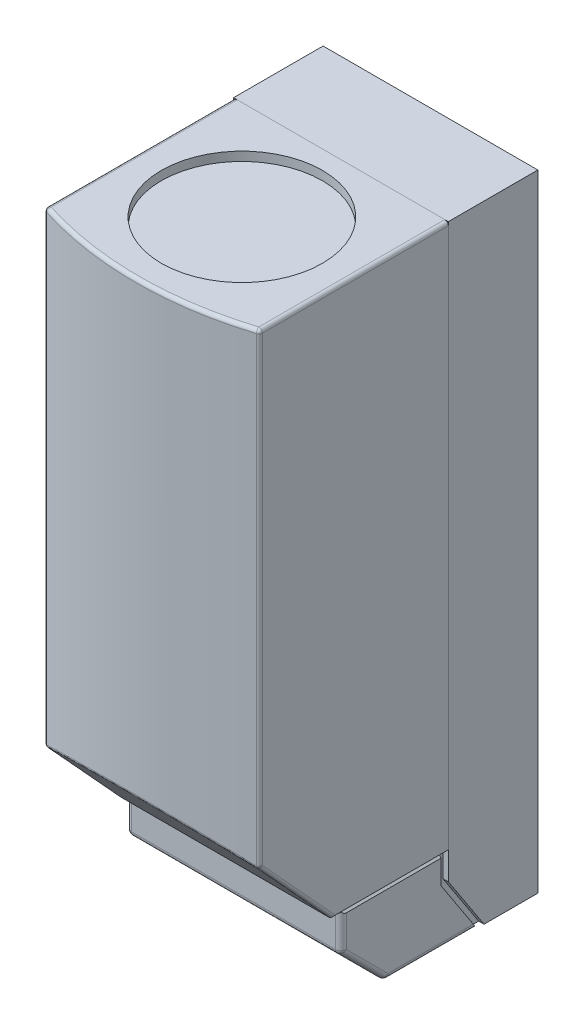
ISO-10303-21;
HEADER;
FILE_DESCRIPTION(('STEP AP214'),'2;1');
FILE_NAME('part.step','',(''),(''),'','','');
FILE_SCHEMA(('AUTOMOTIVE_DESIGN { 1 0 10303 214 1 1 1 1 }'));
ENDSEC;
DATA;
#1=APPLICATION_CONTEXT('core data for automotive mechanical design processes');
#2=APPLICATION_PROTOCOL_DEFINITION('international standard','automotive_design',2000,#1);
#3=PRODUCT_CONTEXT('',#1,'mechanical');
#4=PRODUCT('Part','Part','',(#3));
#5=PRODUCT_RELATED_PRODUCT_CATEGORY('part','',(#4));
#6=PRODUCT_DEFINITION_FORMATION('','',#4);
#7=PRODUCT_DEFINITION_CONTEXT('part definition',#1,'design');
#8=PRODUCT_DEFINITION('design','',#6,#7);
#9=PRODUCT_DEFINITION_SHAPE('','',#8);
#10=(LENGTH_UNIT() NAMED_UNIT(*) SI_UNIT(.MILLI.,.METRE.));
#11=(NAMED_UNIT(*) PLANE_ANGLE_UNIT() SI_UNIT($,.RADIAN.));
#12=(NAMED_UNIT(*) SI_UNIT($,.STERADIAN.) SOLID_ANGLE_UNIT());
#13=UNCERTAINTY_MEASURE_WITH_UNIT(LENGTH_MEASURE(1.E-05),#10,'distance_accuracy_value','');
#14=(GEOMETRIC_REPRESENTATION_CONTEXT(3) GLOBAL_UNCERTAINTY_ASSIGNED_CONTEXT((#13)) GLOBAL_UNIT_ASSIGNED_CONTEXT((#10,
#11,#12)) REPRESENTATION_CONTEXT('',''));
#15=CARTESIAN_POINT('',(0.,0.,0.));
#16=DIRECTION('',(0.,0.,1.));
#17=DIRECTION('',(1.,0.,0.));
#18=AXIS2_PLACEMENT_3D('',#15,#16,#17);
#19=CARTESIAN_POINT('',(-60.,175.,170.));
#20=DIRECTION('',(1.,0.,0.));
#21=DIRECTION('',(0.,0.,-1.));
#22=AXIS2_PLACEMENT_3D('',#19,#20,#21);
#23=PLANE('',#22);
#24=DIRECTION('',(0.,1.,0.));
#25=VECTOR('',#24,1.);
#26=CARTESIAN_POINT('',(-60.,175.,153.911766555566));
#27=LINE('',#26,#25);
#28=CARTESIAN_POINT('',(-60.,-84.5910145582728,153.911766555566));
#29=VERTEX_POINT('',#28);
#30=CARTESIAN_POINT('',(-60.,173.,153.911766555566));
#31=VERTEX_POINT('',#30);
#32=EDGE_CURVE('E191',#29,#31,#27,.T.);
#33=ORIENTED_EDGE('',*,*,#32,.T.);
#34=DIRECTION('',(0.,0.,-1.));
#35=VECTOR('',#34,1.);
#36=CARTESIAN_POINT('',(-60.,173.,170.));
#37=LINE('',#36,#35);
#38=CARTESIAN_POINT('',(-60.,173.,50.));
#39=VERTEX_POINT('',#38);
#40=EDGE_CURVE('E195',#31,#39,#37,.T.);
#41=ORIENTED_EDGE('',*,*,#40,.T.);
#42=DIRECTION('',(0.,-1.,0.));
#43=VECTOR('',#42,1.);
#44=CARTESIAN_POINT('',(-60.,175.,50.));
#45=LINE('',#44,#43);
#46=CARTESIAN_POINT('',(-60.,-129.,50.));
#47=VERTEX_POINT('',#46);
#48=EDGE_CURVE('E174',#39,#47,#45,.T.);
#49=ORIENTED_EDGE('',*,*,#48,.T.);
#50=DIRECTION('',(0.,0.,1.));
#51=VECTOR('',#50,1.);
#52=CARTESIAN_POINT('',(-60.,-129.,170.));
#53=LINE('',#52,#51);
#54=CARTESIAN_POINT('',(-60.,-129.,113.20352990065));
#55=VERTEX_POINT('',#54);
#56=EDGE_CURVE('E166',#47,#55,#53,.T.);
#57=ORIENTED_EDGE('',*,*,#56,.T.);
#58=DIRECTION('',(0.,0.737154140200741,0.675724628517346));
#59=VECTOR('',#58,1.);
#60=CARTESIAN_POINT('',(-60.,-84.6071328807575,153.896991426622));
#61=LINE('',#60,#59);
#62=EDGE_CURVE('E193',#55,#29,#61,.T.);
#63=ORIENTED_EDGE('',*,*,#62,.T.);
#64=EDGE_LOOP('',(#33,#41,#49,#57,#63));
#65=FACE_BOUND('',#64,.T.);
#66=ADVANCED_FACE('F51',(#65),#23,.F.);
#67=CARTESIAN_POINT('',(-60.,-130.,170.));
#68=DIRECTION('',(0.,1.,0.));
#69=DIRECTION('',(0.,0.,1.));
#70=AXIS2_PLACEMENT_3D('',#67,#68,#69);
#71=PLANE('',#70);
#72=DIRECTION('',(0.,0.,1.));
#73=VECTOR('',#72,1.);
#74=CARTESIAN_POINT('',(59.,-130.,170.));
#75=LINE('',#74,#73);
#76=CARTESIAN_POINT('',(59.,-130.,50.));
#77=VERTEX_POINT('',#76);
#78=CARTESIAN_POINT('',(59.,-130.,114.636508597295));
#79=VERTEX_POINT('',#78);
#80=EDGE_CURVE('E159',#77,#79,#75,.T.);
#81=ORIENTED_EDGE('',*,*,#80,.T.);
#82=CARTESIAN_POINT('',(58.,-130.,112.286863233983));
#83=DIRECTION('',(0.,1.,0.));
#84=DIRECTION('',(0.,0.,1.));
#85=AXIS2_PLACEMENT_3D('',#82,#83,#84);
#86=ELLIPSE('',#85,2.71313676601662,2.);
#87=CARTESIAN_POINT('',(58.,-130.,115.));
#88=VERTEX_POINT('',#87);
#89=EDGE_CURVE('E226',#79,#88,#86,.F.);
#90=ORIENTED_EDGE('',*,*,#89,.T.);
#91=DIRECTION('',(-1.,0.,0.));
#92=VECTOR('',#91,1.);
#93=CARTESIAN_POINT('',(-60.,-130.,115.));
#94=LINE('',#93,#92);
#95=CARTESIAN_POINT('',(-58.,-130.,115.));
#96=VERTEX_POINT('',#95);
#97=EDGE_CURVE('E184',#88,#96,#94,.T.);
#98=ORIENTED_EDGE('',*,*,#97,.T.);
#99=CARTESIAN_POINT('',(-58.,-130.,112.286863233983));
#100=DIRECTION('',(0.,1.,0.));
#101=DIRECTION('',(0.,0.,-1.));
#102=AXIS2_PLACEMENT_3D('',#99,#100,#101);
#103=ELLIPSE('',#102,2.71313676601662,2.);
#104=CARTESIAN_POINT('',(-59.,-130.,114.636508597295));
#105=VERTEX_POINT('',#104);
#106=EDGE_CURVE('E155',#96,#105,#103,.F.);
#107=ORIENTED_EDGE('',*,*,#106,.T.);
#108=DIRECTION('',(0.,0.,-1.));
#109=VECTOR('',#108,1.);
#110=CARTESIAN_POINT('',(-59.,-130.,170.));
#111=LINE('',#110,#109);
#112=CARTESIAN_POINT('',(-59.,-130.,50.));
#113=VERTEX_POINT('',#112);
#114=EDGE_CURVE('E146',#105,#113,#111,.T.);
#115=ORIENTED_EDGE('',*,*,#114,.T.);
#116=DIRECTION('',(1.,0.,0.));
#117=VECTOR('',#116,1.);
#118=CARTESIAN_POINT('',(-60.,-130.,50.));
#119=LINE('',#118,#117);
#120=EDGE_CURVE('E151',#113,#77,#119,.T.);
#121=ORIENTED_EDGE('',*,*,#120,.T.);
#122=EDGE_LOOP('',(#81,#90,#98,#107,#115,#121));
#123=FACE_BOUND('',#122,.T.);
#124=ADVANCED_FACE('F149',(#123),#71,.F.);
#125=CARTESIAN_POINT('',(60.,-130.,170.));
#126=DIRECTION('',(-1.,0.,0.));
#127=DIRECTION('',(0.,0.,1.));
#128=AXIS2_PLACEMENT_3D('',#125,#126,#127);
#129=PLANE('',#128);
#130=DIRECTION('',(0.,1.,0.));
#131=VECTOR('',#130,1.);
#132=CARTESIAN_POINT('',(60.,-130.,50.));
#133=LINE('',#132,#131);
#134=CARTESIAN_POINT('',(60.,-129.,50.));
#135=VERTEX_POINT('',#134);
#136=CARTESIAN_POINT('',(60.,173.,50.));
#137=VERTEX_POINT('',#136);
#138=EDGE_CURVE('E173',#135,#137,#133,.T.);
#139=ORIENTED_EDGE('',*,*,#138,.T.);
#140=DIRECTION('',(0.,0.,-1.));
#141=VECTOR('',#140,1.);
#142=CARTESIAN_POINT('',(60.,173.,170.));
#143=LINE('',#142,#141);
#144=CARTESIAN_POINT('',(60.,173.,153.911766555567));
#145=VERTEX_POINT('',#144);
#146=EDGE_CURVE('E212',#137,#145,#143,.F.);
#147=ORIENTED_EDGE('',*,*,#146,.T.);
#148=DIRECTION('',(0.,1.,0.));
#149=VECTOR('',#148,1.);
#150=CARTESIAN_POINT('',(60.,-130.,153.911766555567));
#151=LINE('',#150,#149);
#152=CARTESIAN_POINT('',(60.,-84.5910145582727,153.911766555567));
#153=VERTEX_POINT('',#152);
#154=EDGE_CURVE('E208',#145,#153,#151,.F.);
#155=ORIENTED_EDGE('',*,*,#154,.T.);
#156=DIRECTION('',(0.,-0.737154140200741,-0.675724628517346));
#157=VECTOR('',#156,1.);
#158=CARTESIAN_POINT('',(60.,-127.648550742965,114.442358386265));
#159=LINE('',#158,#157);
#160=CARTESIAN_POINT('',(60.,-129.,113.20352990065));
#161=VERTEX_POINT('',#160);
#162=EDGE_CURVE('E210',#153,#161,#159,.T.);
#163=ORIENTED_EDGE('',*,*,#162,.T.);
#164=DIRECTION('',(0.,0.,-1.));
#165=VECTOR('',#164,1.);
#166=CARTESIAN_POINT('',(60.,-129.,170.));
#167=LINE('',#166,#165);
#168=EDGE_CURVE('E189',#161,#135,#167,.T.);
#169=ORIENTED_EDGE('',*,*,#168,.T.);
#170=EDGE_LOOP('',(#139,#147,#155,#163,#169));
#171=FACE_BOUND('',#170,.T.);
#172=ADVANCED_FACE('F324',(#171),#129,.F.);
#173=CARTESIAN_POINT('',(60.,175.,170.));
#174=DIRECTION('',(0.,-1.,0.));
#175=DIRECTION('',(0.,0.,-1.));
#176=AXIS2_PLACEMENT_3D('',#173,#174,#175);
#177=PLANE('',#176);
#178=CARTESIAN_POINT('',(0.,175.,105.360501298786));
#179=DIRECTION('',(0.,1.,0.));
#180=DIRECTION('',(0.,0.,1.));
#181=AXIS2_PLACEMENT_3D('',#178,#179,#180);
#182=CIRCLE('',#181,45.);
#183=CARTESIAN_POINT('',(0.,175.,150.360501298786));
#184=VERTEX_POINT('',#183);
#185=EDGE_CURVE('E515',#184,#184,#182,.T.);
#186=ORIENTED_EDGE('',*,*,#185,.F.);
#187=EDGE_LOOP('',(#186));
#188=FACE_BOUND('',#187,.T.);
#189=DIRECTION('',(-1.,0.,0.));
#190=VECTOR('',#189,1.);
#191=CARTESIAN_POINT('',(60.,175.,50.));
#192=LINE('',#191,#190);
#193=CARTESIAN_POINT('',(58.,175.,50.));
#194=VERTEX_POINT('',#193);
#195=CARTESIAN_POINT('',(-58.,175.,50.));
#196=VERTEX_POINT('',#195);
#197=EDGE_CURVE('E177',#194,#196,#192,.T.);
#198=ORIENTED_EDGE('',*,*,#197,.T.);
#199=DIRECTION('',(0.,0.,-1.));
#200=VECTOR('',#199,1.);
#201=CARTESIAN_POINT('',(-58.,175.,170.));
#202=LINE('',#201,#200);
#203=CARTESIAN_POINT('',(-58.,175.,153.911766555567));
#204=VERTEX_POINT('',#203);
#205=EDGE_CURVE('E206',#196,#204,#202,.F.);
#206=ORIENTED_EDGE('',*,*,#205,.T.);
#207=CARTESIAN_POINT('',(0.,175.,-29.5733987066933));
#208=DIRECTION('',(0.,-1.,0.));
#209=DIRECTION('',(0.,0.,-1.));
#210=AXIS2_PLACEMENT_3D('',#207,#208,#209);
#211=CIRCLE('',#210,192.433900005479);
#212=CARTESIAN_POINT('',(58.,175.,153.911766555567));
#213=VERTEX_POINT('',#212);
#214=EDGE_CURVE('E202',#204,#213,#211,.F.);
#215=ORIENTED_EDGE('',*,*,#214,.T.);
#216=DIRECTION('',(0.,0.,-1.));
#217=VECTOR('',#216,1.);
#218=CARTESIAN_POINT('',(58.,175.,170.));
#219=LINE('',#218,#217);
#220=EDGE_CURVE('E204',#213,#194,#219,.T.);
#221=ORIENTED_EDGE('',*,*,#220,.T.);
#222=EDGE_LOOP('',(#198,#206,#215,#221));
#223=FACE_BOUND('',#222,.T.);
#224=ADVANCED_FACE('F337',(#188,#223),#177,.F.);
#225=CARTESIAN_POINT('',(0.,0.,50.));
#226=DIRECTION('',(0.,0.,1.));
#227=DIRECTION('',(1.,0.,0.));
#228=AXIS2_PLACEMENT_3D('',#225,#226,#227);
#229=PLANE('',#228);
#230=ORIENTED_EDGE('',*,*,#48,.F.);
#231=CARTESIAN_POINT('',(-58.,173.,50.));
#232=DIRECTION('',(0.,0.,1.));
#233=DIRECTION('',(1.,0.,0.));
#234=AXIS2_PLACEMENT_3D('',#231,#232,#233);
#235=CIRCLE('',#234,2.);
#236=EDGE_CURVE('E200',#39,#196,#235,.F.);
#237=ORIENTED_EDGE('',*,*,#236,.T.);
#238=ORIENTED_EDGE('',*,*,#197,.F.);
#239=CARTESIAN_POINT('',(58.,173.,50.));
#240=DIRECTION('',(0.,0.,1.));
#241=DIRECTION('',(1.,0.,0.));
#242=AXIS2_PLACEMENT_3D('',#239,#240,#241);
#243=CIRCLE('',#242,2.);
#244=EDGE_CURVE('E198',#194,#137,#243,.F.);
#245=ORIENTED_EDGE('',*,*,#244,.T.);
#246=ORIENTED_EDGE('',*,*,#138,.F.);
#247=DIRECTION('',(0.707106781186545,0.70710678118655,0.));
#248=VECTOR('',#247,1.);
#249=CARTESIAN_POINT('',(60.,-129.,50.));
#250=LINE('',#249,#248);
#251=EDGE_CURVE('E158',#135,#77,#250,.F.);
#252=ORIENTED_EDGE('',*,*,#251,.T.);
#253=ORIENTED_EDGE('',*,*,#120,.F.);
#254=DIRECTION('',(0.707106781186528,-0.707106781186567,0.));
#255=VECTOR('',#254,1.);
#256=CARTESIAN_POINT('',(-59.,-130.,50.));
#257=LINE('',#256,#255);
#258=EDGE_CURVE('E163',#113,#47,#257,.F.);
#259=ORIENTED_EDGE('',*,*,#258,.T.);
#260=EDGE_LOOP('',(#230,#237,#238,#245,#246,#252,#253,#259));
#261=FACE_BOUND('',#260,.T.);
#262=ADVANCED_FACE('F170',(#261),#229,.F.);
#263=CARTESIAN_POINT('',(0.,-69.9999999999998,170.));
#264=DIRECTION('',(0.,-0.675724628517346,0.737154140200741));
#265=DIRECTION('',(-1.,0.,0.));
#266=AXIS2_PLACEMENT_3D('',#263,#264,#265);
#267=PLANE('',#266);
#268=ORIENTED_EDGE('',*,*,#97,.F.);
#269=DIRECTION('',(0.,-0.737154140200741,-0.675724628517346));
#270=VECTOR('',#269,1.);
#271=CARTESIAN_POINT('',(58.,-85.9585821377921,155.371299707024));
#272=LINE('',#271,#270);
#273=CARTESIAN_POINT('',(58.,-85.9424638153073,155.386074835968));
#274=VERTEX_POINT('',#273);
#275=EDGE_CURVE('E60',#88,#274,#272,.F.);
#276=ORIENTED_EDGE('',*,*,#275,.T.);
#277=CARTESIAN_POINT('',(2.53410866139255E-13,-286.108098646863,-28.0990904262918));
#278=DIRECTION('',(0.,-0.675724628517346,0.737154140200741));
#279=DIRECTION('',(0.,0.737154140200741,0.675724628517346));
#280=AXIS2_PLACEMENT_3D('',#277,#278,#279);
#281=ELLIPSE('',#280,284.781539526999,192.433900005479);
#282=CARTESIAN_POINT('',(-58.,-85.9424638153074,155.386074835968));
#283=VERTEX_POINT('',#282);
#284=EDGE_CURVE('E72',#274,#283,#281,.T.);
#285=ORIENTED_EDGE('',*,*,#284,.T.);
#286=DIRECTION('',(0.,0.737154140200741,0.675724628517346));
#287=VECTOR('',#286,1.);
#288=CARTESIAN_POINT('',(-58.,-129.,115.916666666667));
#289=LINE('',#288,#287);
#290=EDGE_CURVE('E228',#283,#96,#289,.F.);
#291=ORIENTED_EDGE('',*,*,#290,.T.);
#292=EDGE_LOOP('',(#268,#276,#285,#291));
#293=FACE_BOUND('',#292,.T.);
#294=ADVANCED_FACE('F280',(#293),#267,.T.);
#295=CARTESIAN_POINT('',(1.99099995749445E-13,-138.,-29.5733987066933));
#296=DIRECTION('',(0.,1.,0.));
#297=DIRECTION('',(-1.,0.,0.));
#298=AXIS2_PLACEMENT_3D('',#295,#296,#297);
#299=CYLINDRICAL_SURFACE('',#298,194.433900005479);
#300=CARTESIAN_POINT('',(2.53410866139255E-13,-284.756649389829,-29.5733987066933));
#301=DIRECTION('',(0.,0.679513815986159,-0.733662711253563));
#302=DIRECTION('',(0.,0.733662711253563,0.679513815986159));
#303=AXIS2_PLACEMENT_3D('',#300,#301,#302);
#304=ELLIPSE('',#303,286.136786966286,194.433900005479);
#305=CARTESIAN_POINT('',(-58.6028043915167,-84.5910145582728,155.818760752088));
#306=VERTEX_POINT('',#305);
#307=CARTESIAN_POINT('',(58.6028043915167,-84.5910145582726,155.818760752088));
#308=VERTEX_POINT('',#307);
#309=EDGE_CURVE('E216',#306,#308,#304,.T.);
#310=ORIENTED_EDGE('',*,*,#309,.T.);
#311=DIRECTION('',(0.,1.,0.));
#312=VECTOR('',#311,1.);
#313=CARTESIAN_POINT('',(58.6028043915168,-138.,155.818760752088));
#314=LINE('',#313,#312);
#315=CARTESIAN_POINT('',(58.6028043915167,173.,155.818760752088));
#316=VERTEX_POINT('',#315);
#317=EDGE_CURVE('E221',#308,#316,#314,.T.);
#318=ORIENTED_EDGE('',*,*,#317,.T.);
#319=CARTESIAN_POINT('',(0.,173.,-29.5733987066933));
#320=DIRECTION('',(0.,-1.,0.));
#321=DIRECTION('',(0.,0.,-1.));
#322=AXIS2_PLACEMENT_3D('',#319,#320,#321);
#323=CIRCLE('',#322,194.433900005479);
#324=CARTESIAN_POINT('',(-58.6028043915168,173.,155.818760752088));
#325=VERTEX_POINT('',#324);
#326=EDGE_CURVE('E218',#316,#325,#323,.T.);
#327=ORIENTED_EDGE('',*,*,#326,.T.);
#328=DIRECTION('',(0.,1.,0.));
#329=VECTOR('',#328,1.);
#330=CARTESIAN_POINT('',(-58.6028043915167,-138.,155.818760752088));
#331=LINE('',#330,#329);
#332=EDGE_CURVE('E214',#325,#306,#331,.F.);
#333=ORIENTED_EDGE('',*,*,#332,.T.);
#334=EDGE_LOOP('',(#310,#318,#327,#333));
#335=FACE_BOUND('',#334,.T.);
#336=ADVANCED_FACE('F276',(#335),#299,.T.);
#337=CARTESIAN_POINT('',(-59.,-130.,170.));
#338=DIRECTION('',(0.707106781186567,0.707106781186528,0.));
#339=DIRECTION('',(0.,0.,-1.));
#340=AXIS2_PLACEMENT_3D('',#337,#338,#339);
#341=PLANE('',#340);
#342=ORIENTED_EDGE('',*,*,#114,.F.);
#343=CARTESIAN_POINT('',(-58.,-131.,111.370196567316));
#344=DIRECTION('',(0.707106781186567,0.707106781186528,0.));
#345=DIRECTION('',(0.431889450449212,-0.431889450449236,-0.791797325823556));
#346=AXIS2_PLACEMENT_3D('',#343,#344,#345);
#347=ELLIPSE('',#346,3.83695481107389,2.);
#348=EDGE_CURVE('E12',#105,#55,#347,.F.);
#349=ORIENTED_EDGE('',*,*,#348,.T.);
#350=ORIENTED_EDGE('',*,*,#56,.F.);
#351=ORIENTED_EDGE('',*,*,#258,.F.);
#352=EDGE_LOOP('',(#342,#349,#350,#351));
#353=FACE_BOUND('',#352,.T.);
#354=ADVANCED_FACE('F164',(#353),#341,.F.);
#355=CARTESIAN_POINT('',(60.,-129.,170.));
#356=DIRECTION('',(-0.70710678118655,0.707106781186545,0.));
#357=DIRECTION('',(0.,0.,-1.));
#358=AXIS2_PLACEMENT_3D('',#355,#356,#357);
#359=PLANE('',#358);
#360=ORIENTED_EDGE('',*,*,#168,.F.);
#361=CARTESIAN_POINT('',(58.,-131.,111.370196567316));
#362=DIRECTION('',(-0.70710678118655,0.707106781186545,0.));
#363=DIRECTION('',(0.431889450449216,0.431889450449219,0.791797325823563));
#364=AXIS2_PLACEMENT_3D('',#361,#362,#363);
#365=ELLIPSE('',#364,3.83695481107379,2.);
#366=EDGE_CURVE('E223',#161,#79,#365,.F.);
#367=ORIENTED_EDGE('',*,*,#366,.T.);
#368=ORIENTED_EDGE('',*,*,#80,.F.);
#369=ORIENTED_EDGE('',*,*,#251,.F.);
#370=EDGE_LOOP('',(#360,#367,#368,#369));
#371=FACE_BOUND('',#370,.T.);
#372=ADVANCED_FACE('F288',(#371),#359,.F.);
#373=CARTESIAN_POINT('',(58.,-101.252324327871,138.638899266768));
#374=DIRECTION('',(0.,0.737154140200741,0.675724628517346));
#375=DIRECTION('',(0.,-0.675724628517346,0.737154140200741));
#376=AXIS2_PLACEMENT_3D('',#373,#374,#375);
#377=CYLINDRICAL_SURFACE('',#376,2.);
#378=CARTESIAN_POINT('',(58.,-84.5910145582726,153.911766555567));
#379=DIRECTION('',(0.,0.737154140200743,0.675724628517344));
#380=DIRECTION('',(0.,-0.675724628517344,0.737154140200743));
#381=AXIS2_PLACEMENT_3D('',#378,#379,#380);
#382=CIRCLE('',#381,2.);
#383=EDGE_CURVE('E55',#274,#153,#382,.T.);
#384=ORIENTED_EDGE('',*,*,#383,.F.);
#385=ORIENTED_EDGE('',*,*,#275,.F.);
#386=ORIENTED_EDGE('',*,*,#89,.F.);
#387=ORIENTED_EDGE('',*,*,#366,.F.);
#388=ORIENTED_EDGE('',*,*,#162,.F.);
#389=EDGE_LOOP('',(#384,#385,#386,#387,#388));
#390=FACE_BOUND('',#389,.T.);
#391=ADVANCED_FACE('F53',(#390),#377,.T.);
#392=CARTESIAN_POINT('',(58.,-84.5910145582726,153.911766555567));
#393=DIRECTION('',(0.,0.,1.));
#394=DIRECTION('',(1.,0.,0.));
#395=AXIS2_PLACEMENT_3D('',#392,#393,#394);
#396=SPHERICAL_SURFACE('',#395,2.);
#397=CARTESIAN_POINT('',(58.,-84.5910145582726,153.911766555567));
#398=DIRECTION('',(0.905790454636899,-0.312351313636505,-0.286322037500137));
#399=DIRECTION('',(0.325999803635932,0.945369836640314,0.));
#400=AXIS2_PLACEMENT_3D('',#397,#398,#399);
#401=CIRCLE('',#400,2.);
#402=EDGE_CURVE('E259',#274,#308,#401,.F.);
#403=ORIENTED_EDGE('',*,*,#402,.F.);
#404=ORIENTED_EDGE('',*,*,#383,.T.);
#405=CARTESIAN_POINT('',(58.,-84.5910145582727,153.911766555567));
#406=DIRECTION('',(0.,-1.,0.));
#407=DIRECTION('',(0.,0.,-1.));
#408=AXIS2_PLACEMENT_3D('',#405,#406,#407);
#409=CIRCLE('',#408,2.);
#410=EDGE_CURVE('E262',#308,#153,#409,.F.);
#411=ORIENTED_EDGE('',*,*,#410,.F.);
#412=EDGE_LOOP('',(#403,#404,#411));
#413=FACE_BOUND('',#412,.T.);
#414=ADVANCED_FACE('F363',(#413),#396,.T.);
#415=CARTESIAN_POINT('',(58.,173.,170.));
#416=DIRECTION('',(0.,0.,-1.));
#417=DIRECTION('',(-1.,0.,0.));
#418=AXIS2_PLACEMENT_3D('',#415,#416,#417);
#419=CYLINDRICAL_SURFACE('',#418,2.);
#420=ORIENTED_EDGE('',*,*,#244,.F.);
#421=ORIENTED_EDGE('',*,*,#220,.F.);
#422=CARTESIAN_POINT('',(58.,173.,153.911766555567));
#423=DIRECTION('',(0.,0.,1.));
#424=DIRECTION('',(1.,0.,0.));
#425=AXIS2_PLACEMENT_3D('',#422,#423,#424);
#426=CIRCLE('',#425,2.);
#427=EDGE_CURVE('E256',#145,#213,#426,.T.);
#428=ORIENTED_EDGE('',*,*,#427,.F.);
#429=ORIENTED_EDGE('',*,*,#146,.F.);
#430=EDGE_LOOP('',(#420,#421,#428,#429));
#431=FACE_BOUND('',#430,.T.);
#432=ADVANCED_FACE('F342',(#431),#419,.T.);
#433=CARTESIAN_POINT('',(58.,-138.,153.911766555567));
#434=DIRECTION('',(0.,1.,0.));
#435=DIRECTION('',(-1.,0.,0.));
#436=AXIS2_PLACEMENT_3D('',#433,#434,#435);
#437=CYLINDRICAL_SURFACE('',#436,2.);
#438=ORIENTED_EDGE('',*,*,#410,.T.);
#439=ORIENTED_EDGE('',*,*,#154,.F.);
#440=CARTESIAN_POINT('',(57.9999999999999,173.,153.911766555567));
#441=DIRECTION('',(0.,1.,0.));
#442=DIRECTION('',(0.,0.,1.));
#443=AXIS2_PLACEMENT_3D('',#440,#441,#442);
#444=CIRCLE('',#443,2.);
#445=EDGE_CURVE('E253',#316,#145,#444,.T.);
#446=ORIENTED_EDGE('',*,*,#445,.F.);
#447=ORIENTED_EDGE('',*,*,#317,.F.);
#448=EDGE_LOOP('',(#438,#439,#446,#447));
#449=FACE_BOUND('',#448,.T.);
#450=ADVANCED_FACE('F272',(#449),#437,.T.);
#451=CARTESIAN_POINT('',(1.09763192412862E-13,-74.8287584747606,164.860501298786));
#452=CARTESIAN_POINT('',(1.09902076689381E-13,-75.2040459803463,164.860501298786));
#453=CARTESIAN_POINT('',(1.10077666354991E-13,-75.5538044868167,164.724450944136));
#454=CARTESIAN_POINT('',(1.102532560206E-13,-75.9035629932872,164.588400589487));
#455=CARTESIAN_POINT('',(1.10441662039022E-13,-76.1802077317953,164.334809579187));
#456=CARTESIAN_POINT('',(-2.12809552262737,-74.8287584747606,164.860501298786));
#457=CARTESIAN_POINT('',(-2.12361452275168,-75.2040459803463,164.860501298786));
#458=CARTESIAN_POINT('',(-2.11794932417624,-75.5538044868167,164.724450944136));
#459=CARTESIAN_POINT('',(-2.1122840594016,-75.9035629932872,164.588400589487));
#460=CARTESIAN_POINT('',(-2.10620535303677,-76.1802077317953,164.334809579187));
#461=CARTESIAN_POINT('',(-4.25619104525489,-74.8665004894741,164.825544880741));
#462=CARTESIAN_POINT('',(-4.24726812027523,-75.2418106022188,164.825690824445));
#463=CARTESIAN_POINT('',(-4.23589864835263,-75.5915741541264,164.689732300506));
#464=CARTESIAN_POINT('',(-4.22460698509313,-75.9413404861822,164.553771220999));
#465=CARTESIAN_POINT('',(-4.2124107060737,-76.2179497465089,164.300212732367));
#466=CARTESIAN_POINT('',(-8.5073594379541,-75.0172339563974,164.685936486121));
#467=CARTESIAN_POINT('',(-8.4894950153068,-75.3926288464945,164.68667024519));
#468=CARTESIAN_POINT('',(-8.46680664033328,-75.7424181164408,164.551073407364));
#469=CARTESIAN_POINT('',(-8.44419594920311,-76.0922101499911,164.415474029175));
#470=CARTESIAN_POINT('',(-8.41985042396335,-76.3686832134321,164.162040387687));
#471=CARTESIAN_POINT('',(-10.6304323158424,-75.1302252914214,164.581284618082));
#472=CARTESIAN_POINT('',(-10.6081459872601,-75.5056878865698,164.582455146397));
#473=CARTESIAN_POINT('',(-10.5797653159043,-75.8554922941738,164.44713326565));
#474=CARTESIAN_POINT('',(-10.5515392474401,-76.2053077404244,164.311801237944));
#475=CARTESIAN_POINT('',(-10.5210847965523,-76.4816745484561,164.058464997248));
#476=CARTESIAN_POINT('',(-14.8666577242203,-75.4307641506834,164.302927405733));
#477=CARTESIAN_POINT('',(-14.8354909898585,-75.8063959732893,164.305269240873));
#478=CARTESIAN_POINT('',(-14.7958255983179,-76.1562516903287,164.17066873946));
#479=CARTESIAN_POINT('',(-14.7563147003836,-76.5061184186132,164.036058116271));
#480=CARTESIAN_POINT('',(-14.7137352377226,-76.7822134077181,163.782971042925));
#481=CARTESIAN_POINT('',(-16.9798101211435,-75.6183126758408,164.129221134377));
#482=CARTESIAN_POINT('',(-16.9442611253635,-75.9940569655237,164.13228742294));
#483=CARTESIAN_POINT('',(-16.8989270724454,-76.3439379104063,163.998143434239));
#484=CARTESIAN_POINT('',(-16.853822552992,-76.693843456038,163.863976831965));
#485=CARTESIAN_POINT('',(-16.8051511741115,-76.9697619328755,163.611051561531));
#486=CARTESIAN_POINT('',(-21.1914153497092,-76.0668325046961,163.713804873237));
#487=CARTESIAN_POINT('',(-21.1470866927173,-76.44282981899,163.718617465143));
#488=CARTESIAN_POINT('',(-21.0905242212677,-76.7927874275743,163.58555062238));
#489=CARTESIAN_POINT('',(-21.0341912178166,-77.1427695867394,163.452461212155));
#490=CARTESIAN_POINT('',(-20.9734346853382,-77.4182817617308,163.19990838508));
#491=CARTESIAN_POINT('',(-23.2898680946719,-76.3278042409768,163.472094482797));
#492=CARTESIAN_POINT('',(-23.2412159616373,-76.7039582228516,163.477914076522));
#493=CARTESIAN_POINT('',(-23.1790198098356,-77.0539511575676,163.345482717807));
#494=CARTESIAN_POINT('',(-23.1171254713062,-77.4039872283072,163.213011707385));
#495=CARTESIAN_POINT('',(-23.050302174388,-77.6792534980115,162.960684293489));
#496=CARTESIAN_POINT('',(-27.5086378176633,-76.9274753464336,162.916682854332));
#497=CARTESIAN_POINT('',(-27.4512659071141,-77.3039693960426,162.924833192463));
#498=CARTESIAN_POINT('',(-27.3778032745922,-77.6540641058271,162.793843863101));
#499=CARTESIAN_POINT('',(-27.3046543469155,-78.004203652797,162.662813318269));
#500=CARTESIAN_POINT('',(-27.2256764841,-78.2789246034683,162.410985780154));
#501=CARTESIAN_POINT('',(-29.6285733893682,-77.2676021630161,162.601659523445));
#502=CARTESIAN_POINT('',(-29.5668736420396,-77.644301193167,162.611119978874));
#503=CARTESIAN_POINT('',(-29.4877121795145,-77.9944418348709,162.480959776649));
#504=CARTESIAN_POINT('',(-29.4089374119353,-78.3446519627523,162.35073570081));
#505=CARTESIAN_POINT('',(-29.3238058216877,-78.6190514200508,162.099202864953));
#506=CARTESIAN_POINT('',(-33.8440031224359,-78.0205889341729,161.904247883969));
#507=CARTESIAN_POINT('',(-33.7736748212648,-78.3977153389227,161.916630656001));
#508=CARTESIAN_POINT('',(-33.6832447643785,-78.7479851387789,161.788281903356));
#509=CARTESIAN_POINT('',(-33.5932014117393,-79.0983243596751,161.659869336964));
#510=CARTESIAN_POINT('',(-33.4958744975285,-79.3720381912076,161.408964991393));
#511=CARTESIAN_POINT('',(-35.9394972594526,-78.4334489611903,161.521859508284));
#512=CARTESIAN_POINT('',(-35.8649392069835,-78.8108246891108,161.535829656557));
#513=CARTESIAN_POINT('',(-35.7688684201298,-79.1611507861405,161.408488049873));
#514=CARTESIAN_POINT('',(-35.6732529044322,-79.5115754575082,161.281055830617));
#515=CARTESIAN_POINT('',(-35.5698138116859,-79.784898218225,161.030509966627));
#516=CARTESIAN_POINT('',(-40.1020290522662,-79.3295774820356,160.69187087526));
#517=CARTESIAN_POINT('',(-40.0190599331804,-79.707463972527,160.709311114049));
#518=CARTESIAN_POINT('',(-39.9118414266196,-80.0579441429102,160.584127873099));
#519=CARTESIAN_POINT('',(-39.8050782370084,-80.4085228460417,160.458854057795));
#520=CARTESIAN_POINT('',(-39.6895286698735,-80.6810267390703,160.209058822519));
#521=CARTESIAN_POINT('',(-42.1690660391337,-79.8128476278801,160.244269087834));
#522=CARTESIAN_POINT('',(-42.0819818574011,-80.1910266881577,160.263563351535));
#523=CARTESIAN_POINT('',(-41.9691901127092,-80.5415735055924,160.139560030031));
#524=CARTESIAN_POINT('',(-41.8569173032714,-80.8922519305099,160.015435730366));
#525=CARTESIAN_POINT('',(-41.7353035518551,-81.1642968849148,159.766061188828));
#526=CARTESIAN_POINT('',(-46.2710268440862,-80.847200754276,159.286257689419));
#527=CARTESIAN_POINT('',(-46.1757813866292,-81.2259722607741,159.309546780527));
#528=CARTESIAN_POINT('',(-46.0519801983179,-81.5766974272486,159.188038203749));
#529=CARTESIAN_POINT('',(-45.9286981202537,-81.9275541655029,159.066408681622));
#530=CARTESIAN_POINT('',(-45.795070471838,-82.1986500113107,158.817904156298));
#531=CARTESIAN_POINT('',(-48.3059498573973,-81.3982854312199,158.775846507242));
#532=CARTESIAN_POINT('',(-48.2067192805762,-81.7773915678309,158.801244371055));
#533=CARTESIAN_POINT('',(-48.0774207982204,-82.1281936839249,158.681082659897));
#534=CARTESIAN_POINT('',(-47.9486998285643,-82.4791637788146,158.560766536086));
#535=CARTESIAN_POINT('',(-47.8090617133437,-82.7497346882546,158.312743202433));
#536=CARTESIAN_POINT('',(-52.4136015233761,-82.586635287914,157.675204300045));
#537=CARTESIAN_POINT('',(-52.3063668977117,-82.9664321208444,157.705172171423));
#538=CARTESIAN_POINT('',(-52.1659948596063,-83.3174335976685,157.587886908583));
#539=CARTESIAN_POINT('',(-52.0262429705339,-83.6686154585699,157.470435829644));
#540=CARTESIAN_POINT('',(-51.874460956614,-83.9380845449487,157.223422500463));
#541=CARTESIAN_POINT('',(-54.4850247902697,-83.2263011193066,157.082749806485));
#542=CARTESIAN_POINT('',(-54.3738139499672,-83.6064892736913,157.115156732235));
#543=CARTESIAN_POINT('',(-54.2278313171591,-83.9575797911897,156.999438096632));
#544=CARTESIAN_POINT('',(-54.0825274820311,-84.3088943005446,156.883513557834));
#545=CARTESIAN_POINT('',(-53.9245770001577,-84.5777503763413,156.63706215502));
#546=CARTESIAN_POINT('',(-58.5867178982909,-84.572146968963,155.836235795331));
#547=CARTESIAN_POINT('',(-58.4676666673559,-84.9531154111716,155.873806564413));
#548=CARTESIAN_POINT('',(-58.3106153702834,-85.304439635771,155.761345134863));
#549=CARTESIAN_POINT('',(-58.1542432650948,-85.6559878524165,155.648677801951));
#550=CARTESIAN_POINT('',(-57.984078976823,-85.9235962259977,155.403370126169));
#551=CARTESIAN_POINT('',(-60.6169891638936,-85.2783246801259,155.182178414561));
#552=CARTESIAN_POINT('',(-60.4941292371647,-85.6597269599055,155.222432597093));
#553=CARTESIAN_POINT('',(-60.331564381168,-86.0111509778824,155.111703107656));
#554=CARTESIAN_POINT('',(-60.169731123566,-86.3628451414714,155.000725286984));
#555=CARTESIAN_POINT('',(-59.9934663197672,-86.6297739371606,154.756040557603));
#556=CARTESIAN_POINT('',(-64.6338517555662,-86.753855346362,153.815551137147));
#557=CARTESIAN_POINT('',(-64.5035036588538,-87.1361192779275,153.861444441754));
#558=CARTESIAN_POINT('',(-64.330064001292,-87.4878006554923,153.754293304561));
#559=CARTESIAN_POINT('',(-64.1573555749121,-87.8397521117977,153.646893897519));
#560=CARTESIAN_POINT('',(-63.9690103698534,-88.1053046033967,153.403470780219));
#561=CARTESIAN_POINT('',(-66.6204442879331,-87.5232065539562,153.102982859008));
#562=CARTESIAN_POINT('',(-66.4864657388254,-87.9059453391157,153.15178849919));
#563=CARTESIAN_POINT('',(-66.3076158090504,-88.2577372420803,153.046527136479));
#564=CARTESIAN_POINT('',(-66.1295421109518,-88.6098471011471,152.940973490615));
#565=CARTESIAN_POINT('',(-65.9351682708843,-88.8746558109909,152.698232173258));
#566=CARTESIAN_POINT('',(-70.5480920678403,-89.1217811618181,151.622393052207));
#567=CARTESIAN_POINT('',(-70.4069998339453,-89.5054611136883,151.67728125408));
#568=CARTESIAN_POINT('',(-70.2174767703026,-89.8575329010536,151.57590555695));
#569=CARTESIAN_POINT('',(-70.0287326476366,-90.20992306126,151.474237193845));
#570=CARTESIAN_POINT('',(-69.8224151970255,-90.4732304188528,151.232872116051));
#571=CARTESIAN_POINT('',(-72.4891396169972,-89.9510145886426,150.854362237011));
#572=CARTESIAN_POINT('',(-72.344606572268,-90.3352093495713,150.912375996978));
#573=CARTESIAN_POINT('',(-72.1497782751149,-90.68740200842,150.813040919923));
#574=CARTESIAN_POINT('',(-71.9557711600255,-91.0399625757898,150.713367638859));
#575=CARTESIAN_POINT('',(-71.7434966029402,-91.3024638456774,150.472741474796));
#576=CARTESIAN_POINT('',(-78.4223539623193,-92.6045039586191,148.39671697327));
#577=CARTESIAN_POINT('',(-78.2687999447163,-92.9908962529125,148.464205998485));
#578=CARTESIAN_POINT('',(-78.0564035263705,-93.342934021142,148.371909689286));
#579=CARTESIAN_POINT('',(-77.8475877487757,-93.6965842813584,148.278131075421));
#580=CARTESIAN_POINT('',(-77.6156802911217,-93.9559532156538,148.040376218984));
#581=CARTESIAN_POINT('',(-82.3347658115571,-94.5246477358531,146.618291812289));
#582=CARTESIAN_POINT('',(-82.1747499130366,-94.9124218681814,146.692803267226));
#583=CARTESIAN_POINT('',(-81.9514903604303,-95.2645675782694,146.605410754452));
#584=CARTESIAN_POINT('',(-81.7320981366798,-95.6187897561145,146.516109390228));
#585=CARTESIAN_POINT('',(-81.487848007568,-95.8760969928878,146.280244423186));
#586=CARTESIAN_POINT('',(-89.9411697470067,-98.5828703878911,142.85959136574));
#587=CARTESIAN_POINT('',(-89.7688749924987,-98.9731028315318,142.949298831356));
#588=CARTESIAN_POINT('',(-89.5246676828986,-99.3259713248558,142.871850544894));
#589=CARTESIAN_POINT('',(-89.2843382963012,-99.6809170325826,142.792492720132));
#590=CARTESIAN_POINT('',(-89.0160104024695,-99.9343196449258,142.560206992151));
#591=CARTESIAN_POINT('',(-93.6351117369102,-100.720998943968,140.879270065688));
#592=CARTESIAN_POINT('',(-93.4572231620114,-101.112769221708,140.976725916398));
#593=CARTESIAN_POINT('',(-93.2027084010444,-101.465791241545,140.904743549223));
#594=CARTESIAN_POINT('',(-92.9522399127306,-101.821350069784,140.830429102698));
#595=CARTESIAN_POINT('',(-92.6719554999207,-102.072448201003,140.600255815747));
#596=CARTESIAN_POINT('',(-99.1031066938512,-104.129511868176,137.722326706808));
#597=CARTESIAN_POINT('',(-98.9158158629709,-104.522478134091,137.833225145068));
#598=CARTESIAN_POINT('',(-98.6475472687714,-104.877031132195,137.768804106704));
#599=CARTESIAN_POINT('',(-98.3804063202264,-105.232289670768,137.703734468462));
#600=CARTESIAN_POINT('',(-98.0837051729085,-105.48096112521,137.475785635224));
#601=CARTESIAN_POINT('',(-100.958177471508,-105.33150285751,136.609050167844));
#602=CARTESIAN_POINT('',(-100.768287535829,-105.725250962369,136.724345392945));
#603=CARTESIAN_POINT('',(-100.494833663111,-106.079989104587,136.662923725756));
#604=CARTESIAN_POINT('',(-100.222521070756,-106.435498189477,136.600793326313));
#605=CARTESIAN_POINT('',(-99.9196941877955,-106.682952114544,136.373960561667));
#606=CARTESIAN_POINT('',(-104.605966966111,-107.784181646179,134.337394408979));
#607=CARTESIAN_POINT('',(-104.411131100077,-108.179468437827,134.461687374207));
#608=CARTESIAN_POINT('',(-104.12746288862,-108.534653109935,134.40633572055));
#609=CARTESIAN_POINT('',(-103.844934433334,-108.890608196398,134.350275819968));
#610=CARTESIAN_POINT('',(-103.529961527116,-109.135630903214,134.125671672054));
#611=CARTESIAN_POINT('',(-106.398703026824,-109.03485569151,133.179027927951));
#612=CARTESIAN_POINT('',(-106.201533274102,-109.430964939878,133.307861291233));
#613=CARTESIAN_POINT('',(-105.912822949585,-109.786345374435,133.255640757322));
#614=CARTESIAN_POINT('',(-105.625263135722,-110.142561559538,133.202651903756));
#615=CARTESIAN_POINT('',(-105.304257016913,-110.386304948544,132.979220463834));
#616=CARTESIAN_POINT('',(-109.922601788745,-111.581811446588,130.820053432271));
#617=CARTESIAN_POINT('',(-109.721020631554,-111.979540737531,130.958155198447));
#618=CARTESIAN_POINT('',(-109.422375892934,-112.335387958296,130.91226258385));
#619=CARTESIAN_POINT('',(-109.124882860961,-112.692071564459,130.865601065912));
#620=CARTESIAN_POINT('',(-108.791907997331,-112.933260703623,130.644511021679));
#621=CARTESIAN_POINT('',(-111.653756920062,-112.878098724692,129.619440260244));
#622=CARTESIAN_POINT('',(-111.450104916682,-113.27668948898,129.762211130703));
#623=CARTESIAN_POINT('',(-111.146561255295,-113.63274385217,129.719574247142));
#624=CARTESIAN_POINT('',(-110.844172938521,-113.98969769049,129.676110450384));
#625=CARTESIAN_POINT('',(-110.505255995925,-114.229547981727,129.456247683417));
#626=CARTESIAN_POINT('',(-115.054686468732,-115.512919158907,127.179086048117));
#627=CARTESIAN_POINT('',(-114.847156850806,-115.913210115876,127.331363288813));
#628=CARTESIAN_POINT('',(-114.533957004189,-116.269750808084,127.295299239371));
#629=CARTESIAN_POINT('',(-114.221914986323,-116.627192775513,127.258406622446));
#630=CARTESIAN_POINT('',(-113.871202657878,-116.864368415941,127.04099561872));
#631=CARTESIAN_POINT('',(-116.724455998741,-116.851455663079,125.939341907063));
#632=CARTESIAN_POINT('',(-116.515121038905,-117.252647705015,126.096398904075));
#633=CARTESIAN_POINT('',(-116.197162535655,-117.609405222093,126.06370948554));
#634=CARTESIAN_POINT('',(-115.880363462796,-117.967127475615,126.030133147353));
#635=CARTESIAN_POINT('',(-115.523796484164,-118.202904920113,125.814003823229));
#636=CARTESIAN_POINT('',(-121.816698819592,-121.070239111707,122.031931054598));
#637=CARTESIAN_POINT('',(-121.604157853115,-121.475845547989,122.202549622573));
#638=CARTESIAN_POINT('',(-121.269642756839,-121.83173647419,122.181951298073));
#639=CARTESIAN_POINT('',(-120.940259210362,-122.191899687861,122.157425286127));
#640=CARTESIAN_POINT('',(-120.56365910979,-122.421688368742,121.946785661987));
#641=CARTESIAN_POINT('',(-125.134835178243,-124.018048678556,119.301688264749));
#642=CARTESIAN_POINT('',(-124.919327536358,-124.425892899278,119.482490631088));
#643=CARTESIAN_POINT('',(-124.575273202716,-124.782059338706,119.46956502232));
#644=CARTESIAN_POINT('',(-124.236287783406,-125.143056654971,119.452198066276));
#645=CARTESIAN_POINT('',(-123.84766421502,-125.369497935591,119.244626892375));
#646=CARTESIAN_POINT('',(-131.50655341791,-130.061270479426,113.704494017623));
#647=CARTESIAN_POINT('',(-131.286345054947,-130.473207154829,113.906459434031));
#648=CARTESIAN_POINT('',(-130.923742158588,-130.830516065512,113.908816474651));
#649=CARTESIAN_POINT('',(-130.566224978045,-131.192668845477,113.906720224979));
#650=CARTESIAN_POINT('',(-130.153841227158,-131.412719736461,113.705006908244));
#651=CARTESIAN_POINT('',(-134.560126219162,-133.156687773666,110.837537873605));
#652=CARTESIAN_POINT('',(-134.338075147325,-133.571012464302,111.049990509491));
#653=CARTESIAN_POINT('',(-133.966571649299,-133.928654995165,111.060449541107));
#654=CARTESIAN_POINT('',(-133.600015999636,-134.291662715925,111.065975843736));
#655=CARTESIAN_POINT('',(-133.176004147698,-134.508137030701,110.867541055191));
#656=CARTESIAN_POINT('',(-140.556657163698,-139.63107829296,104.840997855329));
#657=CARTESIAN_POINT('',(-140.332390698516,-140.050213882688,105.075358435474));
#658=CARTESIAN_POINT('',(-139.942841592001,-140.408835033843,105.10260321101));
#659=CARTESIAN_POINT('',(-139.558753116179,-140.773377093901,105.124404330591));
#660=CARTESIAN_POINT('',(-139.110853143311,-140.982527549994,104.932683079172));
#661=CARTESIAN_POINT('',(-143.486528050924,-143.016495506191,101.705445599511));
#662=CARTESIAN_POINT('',(-143.261510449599,-143.438328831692,101.950989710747));
#663=CARTESIAN_POINT('',(-142.863282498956,-143.797330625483,101.987184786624));
#664=CARTESIAN_POINT('',(-142.470294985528,-144.162820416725,102.017414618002));
#665=CARTESIAN_POINT('',(-142.010586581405,-144.367944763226,101.829383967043));
#666=CARTESIAN_POINT('',(-149.073133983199,-149.904899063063,95.325449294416));
#667=CARTESIAN_POINT('',(-148.848056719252,-150.331754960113,95.5939434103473));
#668=CARTESIAN_POINT('',(-148.432867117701,-150.692116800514,95.6479279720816));
#669=CARTESIAN_POINT('',(-148.022931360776,-151.058981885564,95.6959332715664));
#670=CARTESIAN_POINT('',(-147.539727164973,-151.256348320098,95.5150140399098));
#671=CARTESIAN_POINT('',(-151.729862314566,-153.407888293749,92.0810025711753));
#672=CARTESIAN_POINT('',(-151.505222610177,-153.837609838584,92.3607639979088));
#673=CARTESIAN_POINT('',(-151.082004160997,-154.198410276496,92.4240869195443));
#674=CARTESIAN_POINT('',(-150.663766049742,-154.566244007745,92.4809429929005));
#675=CARTESIAN_POINT('',(-150.169127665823,-154.759337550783,92.3039405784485));
#676=CARTESIAN_POINT('',(-156.890288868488,-160.669003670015,85.3558029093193));
#677=CARTESIAN_POINT('',(-156.668255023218,-161.104556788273,85.6587543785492));
#678=CARTESIAN_POINT('',(-156.22873578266,-161.466512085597,85.7413403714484));
#679=CARTESIAN_POINT('',(-155.794653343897,-161.836144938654,85.8168671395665));
#680=CARTESIAN_POINT('',(-155.27647266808,-162.02045292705,85.6479181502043));
#681=CARTESIAN_POINT('',(-159.382188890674,-164.431584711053,81.870923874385));
#682=CARTESIAN_POINT('',(-159.161830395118,-164.870337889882,82.1855876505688));
#683=CARTESIAN_POINT('',(-158.71461187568,-165.232785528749,82.2783236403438));
#684=CARTESIAN_POINT('',(-158.272471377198,-165.603476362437,82.3634800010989));
#685=CARTESIAN_POINT('',(-157.742740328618,-165.783033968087,82.198885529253));
#686=CARTESIAN_POINT('',(-164.088918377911,-172.047665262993,74.8169576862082));
#687=CARTESIAN_POINT('',(-163.873513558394,-172.492476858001,75.1554055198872));
#688=CARTESIAN_POINT('',(-163.411169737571,-172.856505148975,75.2683033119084));
#689=CARTESIAN_POINT('',(-162.953916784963,-173.228796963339,75.3736027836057));
#690=CARTESIAN_POINT('',(-162.401055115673,-173.399114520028,75.2174783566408));
#691=CARTESIAN_POINT('',(-166.303743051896,-175.901166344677,71.2478690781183));
#692=CARTESIAN_POINT('',(-166.09123002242,-176.349374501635,71.597891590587));
#693=CARTESIAN_POINT('',(-165.621846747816,-176.713952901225,71.721298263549));
#694=CARTESIAN_POINT('',(-165.157154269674,-177.087326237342,71.8366176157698));
#695=CARTESIAN_POINT('',(-164.593097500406,-177.252615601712,71.6851023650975));
#696=CARTESIAN_POINT('',(-170.54094213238,-183.825042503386,63.9088245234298));
#697=CARTESIAN_POINT('',(-170.336117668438,-184.280187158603,64.2823483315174));
#698=CARTESIAN_POINT('',(-169.852447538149,-184.646132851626,64.4273184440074));
#699=CARTESIAN_POINT('',(-169.373825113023,-185.0215428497,64.5635857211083));
#700=CARTESIAN_POINT('',(-168.786711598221,-185.176491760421,64.421549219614));
#701=CARTESIAN_POINT('',(-172.553454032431,-187.898219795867,60.1362731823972));
#702=CARTESIAN_POINT('',(-172.352848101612,-188.357122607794,60.5215197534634));
#703=CARTESIAN_POINT('',(-171.862575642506,-188.723676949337,60.6777518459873));
#704=CARTESIAN_POINT('',(-171.376866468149,-189.100253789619,60.8247673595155));
#705=CARTESIAN_POINT('',(-170.778522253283,-189.249669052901,60.6878033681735));
#706=CARTESIAN_POINT('',(-176.300197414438,-196.111987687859,52.5287327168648));
#707=CARTESIAN_POINT('',(-176.109748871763,-196.578113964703,52.9375529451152));
#708=CARTESIAN_POINT('',(-175.606434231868,-196.946473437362,53.1161594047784));
#709=CARTESIAN_POINT('',(-175.107694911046,-197.32488191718,53.2855249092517));
#710=CARTESIAN_POINT('',(-174.486725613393,-197.463436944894,53.1585161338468));
#711=CARTESIAN_POINT('',(-178.03442559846,-200.252579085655,48.6937428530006));
#712=CARTESIAN_POINT('',(-177.849406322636,-200.722700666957,49.1139240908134));
#713=CARTESIAN_POINT('',(-177.340161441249,-201.091726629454,49.3041328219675));
#714=CARTESIAN_POINT('',(-176.834971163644,-201.471330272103,49.4846139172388));
#715=CARTESIAN_POINT('',(-176.203115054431,-201.604028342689,49.3629740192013));
#716=CARTESIAN_POINT('',(-181.276764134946,-208.704049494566,40.8660438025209));
#717=CARTESIAN_POINT('',(-181.10459651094,-209.182318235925,41.3089903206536));
#718=CARTESIAN_POINT('',(-180.583330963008,-209.552964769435,41.5228566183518));
#719=CARTESIAN_POINT('',(-180.066357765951,-209.934810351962,41.7264238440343));
#720=CARTESIAN_POINT('',(-179.412102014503,-210.0554987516,41.6157928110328));
#721=CARTESIAN_POINT('',(-182.777301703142,-213.016472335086,36.8719047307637));
#722=CARTESIAN_POINT('',(-182.611907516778,-213.499127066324,37.3260320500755));
#723=CARTESIAN_POINT('',(-182.085251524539,-213.870502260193,37.5521732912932));
#724=CARTESIAN_POINT('',(-181.562285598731,-214.253622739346,37.7675124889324));
#725=CARTESIAN_POINT('',(-180.897204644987,-214.367921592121,37.6627385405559));
#726=CARTESIAN_POINT('',(-185.500184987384,-221.68771557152,28.8406534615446));
#727=CARTESIAN_POINT('',(-185.350135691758,-222.178915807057,29.3170303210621));
#728=CARTESIAN_POINT('',(-184.812762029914,-222.552324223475,29.5675721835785));
#729=CARTESIAN_POINT('',(-184.279088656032,-222.93751127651,29.8072813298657));
#730=CARTESIAN_POINT('',(-183.592079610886,-223.039164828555,29.714098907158));
#731=CARTESIAN_POINT('',(-186.722528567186,-226.046536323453,24.8035409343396));
#732=CARTESIAN_POINT('',(-186.580423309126,-226.542413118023,25.2905081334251));
#733=CARTESIAN_POINT('',(-186.038349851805,-226.9166090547,25.5536540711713));
#734=CARTESIAN_POINT('',(-185.499337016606,-227.30310526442,25.8054868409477));
#735=CARTESIAN_POINT('',(-184.801849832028,-227.397985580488,25.718513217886));
#736=CARTESIAN_POINT('',(-188.915112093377,-234.881442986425,16.6207056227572));
#737=CARTESIAN_POINT('',(-188.790894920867,-235.386812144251,17.1285990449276));
#738=CARTESIAN_POINT('',(-188.239301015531,-235.762923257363,17.4172618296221));
#739=CARTESIAN_POINT('',(-187.690890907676,-236.151832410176,17.6941536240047));
#740=CARTESIAN_POINT('',(-186.971879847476,-236.23289224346,17.6198487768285));
#741=CARTESIAN_POINT('',(-189.880243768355,-239.35820261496,12.4743588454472));
#742=CARTESIAN_POINT('',(-189.765250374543,-239.868669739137,12.9923187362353));
#743=CARTESIAN_POINT('',(-189.209589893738,-240.245633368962,13.2941567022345));
#744=CARTESIAN_POINT('',(-188.656396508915,-240.63592359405,13.5837367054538));
#745=CARTESIAN_POINT('',(-187.927083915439,-240.709651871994,13.5161524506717));
#746=CARTESIAN_POINT('',(-191.532798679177,-248.338865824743,4.1565247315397));
#747=CARTESIAN_POINT('',(-191.438087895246,-248.859389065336,4.69425316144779));
#748=CARTESIAN_POINT('',(-190.874268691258,-249.238616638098,5.02230233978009));
#749=CARTESIAN_POINT('',(-190.312923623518,-249.631211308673,5.33805630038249));
#750=CARTESIAN_POINT('',(-189.562640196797,-249.690315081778,5.28387784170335));
#751=CARTESIAN_POINT('',(-192.220220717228,-252.842769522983,-0.0149627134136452));
#752=CARTESIAN_POINT('',(-192.135825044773,-253.368748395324,0.532006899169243));
#753=CARTESIAN_POINT('',(-191.568657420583,-253.748889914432,0.873552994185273));
#754=CARTESIAN_POINT('',(-191.003203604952,-254.142905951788,1.20233621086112));
#755=CARTESIAN_POINT('',(-190.242991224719,-254.194218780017,1.15529945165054));
#756=CARTESIAN_POINT('',(-193.325888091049,-261.91039734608,-8.41334290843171));
#757=CARTESIAN_POINT('',(-193.264054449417,-262.447384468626,-7.84842032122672));
#758=CARTESIAN_POINT('',(-192.690081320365,-262.829773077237,-7.47976149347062));
#759=CARTESIAN_POINT('',(-192.117858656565,-263.226339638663,-7.12414466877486));
#760=CARTESIAN_POINT('',(-191.337285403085,-263.261846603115,-7.15669271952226));
#761=CARTESIAN_POINT('',(-193.741565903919,-266.474287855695,-12.6403897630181));
#762=CARTESIAN_POINT('',(-193.691173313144,-267.017183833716,-12.0670915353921));
#763=CARTESIAN_POINT('',(-193.114565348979,-267.400553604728,-11.6844865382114));
#764=CARTESIAN_POINT('',(-192.538877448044,-267.79860277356,-11.3153858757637));
#765=CARTESIAN_POINT('',(-191.748687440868,-267.82573711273,-11.3402590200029));
#766=CARTESIAN_POINT('',(-194.295572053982,-275.611002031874,-21.1027573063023));
#767=CARTESIAN_POINT('',(-194.26988653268,-276.165688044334,-20.5133409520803));
#768=CARTESIAN_POINT('',(-193.687904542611,-276.55155321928,-20.1029630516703));
#769=CARTESIAN_POINT('',(-193.106844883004,-276.952145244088,-19.7061331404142));
#770=CARTESIAN_POINT('',(-192.296994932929,-276.962451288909,-19.7155803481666));
#771=CARTESIAN_POINT('',(-194.433900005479,-280.183825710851,-25.3380780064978));
#772=CARTESIAN_POINT('',(-194.420619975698,-280.744859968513,-24.7413525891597));
#773=CARTESIAN_POINT('',(-193.836759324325,-281.131772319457,-24.3167145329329));
#774=CARTESIAN_POINT('',(-193.252936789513,-281.533892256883,-23.9060679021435));
#775=CARTESIAN_POINT('',(-192.433900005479,-281.535274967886,-23.9073353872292));
#776=CARTESIAN_POINT('',(-194.433900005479,-289.329473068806,-33.8087194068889));
#777=CARTESIAN_POINT('',(-194.447224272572,-289.903244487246,-33.1981497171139));
#778=CARTESIAN_POINT('',(-193.859467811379,-290.292764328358,-32.7450961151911));
#779=CARTESIAN_POINT('',(-193.271748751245,-290.697542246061,-32.306080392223));
#780=CARTESIAN_POINT('',(-192.433900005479,-290.680922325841,-32.2908454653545));
#781=CARTESIAN_POINT('',(-194.295572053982,-293.902296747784,-38.0440401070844));
#782=CARTESIAN_POINT('',(-194.322179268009,-294.482901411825,-37.4273479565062));
#783=CARTESIAN_POINT('',(-193.733321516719,-294.873537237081,-36.9597262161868));
#784=CARTESIAN_POINT('',(-193.143557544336,-295.279890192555,-36.5065660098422));
#785=CARTESIAN_POINT('',(-192.29699493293,-295.253746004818,-36.4826005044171));
#786=CARTESIAN_POINT('',(-193.741565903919,-303.039010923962,-46.5064076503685));
#787=CARTESIAN_POINT('',(-193.796493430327,-303.633398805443,-45.8783928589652));
#788=CARTESIAN_POINT('',(-193.205261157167,-304.026759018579,-45.3817239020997));
#789=CARTESIAN_POINT('',(-192.613118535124,-304.435889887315,-44.899565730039));
#790=CARTESIAN_POINT('',(-191.748687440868,-304.390460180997,-44.8579218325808));
#791=CARTESIAN_POINT('',(-193.325888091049,-307.602901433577,-50.733454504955));
#792=CARTESIAN_POINT('',(-193.394875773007,-308.204658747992,-50.1006296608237));
#793=CARTESIAN_POINT('',(-192.80334747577,-308.599207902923,-49.5890914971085));
#794=CARTESIAN_POINT('',(-192.209898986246,-309.009961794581,-49.0924649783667));
#795=CARTESIAN_POINT('',(-191.337285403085,-308.954350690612,-49.0414881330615));
#796=CARTESIAN_POINT('',(-192.220220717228,-316.670529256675,-59.131834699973));
#797=CARTESIAN_POINT('',(-192.318914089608,-317.287011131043,-58.4903734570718));
#798=CARTESIAN_POINT('',(-191.726574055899,-317.68454255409,-57.9494424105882));
#799=CARTESIAN_POINT('',(-191.132341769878,-318.09803696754,-57.4232005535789));
#800=CARTESIAN_POINT('',(-190.242991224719,-318.02197851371,-57.3534803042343));
#801=CARTESIAN_POINT('',(-191.532798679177,-321.174432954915,-63.3033221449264));
#802=CARTESIAN_POINT('',(-191.646082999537,-321.798798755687,-62.6585177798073));
#803=CARTESIAN_POINT('',(-191.054268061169,-322.197588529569,-62.1025692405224));
#804=CARTESIAN_POINT('',(-190.459507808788,-322.612735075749,-61.561673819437));
#805=CARTESIAN_POINT('',(-189.562640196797,-322.525882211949,-61.4820586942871));
#806=CARTESIAN_POINT('',(-189.880243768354,-330.155096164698,-71.6211562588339));
#807=CARTESIAN_POINT('',(-190.024311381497,-330.795530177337,-70.9708991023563));
#808=CARTESIAN_POINT('',(-189.433322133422,-331.19726567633,-70.384961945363));
#809=CARTESIAN_POINT('',(-188.83937567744,-331.615415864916,-69.8141312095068));
#810=CARTESIAN_POINT('',(-187.927083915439,-331.506545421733,-69.7143333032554));
#811=CARTESIAN_POINT('',(-188.915112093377,-334.631855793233,-75.7675030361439));
#812=CARTESIAN_POINT('',(-189.074282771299,-335.280820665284,-75.1154596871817));
#813=CARTESIAN_POINT('',(-188.484683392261,-335.683896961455,-74.5142279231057));
#814=CARTESIAN_POINT('',(-187.890995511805,-336.103745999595,-73.9284338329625));
#815=CARTESIAN_POINT('',(-186.971879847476,-335.983305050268,-73.8180296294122));
#816=CARTESIAN_POINT('',(-186.722528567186,-343.466762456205,-83.9503383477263));
#817=CARTESIAN_POINT('',(-186.913207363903,-344.132739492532,-83.2958797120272));
#818=CARTESIAN_POINT('',(-186.32603403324,-344.539167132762,-82.6646404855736));
#819=CARTESIAN_POINT('',(-185.734905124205,-344.961820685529,-82.0483356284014));
#820=CARTESIAN_POINT('',(-184.801849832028,-344.818211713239,-81.9166940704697));
#821=CARTESIAN_POINT('',(-185.500184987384,-347.825583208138,-87.9874508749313));
#822=CARTESIAN_POINT('',(-185.706051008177,-348.500628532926,-87.3328903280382));
#823=CARTESIAN_POINT('',(-185.121108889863,-348.908465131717,-86.6863850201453));
#824=CARTESIAN_POINT('',(-184.531060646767,-349.332824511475,-86.0550891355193));
#825=CARTESIAN_POINT('',(-183.592079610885,-349.177032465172,-85.9122797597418));
#826=CARTESIAN_POINT('',(-182.777301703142,-356.496826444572,-96.0187021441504));
#827=CARTESIAN_POINT('',(-183.014875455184,-357.190536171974,-95.3655006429));
#828=CARTESIAN_POINT('',(-182.434141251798,-357.601524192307,-94.6884531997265));
#829=CARTESIAN_POINT('',(-181.848280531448,-358.029094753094,-94.0266701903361));
#830=CARTESIAN_POINT('',(-180.897204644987,-357.848275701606,-93.8609193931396));
#831=CARTESIAN_POINT('',(-181.276764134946,-360.809249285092,-100.012841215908));
#832=CARTESIAN_POINT('',(-181.529671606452,-361.512794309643,-99.361325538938));
#833=CARTESIAN_POINT('',(-180.952100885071,-361.925285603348,-98.6687771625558));
#834=CARTESIAN_POINT('',(-180.368167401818,-362.354601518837,-97.9917180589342));
#835=CARTESIAN_POINT('',(-179.412102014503,-362.160698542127,-97.8139736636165));
#836=CARTESIAN_POINT('',(-178.03442559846,-369.260719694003,-107.840540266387));
#837=CARTESIAN_POINT('',(-178.318927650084,-369.983888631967,-107.193688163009));
#838=CARTESIAN_POINT('',(-177.747153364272,-370.400067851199,-106.470925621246));
#839=CARTESIAN_POINT('',(-177.169331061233,-370.832240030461,-105.762886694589));
#840=CARTESIAN_POINT('',(-176.203115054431,-370.612168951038,-105.561154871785));
#841=CARTESIAN_POINT('',(-176.300197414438,-373.401311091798,-111.675530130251));
#842=CARTESIAN_POINT('',(-176.599571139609,-374.134861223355,-111.032177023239));
#843=CARTESIAN_POINT('',(-176.031794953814,-374.552607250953,-110.294134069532));
#844=CARTESIAN_POINT('',(-175.456749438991,-374.986505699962,-109.570963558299));
#845=CARTESIAN_POINT('',(-174.486725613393,-374.752760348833,-109.35669698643));
#846=CARTESIAN_POINT('',(-172.553454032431,-381.615078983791,-119.283070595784));
#847=CARTESIAN_POINT('',(-172.883476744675,-382.370188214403,-118.648611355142));
#848=CARTESIAN_POINT('',(-172.323447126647,-382.791263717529,-117.879928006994));
#849=CARTESIAN_POINT('',(-171.756119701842,-383.228549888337,-117.126170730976));
#850=CARTESIAN_POINT('',(-170.778522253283,-382.966528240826,-116.885984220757));
#851=CARTESIAN_POINT('',(-170.54094213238,-385.688256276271,-123.055621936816));
#852=CARTESIAN_POINT('',(-170.88548988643,-386.454631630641,-122.426643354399));
#853=CARTESIAN_POINT('',(-170.330461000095,-386.87738157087,-121.642514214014));
#854=CARTESIAN_POINT('',(-169.766830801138,-387.31641822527,-120.873383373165));
#855=CARTESIAN_POINT('',(-168.786711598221,-387.039705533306,-120.619730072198));
#856=CARTESIAN_POINT('',(-166.303743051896,-393.612132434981,-130.394666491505));
#857=CARTESIAN_POINT('',(-166.677773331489,-394.401047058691,-129.778030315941));
#858=CARTESIAN_POINT('',(-166.132021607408,-394.827754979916,-128.963945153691));
#859=CARTESIAN_POINT('',(-165.578228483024,-395.269691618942,-128.163883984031));
#860=CARTESIAN_POINT('',(-164.593097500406,-394.963581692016,-127.883283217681));
#861=CARTESIAN_POINT('',(-164.088918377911,-397.465633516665,-133.963755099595));
#862=CARTESIAN_POINT('',(-164.476370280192,-398.266339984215,-133.354422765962));
#863=CARTESIAN_POINT('',(-163.936417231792,-398.694775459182,-132.525316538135));
#864=CARTESIAN_POINT('',(-163.387180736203,-399.138414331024,-131.710213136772));
#865=CARTESIAN_POINT('',(-162.401055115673,-398.817082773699,-131.415659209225));
#866=CARTESIAN_POINT('',(-159.382188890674,-405.081714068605,-141.017721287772));
#867=CARTESIAN_POINT('',(-159.796748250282,-405.907093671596,-140.425194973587));
#868=CARTESIAN_POINT('',(-159.268200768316,-406.338991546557,-139.56588850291));
#869=CARTESIAN_POINT('',(-158.730335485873,-406.786145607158,-138.720633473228));
#870=CARTESIAN_POINT('',(-157.742740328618,-406.43316332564,-138.397066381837));
#871=CARTESIAN_POINT('',(-156.890288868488,-408.844295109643,-144.502600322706));
#872=CARTESIAN_POINT('',(-157.317275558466,-409.68244331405,-143.919476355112));
#873=CARTESIAN_POINT('',(-156.795593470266,-410.11618870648,-143.045090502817));
#874=CARTESIAN_POINT('',(-156.263293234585,-410.565043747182,-142.184623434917));
#875=CARTESIAN_POINT('',(-155.27647266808,-410.195744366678,-141.846099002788));
#876=CARTESIAN_POINT('',(-151.729862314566,-416.105410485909,-151.227799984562));
#877=CARTESIAN_POINT('',(-152.181481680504,-416.969204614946,-150.664885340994));
#878=CARTESIAN_POINT('',(-151.672642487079,-417.407070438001,-149.761340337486));
#879=CARTESIAN_POINT('',(-151.154020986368,-417.858860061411,-148.870621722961));
#880=CARTESIAN_POINT('',(-150.169127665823,-417.456859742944,-148.502121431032));
#881=CARTESIAN_POINT('',(-149.073133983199,-419.608399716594,-154.472246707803));
#882=CARTESIAN_POINT('',(-149.535353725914,-420.485415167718,-153.920411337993));
#883=CARTESIAN_POINT('',(-149.034109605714,-420.925161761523,-153.002423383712));
#884=CARTESIAN_POINT('',(-148.521903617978,-421.378573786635,-152.097025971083));
#885=CARTESIAN_POINT('',(-147.539727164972,-420.959848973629,-151.713194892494));
#886=CARTESIAN_POINT('',(-143.486528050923,-426.496803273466,-160.852243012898));
#887=CARTESIAN_POINT('',(-143.969304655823,-427.401621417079,-160.324970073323));
#888=CARTESIAN_POINT('',(-143.483193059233,-427.844893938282,-159.377862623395));
#889=CARTESIAN_POINT('',(-142.986084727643,-428.301874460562,-158.443384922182));
#890=CARTESIAN_POINT('',(-142.010586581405,-427.848252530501,-158.027564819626));
#891=CARTESIAN_POINT('',(-140.556657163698,-429.882220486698,-163.987795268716));
#892=CARTESIAN_POINT('',(-141.048223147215,-430.801257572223,-163.473674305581));
#893=CARTESIAN_POINT('',(-140.570816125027,-431.246537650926,-162.512221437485));
#894=CARTESIAN_POINT('',(-140.081231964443,-431.705102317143,-161.563010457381));
#895=CARTESIAN_POINT('',(-139.110853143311,-431.233669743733,-161.130863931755));
#896=CARTESIAN_POINT('',(-134.560126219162,-436.356611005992,-169.984335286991));
#897=CARTESIAN_POINT('',(-135.068192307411,-437.304312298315,-169.497837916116));
#898=CARTESIAN_POINT('',(-134.607246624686,-437.753720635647,-168.508657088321));
#899=CARTESIAN_POINT('',(-134.13520856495,-438.215234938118,-167.530632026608));
#900=CARTESIAN_POINT('',(-133.176004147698,-437.708060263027,-167.065721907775));
#901=CARTESIAN_POINT('',(-131.50655341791,-439.452028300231,-172.85129143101));
#902=CARTESIAN_POINT('',(-132.020806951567,-440.414237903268,-172.379275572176));
#903=CARTESIAN_POINT('',(-131.569198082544,-440.865651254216,-171.376596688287));
#904=CARTESIAN_POINT('',(-131.105503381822,-441.328644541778,-170.384590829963));
#905=CARTESIAN_POINT('',(-130.153841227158,-440.803477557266,-169.903187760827));
#906=CARTESIAN_POINT('',(-125.134835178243,-445.495250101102,-178.448485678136));
#907=CARTESIAN_POINT('',(-125.659627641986,-446.487990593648,-178.007830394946));
#908=CARTESIAN_POINT('',(-125.226867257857,-446.942894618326,-176.977877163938));
#909=CARTESIAN_POINT('',(-124.782000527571,-447.409399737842,-175.958616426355));
#910=CARTESIAN_POINT('',(-123.84766421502,-446.846699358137,-175.442807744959));
#911=CARTESIAN_POINT('',(-121.816698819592,-448.443059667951,-181.178728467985));
#912=CARTESIAN_POINT('',(-122.344910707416,-449.451179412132,-180.754360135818));
#913=CARTESIAN_POINT('',(-121.922594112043,-449.908212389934,-179.711222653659));
#914=CARTESIAN_POINT('',(-121.487288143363,-450.3761070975,-178.678098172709));
#915=CARTESIAN_POINT('',(-120.56365910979,-449.794508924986,-178.14496651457));
#916=CARTESIAN_POINT('',(-116.724455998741,-452.661843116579,-185.08613932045));
#917=CARTESIAN_POINT('',(-117.260783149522,-453.689634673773,-184.683674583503));
#918=CARTESIAN_POINT('',(-116.849085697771,-454.153454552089,-183.624748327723));
#919=CARTESIAN_POINT('',(-116.434443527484,-454.619741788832,-182.568096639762));
#920=CARTESIAN_POINT('',(-115.523796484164,-454.013292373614,-182.012184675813));
#921=CARTESIAN_POINT('',(-115.054686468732,-454.000379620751,-186.325883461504));
#922=CARTESIAN_POINT('',(-115.591564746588,-455.035901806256,-185.931869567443));
#923=CARTESIAN_POINT('',(-115.185086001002,-455.500606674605,-184.866696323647));
#924=CARTESIAN_POINT('',(-114.77558458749,-455.967677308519,-183.803704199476));
#925=CARTESIAN_POINT('',(-113.871202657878,-455.351828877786,-183.239176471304));
#926=CARTESIAN_POINT('',(-111.653756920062,-456.635200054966,-188.766237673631));
#927=CARTESIAN_POINT('',(-112.190928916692,-457.686460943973,-188.389576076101));
#928=CARTESIAN_POINT('',(-111.795095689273,-458.152831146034,-187.311915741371));
#929=CARTESIAN_POINT('',(-111.396238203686,-458.621566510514,-186.236435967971));
#930=CARTESIAN_POINT('',(-110.505255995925,-457.986649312,-185.654428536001));
#931=CARTESIAN_POINT('',(-109.922601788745,-457.931487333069,-189.966850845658));
#932=CARTESIAN_POINT('',(-110.45944130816,-458.990653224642,-189.598995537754));
#933=CARTESIAN_POINT('',(-110.069110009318,-459.457906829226,-188.515190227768));
#934=CARTESIAN_POINT('',(-109.6756813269,-459.927420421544,-187.433468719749));
#935=CARTESIAN_POINT('',(-108.791907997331,-459.282936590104,-186.842691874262));
#936=CARTESIAN_POINT('',(-106.398703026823,-460.478443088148,-192.325825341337));
#937=CARTESIAN_POINT('',(-106.933975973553,-461.553675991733,-191.975998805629));
#938=CARTESIAN_POINT('',(-106.554868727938,-462.022583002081,-190.879926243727));
#939=CARTESIAN_POINT('',(-106.172660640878,-462.4937534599,-189.785940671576));
#940=CARTESIAN_POINT('',(-105.304257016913,-461.829892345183,-189.177401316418));
#941=CARTESIAN_POINT('',(-104.605966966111,-461.729117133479,-193.484191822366));
#942=CARTESIAN_POINT('',(-105.13994369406,-462.812396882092,-193.143481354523));
#943=CARTESIAN_POINT('',(-104.766620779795,-463.282189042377,-192.041392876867));
#944=CARTESIAN_POINT('',(-104.390142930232,-463.754122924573,-190.941279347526));
#945=CARTESIAN_POINT('',(-103.529961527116,-463.080566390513,-190.323852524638));
#946=CARTESIAN_POINT('',(-100.958177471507,-464.181795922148,-195.755847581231));
#947=CARTESIAN_POINT('',(-101.488546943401,-465.281413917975,-195.4337552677));
#948=CARTESIAN_POINT('',(-101.127044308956,-465.752840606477,-194.319660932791));
#949=CARTESIAN_POINT('',(-100.76237401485,-466.226417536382,-193.207549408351));
#950=CARTESIAN_POINT('',(-99.9196941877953,-465.533245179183,-192.572141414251));
#951=CARTESIAN_POINT('',(-99.103106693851,-465.383786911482,-196.869124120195));
#952=CARTESIAN_POINT('',(-99.6311202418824,-466.491567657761,-196.556414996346));
#953=CARTESIAN_POINT('',(-99.2756982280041,-466.963872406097,-195.436449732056));
#954=CARTESIAN_POINT('',(-98.9170613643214,-467.438200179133,-194.318350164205));
#955=CARTESIAN_POINT('',(-98.0837051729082,-466.735236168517,-193.673966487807));
#956=CARTESIAN_POINT('',(-93.6351117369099,-468.79229983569,-200.026067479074));
#957=CARTESIAN_POINT('',(-94.1505043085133,-469.926665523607,-199.743469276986));
#958=CARTESIAN_POINT('',(-93.8172704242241,-470.398686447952,-198.604121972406));
#959=CARTESIAN_POINT('',(-93.4724732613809,-470.87798373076,-197.47148508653));
#960=CARTESIAN_POINT('',(-92.6719554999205,-470.143749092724,-196.798436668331));
#961=CARTESIAN_POINT('',(-89.9411697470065,-470.930428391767,-202.006388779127));
#962=CARTESIAN_POINT('',(-90.448917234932,-472.080120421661,-201.741826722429));
#963=CARTESIAN_POINT('',(-90.1280643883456,-472.554157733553,-200.592151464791));
#964=CARTESIAN_POINT('',(-89.7955674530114,-473.03445515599,-199.448250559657));
#965=CARTESIAN_POINT('',(-89.0160104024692,-472.281877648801,-198.758387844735));
#966=CARTESIAN_POINT('',(-82.3347658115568,-474.988651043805,-205.765089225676));
#967=CARTESIAN_POINT('',(-82.8225656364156,-476.169897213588,-205.537734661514));
#968=CARTESIAN_POINT('',(-82.5275002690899,-476.646857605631,-204.367265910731));
#969=CARTESIAN_POINT('',(-82.2207904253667,-477.130098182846,-203.202590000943));
#970=CARTESIAN_POINT('',(-81.4878480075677,-476.340100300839,-202.47842527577));
#971=CARTESIAN_POINT('',(-78.422353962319,-476.908794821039,-207.543514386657));
#972=CARTESIAN_POINT('',(-78.8979914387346,-478.105159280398,-207.334303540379));
#973=CARTESIAN_POINT('',(-78.6161931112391,-478.584135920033,-206.154396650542));
#974=CARTESIAN_POINT('',(-78.3231102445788,-479.068208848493,-204.979191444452));
#975=CARTESIAN_POINT('',(-77.6156802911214,-478.260244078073,-204.238557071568));
#976=CARTESIAN_POINT('',(-72.4891396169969,-479.562284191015,-210.001159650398));
#977=CARTESIAN_POINT('',(-72.9470838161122,-480.779388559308,-209.817308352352));
#978=CARTESIAN_POINT('',(-72.6815950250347,-481.262338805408,-208.625241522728));
#979=CARTESIAN_POINT('',(-72.4135058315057,-481.746460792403,-207.43425572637));
#980=CARTESIAN_POINT('',(-71.74349660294,-480.91373344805,-206.670922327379));
#981=CARTESIAN_POINT('',(-70.5480920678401,-480.39151761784,-210.769190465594));
#982=CARTESIAN_POINT('',(-70.998364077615,-481.615809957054,-210.593991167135));
#983=CARTESIAN_POINT('',(-70.7396348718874,-482.099466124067,-209.397590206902));
#984=CARTESIAN_POINT('',(-70.4783905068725,-482.584154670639,-208.202141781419));
#985=CARTESIAN_POINT('',(-69.8224151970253,-481.742966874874,-207.431052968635));
#986=CARTESIAN_POINT('',(-66.620444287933,-481.990092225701,-212.249780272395));
#987=CARTESIAN_POINT('',(-67.0540869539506,-483.228666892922,-212.091778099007));
#988=CARTESIAN_POINT('',(-66.8092001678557,-483.713563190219,-210.886846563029));
#989=CARTESIAN_POINT('',(-66.5618047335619,-484.199490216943,-209.682866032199));
#990=CARTESIAN_POINT('',(-65.9351682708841,-483.341541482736,-208.896413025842));
#991=CARTESIAN_POINT('',(-64.633851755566,-482.759443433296,-212.962348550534));
#992=CARTESIAN_POINT('',(-65.058626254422,-484.004974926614,-212.812763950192));
#993=CARTESIAN_POINT('',(-64.8207334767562,-484.490543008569,-211.603763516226));
#994=CARTESIAN_POINT('',(-64.5804304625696,-484.977004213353,-210.395587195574));
#995=CARTESIAN_POINT('',(-63.9690103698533,-484.11089269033,-209.601651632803));
#996=CARTESIAN_POINT('',(-60.6169891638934,-484.234974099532,-214.328975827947));
#997=CARTESIAN_POINT('',(-61.0227113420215,-485.494246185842,-214.196013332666));
#998=CARTESIAN_POINT('',(-60.7991415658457,-485.980980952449,-212.979040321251));
#999=CARTESIAN_POINT('',(-60.5731562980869,-486.4686110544,-211.762893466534));
#1000=CARTESIAN_POINT('',(-59.993466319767,-485.586423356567,-210.954221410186));
#1001=CARTESIAN_POINT('',(-58.5867178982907,-484.941151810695,-214.983033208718));
#1002=CARTESIAN_POINT('',(-58.9823740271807,-486.207068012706,-214.858145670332));
#1003=CARTESIAN_POINT('',(-58.7660151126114,-486.694437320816,-213.637398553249));
#1004=CARTESIAN_POINT('',(-58.5473726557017,-487.18256230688,-212.417348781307));
#1005=CARTESIAN_POINT('',(-57.9840789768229,-486.292601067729,-211.601550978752));
#1006=CARTESIAN_POINT('',(-54.4850247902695,-486.286997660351,-216.229547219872));
#1007=CARTESIAN_POINT('',(-54.8592117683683,-487.565943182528,-216.120482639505));
#1008=CARTESIAN_POINT('',(-54.6576303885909,-488.054398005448,-214.89237987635));
#1009=CARTESIAN_POINT('',(-54.4537637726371,-488.543609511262,-213.664975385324));
#1010=CARTESIAN_POINT('',(-53.9245770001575,-487.638446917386,-212.835243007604));
#1011=CARTESIAN_POINT('',(-52.4136015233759,-486.926663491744,-216.822001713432));
#1012=CARTESIAN_POINT('',(-52.77653368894,-488.211855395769,-216.720556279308));
#1013=CARTESIAN_POINT('',(-52.5823706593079,-488.700899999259,-215.489000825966));
#1014=CARTESIAN_POINT('',(-52.3860845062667,-489.190564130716,-214.258017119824));
#1015=CARTESIAN_POINT('',(-51.8744609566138,-488.278112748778,-213.421603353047));
#1016=CARTESIAN_POINT('',(-48.3059498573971,-488.115013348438,-217.922643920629));
#1017=CARTESIAN_POINT('',(-48.6455314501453,-489.412110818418,-217.835708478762));
#1018=CARTESIAN_POINT('',(-48.4662375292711,-489.902152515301,-216.597608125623));
#1019=CARTESIAN_POINT('',(-48.2849637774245,-490.392772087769,-215.360041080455));
#1020=CARTESIAN_POINT('',(-47.8090617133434,-489.466462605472,-214.510924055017));
#1021=CARTESIAN_POINT('',(-46.271026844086,-488.666098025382,-218.433055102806));
#1022=CARTESIAN_POINT('',(-46.5986494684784,-489.968764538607,-218.352931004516));
#1023=CARTESIAN_POINT('',(-46.4267025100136,-490.459322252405,-217.111825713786));
#1024=CARTESIAN_POINT('',(-46.2529496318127,-490.950339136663,-215.871144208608));
#1025=CARTESIAN_POINT('',(-45.7950704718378,-490.017547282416,-215.016085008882));
#1026=CARTESIAN_POINT('',(-42.1690660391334,-489.700451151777,-219.39106650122));
#1027=CARTESIAN_POINT('',(-42.471565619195,-491.013833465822,-219.324028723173));
#1028=CARTESIAN_POINT('',(-42.3146652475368,-491.505254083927,-218.07715549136));
#1029=CARTESIAN_POINT('',(-42.1559575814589,-491.997134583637,-216.830706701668));
#1030=CARTESIAN_POINT('',(-41.7353035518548,-491.051900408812,-215.964242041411));
#1031=CARTESIAN_POINT('',(-40.1020290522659,-490.183721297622,-219.838668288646));
#1032=CARTESIAN_POINT('',(-40.3915532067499,-491.502135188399,-219.777798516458));
#1033=CARTESIAN_POINT('',(-40.2421638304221,-491.994017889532,-218.528269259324));
#1034=CARTESIAN_POINT('',(-40.0911678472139,-492.486249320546,-217.279061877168));
#1035=CARTESIAN_POINT('',(-39.6895286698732,-491.535170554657,-216.407239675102));
#1036=CARTESIAN_POINT('',(-35.9394972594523,-491.079849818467,-220.66865692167));
#1037=CARTESIAN_POINT('',(-36.2019213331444,-492.407814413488,-220.619473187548));
#1038=CARTESIAN_POINT('',(-36.0679146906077,-492.900455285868,-219.364904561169));
#1039=CARTESIAN_POINT('',(-35.9322999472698,-493.393445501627,-218.110658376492));
#1040=CARTESIAN_POINT('',(-35.5698138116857,-492.431299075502,-217.22869081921));
#1041=CARTESIAN_POINT('',(-33.8440031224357,-491.492709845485,-221.051045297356));
#1042=CARTESIAN_POINT('',(-34.0925177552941,-492.825087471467,-221.007281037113));
#1043=CARTESIAN_POINT('',(-33.966167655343,-493.318130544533,-219.750427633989));
#1044=CARTESIAN_POINT('',(-33.8384361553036,-493.81142233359,-218.493803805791));
#1045=CARTESIAN_POINT('',(-33.4958744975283,-492.844159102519,-217.607145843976));
#1046=CARTESIAN_POINT('',(-29.6285733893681,-492.245696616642,-221.748456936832));
#1047=CARTESIAN_POINT('',(-29.8482026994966,-493.586299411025,-221.714771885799));
#1048=CARTESIAN_POINT('',(-29.7375309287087,-494.079987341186,-220.453652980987));
#1049=CARTESIAN_POINT('',(-29.6254765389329,-494.573924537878,-219.192764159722));
#1050=CARTESIAN_POINT('',(-29.3238058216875,-493.597145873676,-218.297383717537));
#1051=CARTESIAN_POINT('',(-27.5086378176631,-492.585823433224,-222.063480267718));
#1052=CARTESIAN_POINT('',(-27.7135313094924,-493.930144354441,-222.034367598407));
#1053=CARTESIAN_POINT('',(-27.6106412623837,-494.424168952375,-220.771355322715));
#1054=CARTESIAN_POINT('',(-27.506619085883,-494.918355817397,-219.508492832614));
#1055=CARTESIAN_POINT('',(-27.2256764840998,-493.937272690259,-218.609166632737));
#1056=CARTESIAN_POINT('',(-23.2898680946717,-493.185494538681,-222.618891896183));
#1057=CARTESIAN_POINT('',(-23.4646493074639,-494.536498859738,-222.597979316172));
#1058=CARTESIAN_POINT('',(-23.377512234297,-495.031045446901,-221.331552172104));
#1059=CARTESIAN_POINT('',(-23.2892849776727,-495.525748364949,-220.065269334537));
#1060=CARTESIAN_POINT('',(-23.0503021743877,-494.536943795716,-219.158865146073));
#1061=CARTESIAN_POINT('',(-21.1914153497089,-493.446466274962,-222.860602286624));
#1062=CARTESIAN_POINT('',(-21.3510663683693,-494.800376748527,-222.843266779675));
#1063=CARTESIAN_POINT('',(-21.2716655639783,-495.295183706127,-221.575378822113));
#1064=CARTESIAN_POINT('',(-21.1914299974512,-495.79008021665,-220.30757353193));
#1065=CARTESIAN_POINT('',(-20.973434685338,-494.797915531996,-219.398089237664));
#1066=CARTESIAN_POINT('',(-16.9798101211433,-493.894986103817,-223.276018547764));
#1067=CARTESIAN_POINT('',(-17.1084154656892,-495.253978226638,-223.264922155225));
#1068=CARTESIAN_POINT('',(-17.0448273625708,-495.749176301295,-221.99446571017));
#1069=CARTESIAN_POINT('',(-16.9804036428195,-496.244464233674,-220.724092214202));
#1070=CARTESIAN_POINT('',(-16.8051511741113,-495.246435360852,-219.809232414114));
#1071=CARTESIAN_POINT('',(-14.8666577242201,-494.082534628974,-223.449724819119));
#1072=CARTESIAN_POINT('',(-14.9796119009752,-495.443644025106,-223.441236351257));
#1073=CARTESIAN_POINT('',(-14.9238359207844,-495.939031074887,-222.169726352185));
#1074=CARTESIAN_POINT('',(-14.8674947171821,-496.434458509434,-220.898253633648));
#1075=CARTESIAN_POINT('',(-14.7137352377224,-495.433983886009,-219.981151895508));
#1076=CARTESIAN_POINT('',(-10.6304323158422,-494.383073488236,-223.728082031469));
#1077=CARTESIAN_POINT('',(-10.7114497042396,-495.747627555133,-223.72382512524));
#1078=CARTESIAN_POINT('',(-10.6716263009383,-496.243278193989,-222.450588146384));
#1079=CARTESIAN_POINT('',(-10.6312368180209,-496.738969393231,-221.177388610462));
#1080=CARTESIAN_POINT('',(-10.5210847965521,-495.734522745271,-220.256645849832));
#1081=CARTESIAN_POINT('',(-8.50735943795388,-494.49606482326,-223.832733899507));
#1082=CARTESIAN_POINT('',(-8.57236833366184,-495.861906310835,-223.830063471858));
#1083=CARTESIAN_POINT('',(-8.54040826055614,-496.357671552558,-222.556190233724));
#1084=CARTESIAN_POINT('',(-8.50816304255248,-496.853446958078,-221.282326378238));
#1085=CARTESIAN_POINT('',(-8.41985042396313,-495.847514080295,-220.360221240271));
#1086=CARTESIAN_POINT('',(-4.25619104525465,-494.646798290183,-223.972342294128));
#1087=CARTESIAN_POINT('',(-4.28871588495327,-496.014379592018,-223.971809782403));
#1088=CARTESIAN_POINT('',(-4.27279348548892,-496.510277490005,-222.697068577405));
#1089=CARTESIAN_POINT('',(-4.25658514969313,-497.006185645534,-221.42233684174));
#1090=CARTESIAN_POINT('',(-4.21241070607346,-495.998247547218,-220.49839358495));
#1091=CARTESIAN_POINT('',(-2.12809552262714,-494.684540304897,-224.007298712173));
#1092=CARTESIAN_POINT('',(-2.14442989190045,-496.05255364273,-224.007298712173));
#1093=CARTESIAN_POINT('',(-2.13639674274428,-496.548489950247,-222.732344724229));
#1094=CARTESIAN_POINT('',(-2.12836398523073,-497.044426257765,-221.457390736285));
#1095=CARTESIAN_POINT('',(-2.10620535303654,-496.035989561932,-220.532990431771));
#1096=CARTESIAN_POINT('',(2.12809552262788,-494.684540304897,-224.007298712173));
#1097=CARTESIAN_POINT('',(2.1444298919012,-496.05255364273,-224.007298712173));
#1098=CARTESIAN_POINT('',(2.13639674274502,-496.548489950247,-222.732344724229));
#1099=CARTESIAN_POINT('',(2.12836398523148,-497.044426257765,-221.457390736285));
#1100=CARTESIAN_POINT('',(2.10620535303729,-496.035989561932,-220.532990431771));
#1101=CARTESIAN_POINT('',(4.2561910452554,-494.646798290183,-223.972342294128));
#1102=CARTESIAN_POINT('',(4.28871588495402,-496.014379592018,-223.971809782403));
#1103=CARTESIAN_POINT('',(4.27279348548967,-496.510277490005,-222.697068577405));
#1104=CARTESIAN_POINT('',(4.25658514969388,-497.006185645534,-221.42233684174));
#1105=CARTESIAN_POINT('',(4.2124107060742,-495.998247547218,-220.49839358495));
#1106=CARTESIAN_POINT('',(8.50735943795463,-494.49606482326,-223.832733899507));
#1107=CARTESIAN_POINT('',(8.57236833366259,-495.861906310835,-223.830063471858));
#1108=CARTESIAN_POINT('',(8.54040826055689,-496.357671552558,-222.556190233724));
#1109=CARTESIAN_POINT('',(8.50816304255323,-496.853446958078,-221.282326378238));
#1110=CARTESIAN_POINT('',(8.41985042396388,-495.847514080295,-220.360221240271));
#1111=CARTESIAN_POINT('',(10.6304323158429,-494.383073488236,-223.728082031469));
#1112=CARTESIAN_POINT('',(10.7114497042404,-495.747627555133,-223.72382512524));
#1113=CARTESIAN_POINT('',(10.6716263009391,-496.243278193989,-222.450588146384));
#1114=CARTESIAN_POINT('',(10.6312368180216,-496.738969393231,-221.177388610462));
#1115=CARTESIAN_POINT('',(10.5210847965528,-495.734522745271,-220.256645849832));
#1116=CARTESIAN_POINT('',(14.8666577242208,-494.082534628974,-223.449724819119));
#1117=CARTESIAN_POINT('',(14.979611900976,-495.443644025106,-223.441236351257));
#1118=CARTESIAN_POINT('',(14.9238359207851,-495.939031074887,-222.169726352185));
#1119=CARTESIAN_POINT('',(14.8674947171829,-496.434458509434,-220.898253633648));
#1120=CARTESIAN_POINT('',(14.7137352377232,-495.433983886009,-219.981151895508));
#1121=CARTESIAN_POINT('',(16.979810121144,-493.894986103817,-223.276018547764));
#1122=CARTESIAN_POINT('',(17.10841546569,-495.253978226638,-223.264922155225));
#1123=CARTESIAN_POINT('',(17.0448273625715,-495.749176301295,-221.99446571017));
#1124=CARTESIAN_POINT('',(16.9804036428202,-496.244464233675,-220.724092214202));
#1125=CARTESIAN_POINT('',(16.8051511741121,-495.246435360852,-219.809232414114));
#1126=CARTESIAN_POINT('',(21.1914153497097,-493.446466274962,-222.860602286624));
#1127=CARTESIAN_POINT('',(21.35106636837,-494.800376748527,-222.843266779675));
#1128=CARTESIAN_POINT('',(21.2716655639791,-495.295183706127,-221.575378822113));
#1129=CARTESIAN_POINT('',(21.1914299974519,-495.79008021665,-220.30757353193));
#1130=CARTESIAN_POINT('',(20.9734346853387,-494.797915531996,-219.398089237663));
#1131=CARTESIAN_POINT('',(23.2898680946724,-493.185494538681,-222.618891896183));
#1132=CARTESIAN_POINT('',(23.4646493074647,-494.536498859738,-222.597979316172));
#1133=CARTESIAN_POINT('',(23.3775122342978,-495.031045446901,-221.331552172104));
#1134=CARTESIAN_POINT('',(23.2892849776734,-495.525748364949,-220.065269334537));
#1135=CARTESIAN_POINT('',(23.0503021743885,-494.536943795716,-219.158865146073));
#1136=CARTESIAN_POINT('',(27.5086378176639,-492.585823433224,-222.063480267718));
#1137=CARTESIAN_POINT('',(27.7135313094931,-493.930144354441,-222.034367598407));
#1138=CARTESIAN_POINT('',(27.6106412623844,-494.424168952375,-220.771355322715));
#1139=CARTESIAN_POINT('',(27.5066190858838,-494.918355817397,-219.508492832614));
#1140=CARTESIAN_POINT('',(27.2256764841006,-493.937272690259,-218.609166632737));
#1141=CARTESIAN_POINT('',(29.6285733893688,-492.245696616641,-221.748456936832));
#1142=CARTESIAN_POINT('',(29.8482026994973,-493.586299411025,-221.714771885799));
#1143=CARTESIAN_POINT('',(29.7375309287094,-494.079987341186,-220.453652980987));
#1144=CARTESIAN_POINT('',(29.6254765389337,-494.573924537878,-219.192764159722));
#1145=CARTESIAN_POINT('',(29.3238058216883,-493.597145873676,-218.297383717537));
#1146=CARTESIAN_POINT('',(33.8440031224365,-491.492709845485,-221.051045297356));
#1147=CARTESIAN_POINT('',(34.0925177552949,-492.825087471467,-221.007281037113));
#1148=CARTESIAN_POINT('',(33.9661676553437,-493.318130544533,-219.750427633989));
#1149=CARTESIAN_POINT('',(33.8384361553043,-493.81142233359,-218.493803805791));
#1150=CARTESIAN_POINT('',(33.4958744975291,-492.844159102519,-217.607145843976));
#1151=CARTESIAN_POINT('',(35.9394972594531,-491.079849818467,-220.66865692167));
#1152=CARTESIAN_POINT('',(36.2019213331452,-492.407814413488,-220.619473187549));
#1153=CARTESIAN_POINT('',(36.0679146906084,-492.900455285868,-219.364904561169));
#1154=CARTESIAN_POINT('',(35.9322999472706,-493.393445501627,-218.110658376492));
#1155=CARTESIAN_POINT('',(35.5698138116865,-492.431299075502,-217.228690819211));
#1156=CARTESIAN_POINT('',(40.1020290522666,-490.183721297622,-219.838668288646));
#1157=CARTESIAN_POINT('',(40.3915532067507,-491.502135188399,-219.777798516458));
#1158=CARTESIAN_POINT('',(40.2421638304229,-491.994017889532,-218.528269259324));
#1159=CARTESIAN_POINT('',(40.0911678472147,-492.486249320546,-217.279061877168));
#1160=CARTESIAN_POINT('',(39.689528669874,-491.535170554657,-216.407239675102));
#1161=CARTESIAN_POINT('',(42.1690660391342,-489.700451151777,-219.39106650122));
#1162=CARTESIAN_POINT('',(42.4715656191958,-491.013833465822,-219.324028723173));
#1163=CARTESIAN_POINT('',(42.3146652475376,-491.505254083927,-218.07715549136));
#1164=CARTESIAN_POINT('',(42.1559575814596,-491.997134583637,-216.830706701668));
#1165=CARTESIAN_POINT('',(41.7353035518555,-491.051900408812,-215.964242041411));
#1166=CARTESIAN_POINT('',(46.2710268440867,-488.666098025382,-218.433055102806));
#1167=CARTESIAN_POINT('',(46.5986494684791,-489.968764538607,-218.352931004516));
#1168=CARTESIAN_POINT('',(46.4267025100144,-490.459322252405,-217.111825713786));
#1169=CARTESIAN_POINT('',(46.2529496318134,-490.950339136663,-215.871144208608));
#1170=CARTESIAN_POINT('',(45.7950704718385,-490.017547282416,-215.016085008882));
#1171=CARTESIAN_POINT('',(48.3059498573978,-488.115013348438,-217.922643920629));
#1172=CARTESIAN_POINT('',(48.6455314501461,-489.412110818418,-217.835708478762));
#1173=CARTESIAN_POINT('',(48.4662375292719,-489.902152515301,-216.597608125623));
#1174=CARTESIAN_POINT('',(48.2849637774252,-490.392772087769,-215.360041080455));
#1175=CARTESIAN_POINT('',(47.8090617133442,-489.466462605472,-214.510924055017));
#1176=CARTESIAN_POINT('',(52.4136015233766,-486.926663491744,-216.822001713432));
#1177=CARTESIAN_POINT('',(52.7765336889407,-488.211855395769,-216.720556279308));
#1178=CARTESIAN_POINT('',(52.5823706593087,-488.700899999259,-215.489000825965));
#1179=CARTESIAN_POINT('',(52.3860845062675,-489.190564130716,-214.258017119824));
#1180=CARTESIAN_POINT('',(51.8744609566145,-488.278112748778,-213.421603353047));
#1181=CARTESIAN_POINT('',(54.4850247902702,-486.286997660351,-216.229547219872));
#1182=CARTESIAN_POINT('',(54.859211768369,-487.565943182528,-216.120482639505));
#1183=CARTESIAN_POINT('',(54.6576303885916,-488.054398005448,-214.89237987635));
#1184=CARTESIAN_POINT('',(54.4537637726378,-488.543609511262,-213.664975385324));
#1185=CARTESIAN_POINT('',(53.9245770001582,-487.638446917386,-212.835243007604));
#1186=CARTESIAN_POINT('',(58.5867178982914,-484.941151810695,-214.983033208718));
#1187=CARTESIAN_POINT('',(58.9823740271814,-486.207068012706,-214.858145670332));
#1188=CARTESIAN_POINT('',(58.7660151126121,-486.694437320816,-213.637398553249));
#1189=CARTESIAN_POINT('',(58.5473726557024,-487.18256230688,-212.417348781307));
#1190=CARTESIAN_POINT('',(57.9840789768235,-486.292601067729,-211.601550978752));
#1191=CARTESIAN_POINT('',(60.6169891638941,-484.234974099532,-214.328975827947));
#1192=CARTESIAN_POINT('',(61.0227113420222,-485.494246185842,-214.196013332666));
#1193=CARTESIAN_POINT('',(60.7991415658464,-485.980980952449,-212.979040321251));
#1194=CARTESIAN_POINT('',(60.5731562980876,-486.4686110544,-211.762893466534));
#1195=CARTESIAN_POINT('',(59.9934663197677,-485.586423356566,-210.954221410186));
#1196=CARTESIAN_POINT('',(64.6338517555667,-482.759443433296,-212.962348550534));
#1197=CARTESIAN_POINT('',(65.0586262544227,-484.004974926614,-212.812763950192));
#1198=CARTESIAN_POINT('',(64.8207334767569,-484.490543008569,-211.603763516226));
#1199=CARTESIAN_POINT('',(64.5804304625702,-484.977004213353,-210.395587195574));
#1200=CARTESIAN_POINT('',(63.9690103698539,-484.11089269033,-209.601651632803));
#1201=CARTESIAN_POINT('',(66.6204442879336,-481.990092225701,-212.249780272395));
#1202=CARTESIAN_POINT('',(67.0540869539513,-483.228666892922,-212.091778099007));
#1203=CARTESIAN_POINT('',(66.8092001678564,-483.713563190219,-210.886846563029));
#1204=CARTESIAN_POINT('',(66.5618047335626,-484.199490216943,-209.682866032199));
#1205=CARTESIAN_POINT('',(65.9351682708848,-483.341541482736,-208.896413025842));
#1206=CARTESIAN_POINT('',(70.5480920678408,-480.391517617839,-210.769190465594));
#1207=CARTESIAN_POINT('',(70.9983640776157,-481.615809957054,-210.593991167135));
#1208=CARTESIAN_POINT('',(70.7396348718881,-482.099466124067,-209.397590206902));
#1209=CARTESIAN_POINT('',(70.4783905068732,-482.584154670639,-208.202141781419));
#1210=CARTESIAN_POINT('',(69.822415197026,-481.742966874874,-207.431052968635));
#1211=CARTESIAN_POINT('',(72.4891396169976,-479.562284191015,-210.001159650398));
#1212=CARTESIAN_POINT('',(72.9470838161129,-480.779388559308,-209.817308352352));
#1213=CARTESIAN_POINT('',(72.6815950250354,-481.262338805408,-208.625241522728));
#1214=CARTESIAN_POINT('',(72.4135058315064,-481.746460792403,-207.43425572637));
#1215=CARTESIAN_POINT('',(71.7434966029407,-480.91373344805,-206.670922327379));
#1216=CARTESIAN_POINT('',(78.4223539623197,-476.908794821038,-207.543514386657));
#1217=CARTESIAN_POINT('',(78.8979914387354,-478.105159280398,-207.334303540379));
#1218=CARTESIAN_POINT('',(78.6161931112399,-478.584135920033,-206.154396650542));
#1219=CARTESIAN_POINT('',(78.3231102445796,-479.068208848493,-204.979191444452));
#1220=CARTESIAN_POINT('',(77.6156802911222,-478.260244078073,-204.238557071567));
#1221=CARTESIAN_POINT('',(82.3347658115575,-474.988651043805,-205.765089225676));
#1222=CARTESIAN_POINT('',(82.8225656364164,-476.169897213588,-205.537734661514));
#1223=CARTESIAN_POINT('',(82.5275002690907,-476.646857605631,-204.367265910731));
#1224=CARTESIAN_POINT('',(82.2207904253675,-477.130098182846,-203.202590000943));
#1225=CARTESIAN_POINT('',(81.4878480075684,-476.340100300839,-202.47842527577));
#1226=CARTESIAN_POINT('',(89.9411697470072,-470.930428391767,-202.006388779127));
#1227=CARTESIAN_POINT('',(90.4489172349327,-472.080120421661,-201.741826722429));
#1228=CARTESIAN_POINT('',(90.1280643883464,-472.554157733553,-200.592151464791));
#1229=CARTESIAN_POINT('',(89.7955674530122,-473.03445515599,-199.448250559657));
#1230=CARTESIAN_POINT('',(89.01601040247,-472.281877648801,-198.758387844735));
#1231=CARTESIAN_POINT('',(93.6351117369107,-468.79229983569,-200.026067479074));
#1232=CARTESIAN_POINT('',(94.1505043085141,-469.926665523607,-199.743469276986));
#1233=CARTESIAN_POINT('',(93.8172704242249,-470.398686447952,-198.604121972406));
#1234=CARTESIAN_POINT('',(93.4724732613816,-470.87798373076,-197.47148508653));
#1235=CARTESIAN_POINT('',(92.6719554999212,-470.143749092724,-196.798436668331));
#1236=CARTESIAN_POINT('',(99.1031066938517,-465.383786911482,-196.869124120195));
#1237=CARTESIAN_POINT('',(99.6311202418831,-466.491567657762,-196.556414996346));
#1238=CARTESIAN_POINT('',(99.2756982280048,-466.963872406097,-195.436449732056));
#1239=CARTESIAN_POINT('',(98.9170613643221,-467.438200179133,-194.318350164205));
#1240=CARTESIAN_POINT('',(98.0837051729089,-466.735236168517,-193.673966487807));
#1241=CARTESIAN_POINT('',(100.958177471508,-464.181795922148,-195.755847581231));
#1242=CARTESIAN_POINT('',(101.488546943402,-465.281413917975,-195.4337552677));
#1243=CARTESIAN_POINT('',(101.127044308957,-465.752840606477,-194.319660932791));
#1244=CARTESIAN_POINT('',(100.76237401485,-466.226417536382,-193.207549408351));
#1245=CARTESIAN_POINT('',(99.919694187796,-465.533245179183,-192.572141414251));
#1246=CARTESIAN_POINT('',(104.605966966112,-461.729117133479,-193.484191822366));
#1247=CARTESIAN_POINT('',(105.13994369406,-462.812396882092,-193.143481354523));
#1248=CARTESIAN_POINT('',(104.766620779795,-463.282189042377,-192.041392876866));
#1249=CARTESIAN_POINT('',(104.390142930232,-463.754122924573,-190.941279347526));
#1250=CARTESIAN_POINT('',(103.529961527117,-463.080566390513,-190.323852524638));
#1251=CARTESIAN_POINT('',(106.398703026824,-460.478443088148,-192.325825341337));
#1252=CARTESIAN_POINT('',(106.933975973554,-461.553675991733,-191.975998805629));
#1253=CARTESIAN_POINT('',(106.554868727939,-462.022583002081,-190.879926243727));
#1254=CARTESIAN_POINT('',(106.172660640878,-462.4937534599,-189.785940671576));
#1255=CARTESIAN_POINT('',(105.304257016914,-461.829892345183,-189.177401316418));
#1256=CARTESIAN_POINT('',(109.922601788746,-457.931487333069,-189.966850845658));
#1257=CARTESIAN_POINT('',(110.459441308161,-458.990653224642,-189.598995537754));
#1258=CARTESIAN_POINT('',(110.069110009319,-459.457906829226,-188.515190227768));
#1259=CARTESIAN_POINT('',(109.6756813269,-459.927420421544,-187.433468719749));
#1260=CARTESIAN_POINT('',(108.791907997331,-459.282936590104,-186.842691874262));
#1261=CARTESIAN_POINT('',(111.653756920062,-456.635200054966,-188.766237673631));
#1262=CARTESIAN_POINT('',(112.190928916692,-457.686460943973,-188.389576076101));
#1263=CARTESIAN_POINT('',(111.795095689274,-458.152831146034,-187.311915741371));
#1264=CARTESIAN_POINT('',(111.396238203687,-458.621566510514,-186.236435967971));
#1265=CARTESIAN_POINT('',(110.505255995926,-457.986649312,-185.654428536));
#1266=CARTESIAN_POINT('',(115.054686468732,-454.000379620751,-186.325883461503));
#1267=CARTESIAN_POINT('',(115.591564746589,-455.035901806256,-185.931869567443));
#1268=CARTESIAN_POINT('',(115.185086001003,-455.500606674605,-184.866696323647));
#1269=CARTESIAN_POINT('',(114.775584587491,-455.967677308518,-183.803704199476));
#1270=CARTESIAN_POINT('',(113.871202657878,-455.351828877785,-183.239176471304));
#1271=CARTESIAN_POINT('',(116.724455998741,-452.661843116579,-185.08613932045));
#1272=CARTESIAN_POINT('',(117.260783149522,-453.689634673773,-184.683674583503));
#1273=CARTESIAN_POINT('',(116.849085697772,-454.153454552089,-183.624748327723));
#1274=CARTESIAN_POINT('',(116.434443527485,-454.619741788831,-182.568096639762));
#1275=CARTESIAN_POINT('',(115.523796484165,-454.013292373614,-182.012184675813));
#1276=CARTESIAN_POINT('',(121.816698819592,-448.443059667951,-181.178728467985));
#1277=CARTESIAN_POINT('',(122.344910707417,-449.451179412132,-180.754360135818));
#1278=CARTESIAN_POINT('',(121.922594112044,-449.908212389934,-179.711222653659));
#1279=CARTESIAN_POINT('',(121.487288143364,-450.3761070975,-178.678098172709));
#1280=CARTESIAN_POINT('',(120.56365910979,-449.794508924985,-178.14496651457));
#1281=CARTESIAN_POINT('',(125.134835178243,-445.495250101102,-178.448485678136));
#1282=CARTESIAN_POINT('',(125.659627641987,-446.487990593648,-178.007830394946));
#1283=CARTESIAN_POINT('',(125.226867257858,-446.942894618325,-176.977877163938));
#1284=CARTESIAN_POINT('',(124.782000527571,-447.409399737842,-175.958616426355));
#1285=CARTESIAN_POINT('',(123.847664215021,-446.846699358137,-175.442807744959));
#1286=CARTESIAN_POINT('',(131.506553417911,-439.452028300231,-172.85129143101));
#1287=CARTESIAN_POINT('',(132.020806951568,-440.414237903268,-172.379275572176));
#1288=CARTESIAN_POINT('',(131.569198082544,-440.865651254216,-171.376596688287));
#1289=CARTESIAN_POINT('',(131.105503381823,-441.328644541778,-170.384590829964));
#1290=CARTESIAN_POINT('',(130.153841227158,-440.803477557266,-169.903187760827));
#1291=CARTESIAN_POINT('',(134.560126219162,-436.356611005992,-169.984335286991));
#1292=CARTESIAN_POINT('',(135.068192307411,-437.304312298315,-169.497837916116));
#1293=CARTESIAN_POINT('',(134.607246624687,-437.753720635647,-168.508657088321));
#1294=CARTESIAN_POINT('',(134.13520856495,-438.215234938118,-167.530632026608));
#1295=CARTESIAN_POINT('',(133.176004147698,-437.708060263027,-167.065721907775));
#1296=CARTESIAN_POINT('',(140.556657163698,-429.882220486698,-163.987795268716));
#1297=CARTESIAN_POINT('',(141.048223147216,-430.801257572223,-163.473674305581));
#1298=CARTESIAN_POINT('',(140.570816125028,-431.246537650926,-162.512221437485));
#1299=CARTESIAN_POINT('',(140.081231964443,-431.705102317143,-161.563010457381));
#1300=CARTESIAN_POINT('',(139.110853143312,-431.233669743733,-161.130863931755));
#1301=CARTESIAN_POINT('',(143.486528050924,-426.496803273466,-160.852243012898));
#1302=CARTESIAN_POINT('',(143.969304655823,-427.401621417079,-160.324970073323));
#1303=CARTESIAN_POINT('',(143.483193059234,-427.844893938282,-159.377862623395));
#1304=CARTESIAN_POINT('',(142.986084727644,-428.301874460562,-158.443384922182));
#1305=CARTESIAN_POINT('',(142.010586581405,-427.848252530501,-158.027564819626));
#1306=CARTESIAN_POINT('',(149.073133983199,-419.608399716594,-154.472246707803));
#1307=CARTESIAN_POINT('',(149.535353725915,-420.485415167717,-153.920411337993));
#1308=CARTESIAN_POINT('',(149.034109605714,-420.925161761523,-153.002423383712));
#1309=CARTESIAN_POINT('',(148.521903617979,-421.378573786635,-152.097025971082));
#1310=CARTESIAN_POINT('',(147.539727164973,-420.959848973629,-151.713194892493));
#1311=CARTESIAN_POINT('',(151.729862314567,-416.105410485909,-151.227799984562));
#1312=CARTESIAN_POINT('',(152.181481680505,-416.969204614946,-150.664885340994));
#1313=CARTESIAN_POINT('',(151.672642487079,-417.407070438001,-149.761340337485));
#1314=CARTESIAN_POINT('',(151.154020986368,-417.858860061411,-148.870621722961));
#1315=CARTESIAN_POINT('',(150.169127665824,-417.456859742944,-148.502121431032));
#1316=CARTESIAN_POINT('',(156.890288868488,-408.844295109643,-144.502600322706));
#1317=CARTESIAN_POINT('',(157.317275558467,-409.68244331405,-143.919476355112));
#1318=CARTESIAN_POINT('',(156.795593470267,-410.11618870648,-143.045090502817));
#1319=CARTESIAN_POINT('',(156.263293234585,-410.565043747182,-142.184623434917));
#1320=CARTESIAN_POINT('',(155.27647266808,-410.195744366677,-141.846099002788));
#1321=CARTESIAN_POINT('',(159.382188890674,-405.081714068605,-141.017721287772));
#1322=CARTESIAN_POINT('',(159.796748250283,-405.907093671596,-140.425194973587));
#1323=CARTESIAN_POINT('',(159.268200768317,-406.338991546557,-139.56588850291));
#1324=CARTESIAN_POINT('',(158.730335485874,-406.786145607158,-138.720633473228));
#1325=CARTESIAN_POINT('',(157.742740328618,-406.43316332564,-138.397066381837));
#1326=CARTESIAN_POINT('',(164.088918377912,-397.465633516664,-133.963755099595));
#1327=CARTESIAN_POINT('',(164.476370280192,-398.266339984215,-133.354422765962));
#1328=CARTESIAN_POINT('',(163.936417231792,-398.694775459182,-132.525316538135));
#1329=CARTESIAN_POINT('',(163.387180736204,-399.138414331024,-131.710213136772));
#1330=CARTESIAN_POINT('',(162.401055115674,-398.817082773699,-131.415659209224));
#1331=CARTESIAN_POINT('',(166.303743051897,-393.612132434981,-130.394666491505));
#1332=CARTESIAN_POINT('',(166.67777333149,-394.401047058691,-129.778030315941));
#1333=CARTESIAN_POINT('',(166.132021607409,-394.827754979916,-128.963945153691));
#1334=CARTESIAN_POINT('',(165.578228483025,-395.269691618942,-128.163883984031));
#1335=CARTESIAN_POINT('',(164.593097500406,-394.963581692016,-127.883283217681));
#1336=CARTESIAN_POINT('',(170.54094213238,-385.688256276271,-123.055621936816));
#1337=CARTESIAN_POINT('',(170.885489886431,-386.454631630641,-122.426643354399));
#1338=CARTESIAN_POINT('',(170.330461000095,-386.87738157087,-121.642514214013));
#1339=CARTESIAN_POINT('',(169.766830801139,-387.31641822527,-120.873383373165));
#1340=CARTESIAN_POINT('',(168.786711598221,-387.039705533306,-120.619730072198));
#1341=CARTESIAN_POINT('',(172.553454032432,-381.615078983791,-119.283070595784));
#1342=CARTESIAN_POINT('',(172.883476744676,-382.370188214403,-118.648611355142));
#1343=CARTESIAN_POINT('',(172.323447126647,-382.791263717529,-117.879928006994));
#1344=CARTESIAN_POINT('',(171.756119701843,-383.228549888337,-117.126170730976));
#1345=CARTESIAN_POINT('',(170.778522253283,-382.966528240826,-116.885984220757));
#1346=CARTESIAN_POINT('',(176.300197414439,-373.401311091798,-111.675530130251));
#1347=CARTESIAN_POINT('',(176.599571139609,-374.134861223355,-111.032177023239));
#1348=CARTESIAN_POINT('',(176.031794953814,-374.552607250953,-110.294134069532));
#1349=CARTESIAN_POINT('',(175.456749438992,-374.986505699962,-109.570963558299));
#1350=CARTESIAN_POINT('',(174.486725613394,-374.752760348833,-109.35669698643));
#1351=CARTESIAN_POINT('',(178.03442559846,-369.260719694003,-107.840540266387));
#1352=CARTESIAN_POINT('',(178.318927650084,-369.983888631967,-107.193688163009));
#1353=CARTESIAN_POINT('',(177.747153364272,-370.400067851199,-106.470925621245));
#1354=CARTESIAN_POINT('',(177.169331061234,-370.832240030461,-105.762886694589));
#1355=CARTESIAN_POINT('',(176.203115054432,-370.612168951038,-105.561154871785));
#1356=CARTESIAN_POINT('',(181.276764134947,-360.809249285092,-100.012841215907));
#1357=CARTESIAN_POINT('',(181.529671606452,-361.512794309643,-99.3613255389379));
#1358=CARTESIAN_POINT('',(180.952100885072,-361.925285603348,-98.6687771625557));
#1359=CARTESIAN_POINT('',(180.368167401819,-362.354601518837,-97.9917180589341));
#1360=CARTESIAN_POINT('',(179.412102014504,-362.160698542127,-97.8139736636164));
#1361=CARTESIAN_POINT('',(182.777301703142,-356.496826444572,-96.0187021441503));
#1362=CARTESIAN_POINT('',(183.014875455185,-357.190536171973,-95.3655006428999));
#1363=CARTESIAN_POINT('',(182.434141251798,-357.601524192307,-94.6884531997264));
#1364=CARTESIAN_POINT('',(181.848280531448,-358.029094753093,-94.026670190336));
#1365=CARTESIAN_POINT('',(180.897204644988,-357.848275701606,-93.8609193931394));
#1366=CARTESIAN_POINT('',(185.500184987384,-347.825583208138,-87.9874508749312));
#1367=CARTESIAN_POINT('',(185.706051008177,-348.500628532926,-87.3328903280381));
#1368=CARTESIAN_POINT('',(185.121108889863,-348.908465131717,-86.6863850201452));
#1369=CARTESIAN_POINT('',(184.531060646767,-349.332824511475,-86.0550891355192));
#1370=CARTESIAN_POINT('',(183.592079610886,-349.177032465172,-85.9122797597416));
#1371=CARTESIAN_POINT('',(186.722528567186,-343.466762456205,-83.9503383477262));
#1372=CARTESIAN_POINT('',(186.913207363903,-344.132739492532,-83.295879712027));
#1373=CARTESIAN_POINT('',(186.326034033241,-344.539167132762,-82.6646404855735));
#1374=CARTESIAN_POINT('',(185.734905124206,-344.961820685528,-82.0483356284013));
#1375=CARTESIAN_POINT('',(184.801849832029,-344.818211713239,-81.9166940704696));
#1376=CARTESIAN_POINT('',(188.915112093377,-334.631855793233,-75.7675030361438));
#1377=CARTESIAN_POINT('',(189.074282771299,-335.280820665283,-75.1154596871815));
#1378=CARTESIAN_POINT('',(188.484683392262,-335.683896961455,-74.5142279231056));
#1379=CARTESIAN_POINT('',(187.890995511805,-336.103745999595,-73.9284338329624));
#1380=CARTESIAN_POINT('',(186.971879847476,-335.983305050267,-73.8180296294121));
#1381=CARTESIAN_POINT('',(189.880243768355,-330.155096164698,-71.6211562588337));
#1382=CARTESIAN_POINT('',(190.024311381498,-330.795530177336,-70.9708991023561));
#1383=CARTESIAN_POINT('',(189.433322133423,-331.197265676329,-70.3849619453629));
#1384=CARTESIAN_POINT('',(188.83937567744,-331.615415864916,-69.8141312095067));
#1385=CARTESIAN_POINT('',(187.927083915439,-331.506545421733,-69.7143333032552));
#1386=CARTESIAN_POINT('',(191.532798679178,-321.174432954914,-63.3033221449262));
#1387=CARTESIAN_POINT('',(191.646082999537,-321.798798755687,-62.6585177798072));
#1388=CARTESIAN_POINT('',(191.054268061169,-322.197588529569,-62.1025692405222));
#1389=CARTESIAN_POINT('',(190.459507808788,-322.612735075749,-61.5616738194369));
#1390=CARTESIAN_POINT('',(189.562640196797,-322.525882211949,-61.4820586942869));
#1391=CARTESIAN_POINT('',(192.220220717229,-316.670529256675,-59.1318346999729));
#1392=CARTESIAN_POINT('',(192.318914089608,-317.287011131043,-58.4903734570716));
#1393=CARTESIAN_POINT('',(191.726574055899,-317.68454255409,-57.9494424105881));
#1394=CARTESIAN_POINT('',(191.132341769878,-318.09803696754,-57.4232005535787));
#1395=CARTESIAN_POINT('',(190.24299122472,-318.02197851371,-57.3534803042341));
#1396=CARTESIAN_POINT('',(193.32588809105,-307.602901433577,-50.7334545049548));
#1397=CARTESIAN_POINT('',(193.394875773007,-308.204658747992,-50.1006296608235));
#1398=CARTESIAN_POINT('',(192.803347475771,-308.599207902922,-49.5890914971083));
#1399=CARTESIAN_POINT('',(192.209898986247,-309.009961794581,-49.0924649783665));
#1400=CARTESIAN_POINT('',(191.337285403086,-308.954350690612,-49.0414881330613));
#1401=CARTESIAN_POINT('',(193.741565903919,-303.039010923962,-46.5064076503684));
#1402=CARTESIAN_POINT('',(193.796493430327,-303.633398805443,-45.878392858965));
#1403=CARTESIAN_POINT('',(193.205261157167,-304.026759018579,-45.3817239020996));
#1404=CARTESIAN_POINT('',(192.613118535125,-304.435889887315,-44.8995657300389));
#1405=CARTESIAN_POINT('',(191.748687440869,-304.390460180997,-44.8579218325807));
#1406=CARTESIAN_POINT('',(194.295572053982,-293.902296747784,-38.0440401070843));
#1407=CARTESIAN_POINT('',(194.32217926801,-294.482901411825,-37.427347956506));
#1408=CARTESIAN_POINT('',(193.733321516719,-294.87353723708,-36.9597262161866));
#1409=CARTESIAN_POINT('',(193.143557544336,-295.279890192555,-36.5065660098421));
#1410=CARTESIAN_POINT('',(192.29699493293,-295.253746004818,-36.482600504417));
#1411=CARTESIAN_POINT('',(194.43390000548,-289.329473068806,-33.8087194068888));
#1412=CARTESIAN_POINT('',(194.447224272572,-289.903244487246,-33.1981497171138));
#1413=CARTESIAN_POINT('',(193.85946781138,-290.292764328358,-32.745096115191));
#1414=CARTESIAN_POINT('',(193.271748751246,-290.697542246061,-32.3060803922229));
#1415=CARTESIAN_POINT('',(192.43390000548,-290.680922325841,-32.2908454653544));
#1416=CARTESIAN_POINT('',(194.43390000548,-280.183825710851,-25.3380780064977));
#1417=CARTESIAN_POINT('',(194.420619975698,-280.744859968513,-24.7413525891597));
#1418=CARTESIAN_POINT('',(193.836759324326,-281.131772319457,-24.3167145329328));
#1419=CARTESIAN_POINT('',(193.252936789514,-281.533892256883,-23.9060679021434));
#1420=CARTESIAN_POINT('',(192.43390000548,-281.535274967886,-23.9073353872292));
#1421=CARTESIAN_POINT('',(194.295572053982,-275.611002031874,-21.1027573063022));
#1422=CARTESIAN_POINT('',(194.26988653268,-276.165688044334,-20.5133409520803));
#1423=CARTESIAN_POINT('',(193.687904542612,-276.55155321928,-20.1029630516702));
#1424=CARTESIAN_POINT('',(193.106844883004,-276.952145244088,-19.7061331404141));
#1425=CARTESIAN_POINT('',(192.29699493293,-276.962451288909,-19.7155803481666));
#1426=CARTESIAN_POINT('',(193.741565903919,-266.474287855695,-12.6403897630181));
#1427=CARTESIAN_POINT('',(193.691173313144,-267.017183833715,-12.0670915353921));
#1428=CARTESIAN_POINT('',(193.11456534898,-267.400553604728,-11.6844865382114));
#1429=CARTESIAN_POINT('',(192.538877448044,-267.79860277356,-11.3153858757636));
#1430=CARTESIAN_POINT('',(191.748687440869,-267.82573711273,-11.3402590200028));
#1431=CARTESIAN_POINT('',(193.32588809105,-261.91039734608,-8.41334290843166));
#1432=CARTESIAN_POINT('',(193.264054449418,-262.447384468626,-7.84842032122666));
#1433=CARTESIAN_POINT('',(192.690081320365,-262.829773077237,-7.47976149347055));
#1434=CARTESIAN_POINT('',(192.117858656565,-263.226339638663,-7.1241446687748));
#1435=CARTESIAN_POINT('',(191.337285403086,-263.261846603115,-7.15669271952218));
#1436=CARTESIAN_POINT('',(192.220220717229,-252.842769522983,-0.0149627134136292));
#1437=CARTESIAN_POINT('',(192.135825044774,-253.368748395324,0.532006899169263));
#1438=CARTESIAN_POINT('',(191.568657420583,-253.748889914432,0.873552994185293));
#1439=CARTESIAN_POINT('',(191.003203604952,-254.142905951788,1.20233621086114));
#1440=CARTESIAN_POINT('',(190.242991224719,-254.194218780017,1.15529945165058));
#1441=CARTESIAN_POINT('',(191.532798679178,-248.338865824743,4.15652473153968));
#1442=CARTESIAN_POINT('',(191.438087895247,-248.859389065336,4.69425316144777));
#1443=CARTESIAN_POINT('',(190.874268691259,-249.238616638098,5.02230233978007));
#1444=CARTESIAN_POINT('',(190.312923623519,-249.631211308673,5.33805630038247));
#1445=CARTESIAN_POINT('',(189.562640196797,-249.690315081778,5.28387784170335));
#1446=CARTESIAN_POINT('',(189.880243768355,-239.35820261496,12.4743588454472));
#1447=CARTESIAN_POINT('',(189.765250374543,-239.868669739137,12.9923187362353));
#1448=CARTESIAN_POINT('',(189.209589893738,-240.245633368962,13.2941567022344));
#1449=CARTESIAN_POINT('',(188.656396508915,-240.63592359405,13.5837367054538));
#1450=CARTESIAN_POINT('',(187.927083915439,-240.709651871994,13.5161524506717));
#1451=CARTESIAN_POINT('',(188.915112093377,-234.881442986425,16.6207056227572));
#1452=CARTESIAN_POINT('',(188.790894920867,-235.386812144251,17.1285990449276));
#1453=CARTESIAN_POINT('',(188.239301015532,-235.762923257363,17.4172618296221));
#1454=CARTESIAN_POINT('',(187.690890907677,-236.151832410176,17.6941536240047));
#1455=CARTESIAN_POINT('',(186.971879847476,-236.23289224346,17.6198487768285));
#1456=CARTESIAN_POINT('',(186.722528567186,-226.046536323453,24.8035409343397));
#1457=CARTESIAN_POINT('',(186.580423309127,-226.542413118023,25.2905081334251));
#1458=CARTESIAN_POINT('',(186.038349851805,-226.9166090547,25.5536540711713));
#1459=CARTESIAN_POINT('',(185.499337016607,-227.30310526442,25.8054868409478));
#1460=CARTESIAN_POINT('',(184.801849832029,-227.397985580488,25.718513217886));
#1461=CARTESIAN_POINT('',(185.500184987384,-221.68771557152,28.8406534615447));
#1462=CARTESIAN_POINT('',(185.350135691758,-222.178915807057,29.3170303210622));
#1463=CARTESIAN_POINT('',(184.812762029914,-222.552324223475,29.5675721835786));
#1464=CARTESIAN_POINT('',(184.279088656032,-222.93751127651,29.8072813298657));
#1465=CARTESIAN_POINT('',(183.592079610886,-223.039164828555,29.714098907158));
#1466=CARTESIAN_POINT('',(182.777301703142,-213.016472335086,36.8719047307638));
#1467=CARTESIAN_POINT('',(182.611907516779,-213.499127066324,37.3260320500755));
#1468=CARTESIAN_POINT('',(182.085251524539,-213.870502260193,37.5521732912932));
#1469=CARTESIAN_POINT('',(181.562285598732,-214.253622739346,37.7675124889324));
#1470=CARTESIAN_POINT('',(180.897204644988,-214.367921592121,37.6627385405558));
#1471=CARTESIAN_POINT('',(181.276764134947,-208.704049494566,40.8660438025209));
#1472=CARTESIAN_POINT('',(181.10459651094,-209.182318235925,41.3089903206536));
#1473=CARTESIAN_POINT('',(180.583330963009,-209.552964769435,41.5228566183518));
#1474=CARTESIAN_POINT('',(180.066357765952,-209.934810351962,41.7264238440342));
#1475=CARTESIAN_POINT('',(179.412102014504,-210.0554987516,41.6157928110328));
#1476=CARTESIAN_POINT('',(178.03442559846,-200.252579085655,48.6937428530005));
#1477=CARTESIAN_POINT('',(177.849406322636,-200.722700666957,49.1139240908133));
#1478=CARTESIAN_POINT('',(177.34016144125,-201.091726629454,49.3041328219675));
#1479=CARTESIAN_POINT('',(176.834971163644,-201.471330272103,49.4846139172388));
#1480=CARTESIAN_POINT('',(176.203115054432,-201.604028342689,49.3629740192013));
#1481=CARTESIAN_POINT('',(176.300197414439,-196.111987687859,52.5287327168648));
#1482=CARTESIAN_POINT('',(176.109748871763,-196.578113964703,52.9375529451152));
#1483=CARTESIAN_POINT('',(175.606434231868,-196.946473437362,53.1161594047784));
#1484=CARTESIAN_POINT('',(175.107694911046,-197.32488191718,53.2855249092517));
#1485=CARTESIAN_POINT('',(174.486725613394,-197.463436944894,53.1585161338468));
#1486=CARTESIAN_POINT('',(172.553454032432,-187.898219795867,60.1362731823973));
#1487=CARTESIAN_POINT('',(172.352848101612,-188.357122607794,60.5215197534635));
#1488=CARTESIAN_POINT('',(171.862575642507,-188.723676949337,60.6777518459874));
#1489=CARTESIAN_POINT('',(171.376866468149,-189.100253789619,60.8247673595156));
#1490=CARTESIAN_POINT('',(170.778522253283,-189.249669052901,60.6878033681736));
#1491=CARTESIAN_POINT('',(170.54094213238,-183.825042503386,63.90882452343));
#1492=CARTESIAN_POINT('',(170.336117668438,-184.280187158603,64.2823483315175));
#1493=CARTESIAN_POINT('',(169.852447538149,-184.646132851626,64.4273184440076));
#1494=CARTESIAN_POINT('',(169.373825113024,-185.0215428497,64.5635857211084));
#1495=CARTESIAN_POINT('',(168.786711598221,-185.176491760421,64.4215492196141));
#1496=CARTESIAN_POINT('',(166.303743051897,-175.901166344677,71.2478690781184));
#1497=CARTESIAN_POINT('',(166.09123002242,-176.349374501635,71.5978915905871));
#1498=CARTESIAN_POINT('',(165.621846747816,-176.713952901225,71.7212982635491));
#1499=CARTESIAN_POINT('',(165.157154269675,-177.087326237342,71.8366176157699));
#1500=CARTESIAN_POINT('',(164.593097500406,-177.252615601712,71.6851023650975));
#1501=CARTESIAN_POINT('',(164.088918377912,-172.047665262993,74.8169576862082));
#1502=CARTESIAN_POINT('',(163.873513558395,-172.492476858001,75.1554055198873));
#1503=CARTESIAN_POINT('',(163.411169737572,-172.856505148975,75.2683033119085));
#1504=CARTESIAN_POINT('',(162.953916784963,-173.228796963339,75.3736027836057));
#1505=CARTESIAN_POINT('',(162.401055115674,-173.399114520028,75.2174783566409));
#1506=CARTESIAN_POINT('',(159.382188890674,-164.431584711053,81.870923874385));
#1507=CARTESIAN_POINT('',(159.161830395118,-164.870337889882,82.1855876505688));
#1508=CARTESIAN_POINT('',(158.71461187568,-165.232785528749,82.2783236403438));
#1509=CARTESIAN_POINT('',(158.272471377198,-165.603476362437,82.3634800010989));
#1510=CARTESIAN_POINT('',(157.742740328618,-165.783033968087,82.198885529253));
#1511=CARTESIAN_POINT('',(156.890288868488,-160.669003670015,85.3558029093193));
#1512=CARTESIAN_POINT('',(156.668255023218,-161.104556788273,85.6587543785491));
#1513=CARTESIAN_POINT('',(156.22873578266,-161.466512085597,85.7413403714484));
#1514=CARTESIAN_POINT('',(155.794653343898,-161.836144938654,85.8168671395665));
#1515=CARTESIAN_POINT('',(155.27647266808,-162.02045292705,85.6479181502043));
#1516=CARTESIAN_POINT('',(151.729862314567,-153.407888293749,92.0810025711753));
#1517=CARTESIAN_POINT('',(151.505222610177,-153.837609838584,92.3607639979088));
#1518=CARTESIAN_POINT('',(151.082004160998,-154.198410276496,92.4240869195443));
#1519=CARTESIAN_POINT('',(150.663766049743,-154.566244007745,92.4809429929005));
#1520=CARTESIAN_POINT('',(150.169127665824,-154.759337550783,92.3039405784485));
#1521=CARTESIAN_POINT('',(149.073133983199,-149.904899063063,95.325449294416));
#1522=CARTESIAN_POINT('',(148.848056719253,-150.331754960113,95.5939434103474));
#1523=CARTESIAN_POINT('',(148.432867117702,-150.692116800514,95.6479279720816));
#1524=CARTESIAN_POINT('',(148.022931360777,-151.058981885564,95.6959332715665));
#1525=CARTESIAN_POINT('',(147.539727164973,-151.256348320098,95.5150140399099));
#1526=CARTESIAN_POINT('',(143.486528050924,-143.016495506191,101.705445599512));
#1527=CARTESIAN_POINT('',(143.261510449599,-143.438328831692,101.950989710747));
#1528=CARTESIAN_POINT('',(142.863282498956,-143.797330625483,101.987184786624));
#1529=CARTESIAN_POINT('',(142.470294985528,-144.162820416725,102.017414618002));
#1530=CARTESIAN_POINT('',(142.010586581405,-144.367944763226,101.829383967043));
#1531=CARTESIAN_POINT('',(140.556657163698,-139.63107829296,104.840997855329));
#1532=CARTESIAN_POINT('',(140.332390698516,-140.050213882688,105.075358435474));
#1533=CARTESIAN_POINT('',(139.942841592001,-140.408835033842,105.10260321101));
#1534=CARTESIAN_POINT('',(139.558753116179,-140.773377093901,105.124404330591));
#1535=CARTESIAN_POINT('',(139.110853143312,-140.982527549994,104.932683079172));
#1536=CARTESIAN_POINT('',(134.560126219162,-133.156687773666,110.837537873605));
#1537=CARTESIAN_POINT('',(134.338075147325,-133.571012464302,111.049990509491));
#1538=CARTESIAN_POINT('',(133.9665716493,-133.928654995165,111.060449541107));
#1539=CARTESIAN_POINT('',(133.600015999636,-134.291662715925,111.065975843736));
#1540=CARTESIAN_POINT('',(133.176004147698,-134.5081370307,110.867541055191));
#1541=CARTESIAN_POINT('',(131.50655341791,-130.061270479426,113.704494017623));
#1542=CARTESIAN_POINT('',(131.286345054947,-130.473207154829,113.906459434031));
#1543=CARTESIAN_POINT('',(130.923742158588,-130.830516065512,113.908816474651));
#1544=CARTESIAN_POINT('',(130.566224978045,-131.192668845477,113.906720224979));
#1545=CARTESIAN_POINT('',(130.153841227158,-131.412719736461,113.705006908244));
#1546=CARTESIAN_POINT('',(125.134835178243,-124.018048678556,119.301688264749));
#1547=CARTESIAN_POINT('',(124.919327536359,-124.425892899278,119.482490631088));
#1548=CARTESIAN_POINT('',(124.575273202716,-124.782059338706,119.46956502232));
#1549=CARTESIAN_POINT('',(124.236287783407,-125.143056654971,119.452198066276));
#1550=CARTESIAN_POINT('',(123.84766421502,-125.36949793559,119.244626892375));
#1551=CARTESIAN_POINT('',(121.816698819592,-121.070239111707,122.031931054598));
#1552=CARTESIAN_POINT('',(121.604157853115,-121.475845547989,122.202549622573));
#1553=CARTESIAN_POINT('',(121.269642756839,-121.83173647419,122.181951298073));
#1554=CARTESIAN_POINT('',(120.940259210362,-122.191899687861,122.157425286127));
#1555=CARTESIAN_POINT('',(120.56365910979,-122.421688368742,121.946785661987));
#1556=CARTESIAN_POINT('',(116.724455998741,-116.851455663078,125.939341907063));
#1557=CARTESIAN_POINT('',(116.515121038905,-117.252647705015,126.096398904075));
#1558=CARTESIAN_POINT('',(116.197162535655,-117.609405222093,126.06370948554));
#1559=CARTESIAN_POINT('',(115.880363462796,-117.967127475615,126.030133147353));
#1560=CARTESIAN_POINT('',(115.523796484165,-118.202904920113,125.814003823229));
#1561=CARTESIAN_POINT('',(115.054686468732,-115.512919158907,127.179086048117));
#1562=CARTESIAN_POINT('',(114.847156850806,-115.913210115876,127.331363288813));
#1563=CARTESIAN_POINT('',(114.533957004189,-116.269750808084,127.295299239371));
#1564=CARTESIAN_POINT('',(114.221914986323,-116.627192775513,127.258406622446));
#1565=CARTESIAN_POINT('',(113.871202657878,-116.864368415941,127.04099561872));
#1566=CARTESIAN_POINT('',(111.653756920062,-112.878098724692,129.619440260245));
#1567=CARTESIAN_POINT('',(111.450104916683,-113.27668948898,129.762211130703));
#1568=CARTESIAN_POINT('',(111.146561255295,-113.63274385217,129.719574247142));
#1569=CARTESIAN_POINT('',(110.844172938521,-113.98969769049,129.676110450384));
#1570=CARTESIAN_POINT('',(110.505255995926,-114.229547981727,129.456247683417));
#1571=CARTESIAN_POINT('',(109.922601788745,-111.581811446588,130.820053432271));
#1572=CARTESIAN_POINT('',(109.721020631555,-111.979540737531,130.958155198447));
#1573=CARTESIAN_POINT('',(109.422375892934,-112.335387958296,130.91226258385));
#1574=CARTESIAN_POINT('',(109.124882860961,-112.692071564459,130.865601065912));
#1575=CARTESIAN_POINT('',(108.791907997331,-112.933260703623,130.644511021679));
#1576=CARTESIAN_POINT('',(106.398703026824,-109.03485569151,133.179027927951));
#1577=CARTESIAN_POINT('',(106.201533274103,-109.430964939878,133.307861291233));
#1578=CARTESIAN_POINT('',(105.912822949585,-109.786345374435,133.255640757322));
#1579=CARTESIAN_POINT('',(105.625263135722,-110.142561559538,133.202651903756));
#1580=CARTESIAN_POINT('',(105.304257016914,-110.386304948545,132.979220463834));
#1581=CARTESIAN_POINT('',(104.605966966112,-107.784181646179,134.337394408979));
#1582=CARTESIAN_POINT('',(104.411131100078,-108.179468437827,134.461687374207));
#1583=CARTESIAN_POINT('',(104.127462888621,-108.534653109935,134.406335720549));
#1584=CARTESIAN_POINT('',(103.844934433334,-108.890608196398,134.350275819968));
#1585=CARTESIAN_POINT('',(103.529961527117,-109.135630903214,134.125671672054));
#1586=CARTESIAN_POINT('',(100.958177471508,-105.33150285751,136.609050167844));
#1587=CARTESIAN_POINT('',(100.768287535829,-105.725250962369,136.724345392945));
#1588=CARTESIAN_POINT('',(100.494833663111,-106.079989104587,136.662923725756));
#1589=CARTESIAN_POINT('',(100.222521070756,-106.435498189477,136.600793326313));
#1590=CARTESIAN_POINT('',(99.919694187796,-106.682952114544,136.373960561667));
#1591=CARTESIAN_POINT('',(99.1031066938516,-104.129511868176,137.722326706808));
#1592=CARTESIAN_POINT('',(98.9158158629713,-104.522478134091,137.833225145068));
#1593=CARTESIAN_POINT('',(98.6475472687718,-104.877031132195,137.768804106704));
#1594=CARTESIAN_POINT('',(98.3804063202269,-105.232289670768,137.703734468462));
#1595=CARTESIAN_POINT('',(98.0837051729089,-105.48096112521,137.475785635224));
#1596=CARTESIAN_POINT('',(93.6351117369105,-100.720998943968,140.879270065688));
#1597=CARTESIAN_POINT('',(93.4572231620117,-101.112769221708,140.976725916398));
#1598=CARTESIAN_POINT('',(93.2027084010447,-101.465791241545,140.904743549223));
#1599=CARTESIAN_POINT('',(92.9522399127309,-101.821350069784,140.830429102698));
#1600=CARTESIAN_POINT('',(92.671955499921,-102.072448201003,140.600255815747));
#1601=CARTESIAN_POINT('',(89.941169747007,-98.582870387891,142.85959136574));
#1602=CARTESIAN_POINT('',(89.768874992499,-98.9731028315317,142.949298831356));
#1603=CARTESIAN_POINT('',(89.5246676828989,-99.3259713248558,142.871850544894));
#1604=CARTESIAN_POINT('',(89.2843382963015,-99.6809170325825,142.792492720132));
#1605=CARTESIAN_POINT('',(89.0160104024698,-99.9343196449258,142.560206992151));
#1606=CARTESIAN_POINT('',(82.3347658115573,-94.524647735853,146.618291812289));
#1607=CARTESIAN_POINT('',(82.1747499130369,-94.9124218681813,146.692803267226));
#1608=CARTESIAN_POINT('',(81.9514903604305,-95.2645675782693,146.605410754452));
#1609=CARTESIAN_POINT('',(81.73209813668,-95.6187897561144,146.516109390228));
#1610=CARTESIAN_POINT('',(81.4878480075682,-95.8760969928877,146.280244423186));
#1611=CARTESIAN_POINT('',(78.4223539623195,-92.6045039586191,148.39671697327));
#1612=CARTESIAN_POINT('',(78.2687999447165,-92.9908962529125,148.464205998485));
#1613=CARTESIAN_POINT('',(78.0564035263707,-93.3429340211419,148.371909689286));
#1614=CARTESIAN_POINT('',(77.8475877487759,-93.6965842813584,148.278131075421));
#1615=CARTESIAN_POINT('',(77.6156802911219,-93.9559532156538,148.040376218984));
#1616=CARTESIAN_POINT('',(72.4891396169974,-89.9510145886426,150.854362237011));
#1617=CARTESIAN_POINT('',(72.3446065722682,-90.3352093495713,150.912375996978));
#1618=CARTESIAN_POINT('',(72.1497782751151,-90.6874020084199,150.813040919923));
#1619=CARTESIAN_POINT('',(71.9557711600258,-91.0399625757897,150.713367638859));
#1620=CARTESIAN_POINT('',(71.7434966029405,-91.3024638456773,150.472741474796));
#1621=CARTESIAN_POINT('',(70.5480920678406,-89.121781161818,151.622393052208));
#1622=CARTESIAN_POINT('',(70.4069998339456,-89.5054611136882,151.67728125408));
#1623=CARTESIAN_POINT('',(70.2174767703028,-89.8575329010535,151.57590555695));
#1624=CARTESIAN_POINT('',(70.0287326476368,-90.2099230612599,151.474237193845));
#1625=CARTESIAN_POINT('',(69.8224151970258,-90.4732304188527,151.232872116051));
#1626=CARTESIAN_POINT('',(66.6204442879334,-87.5232065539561,153.102982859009));
#1627=CARTESIAN_POINT('',(66.4864657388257,-87.9059453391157,153.15178849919));
#1628=CARTESIAN_POINT('',(66.3076158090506,-88.2577372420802,153.046527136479));
#1629=CARTESIAN_POINT('',(66.1295421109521,-88.609847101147,152.940973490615));
#1630=CARTESIAN_POINT('',(65.9351682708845,-88.8746558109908,152.698232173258));
#1631=CARTESIAN_POINT('',(64.6338517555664,-86.7538553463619,153.815551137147));
#1632=CARTESIAN_POINT('',(64.503503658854,-87.1361192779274,153.861444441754));
#1633=CARTESIAN_POINT('',(64.3300640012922,-87.4878006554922,153.754293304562));
#1634=CARTESIAN_POINT('',(64.1573555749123,-87.8397521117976,153.646893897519));
#1635=CARTESIAN_POINT('',(63.9690103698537,-88.1053046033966,153.40347078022));
#1636=CARTESIAN_POINT('',(60.6169891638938,-85.2783246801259,155.182178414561));
#1637=CARTESIAN_POINT('',(60.4941292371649,-85.6597269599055,155.222432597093));
#1638=CARTESIAN_POINT('',(60.3315643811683,-86.0111509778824,155.111703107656));
#1639=CARTESIAN_POINT('',(60.1697311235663,-86.3628451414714,155.000725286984));
#1640=CARTESIAN_POINT('',(59.9934663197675,-86.6297739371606,154.756040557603));
#1641=CARTESIAN_POINT('',(58.5867178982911,-84.572146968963,155.836235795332));
#1642=CARTESIAN_POINT('',(58.4676666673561,-84.9531154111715,155.873806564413));
#1643=CARTESIAN_POINT('',(58.3106153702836,-85.3044396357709,155.761345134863));
#1644=CARTESIAN_POINT('',(58.1542432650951,-85.6559878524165,155.648677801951));
#1645=CARTESIAN_POINT('',(57.9840789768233,-85.9235962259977,155.403370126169));
#1646=CARTESIAN_POINT('',(54.48502479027,-83.2263011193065,157.082749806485));
#1647=CARTESIAN_POINT('',(54.3738139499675,-83.6064892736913,157.115156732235));
#1648=CARTESIAN_POINT('',(54.2278313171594,-83.9575797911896,156.999438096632));
#1649=CARTESIAN_POINT('',(54.0825274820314,-84.3088943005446,156.883513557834));
#1650=CARTESIAN_POINT('',(53.924577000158,-84.5777503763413,156.63706215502));
#1651=CARTESIAN_POINT('',(52.4136015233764,-82.586635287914,157.675204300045));
#1652=CARTESIAN_POINT('',(52.306366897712,-82.9664321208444,157.705172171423));
#1653=CARTESIAN_POINT('',(52.1659948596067,-83.3174335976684,157.587886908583));
#1654=CARTESIAN_POINT('',(52.0262429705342,-83.6686154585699,157.470435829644));
#1655=CARTESIAN_POINT('',(51.8744609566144,-83.9380845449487,157.223422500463));
#1656=CARTESIAN_POINT('',(48.3059498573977,-81.3982854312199,158.775846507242));
#1657=CARTESIAN_POINT('',(48.2067192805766,-81.7773915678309,158.801244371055));
#1658=CARTESIAN_POINT('',(48.0774207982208,-82.1281936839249,158.681082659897));
#1659=CARTESIAN_POINT('',(47.9486998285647,-82.4791637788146,158.560766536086));
#1660=CARTESIAN_POINT('',(47.8090617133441,-82.7497346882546,158.312743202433));
#1661=CARTESIAN_POINT('',(46.2710268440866,-80.847200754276,159.286257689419));
#1662=CARTESIAN_POINT('',(46.1757813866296,-81.2259722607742,159.309546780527));
#1663=CARTESIAN_POINT('',(46.0519801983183,-81.5766974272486,159.188038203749));
#1664=CARTESIAN_POINT('',(45.928698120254,-81.9275541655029,159.066408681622));
#1665=CARTESIAN_POINT('',(45.7950704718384,-82.1986500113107,158.817904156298));
#1666=CARTESIAN_POINT('',(42.169066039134,-79.8128476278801,160.244269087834));
#1667=CARTESIAN_POINT('',(42.0819818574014,-80.1910266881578,160.263563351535));
#1668=CARTESIAN_POINT('',(41.9691901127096,-80.5415735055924,160.139560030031));
#1669=CARTESIAN_POINT('',(41.8569173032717,-80.8922519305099,160.015435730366));
#1670=CARTESIAN_POINT('',(41.7353035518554,-81.1642968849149,159.766061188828));
#1671=CARTESIAN_POINT('',(40.1020290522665,-79.3295774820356,160.69187087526));
#1672=CARTESIAN_POINT('',(40.0190599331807,-79.707463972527,160.709311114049));
#1673=CARTESIAN_POINT('',(39.9118414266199,-80.0579441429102,160.584127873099));
#1674=CARTESIAN_POINT('',(39.8050782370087,-80.4085228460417,160.458854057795));
#1675=CARTESIAN_POINT('',(39.6895286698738,-80.6810267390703,160.209058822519));
#1676=CARTESIAN_POINT('',(35.9394972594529,-78.4334489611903,161.521859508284));
#1677=CARTESIAN_POINT('',(35.8649392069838,-78.8108246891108,161.535829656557));
#1678=CARTESIAN_POINT('',(35.7688684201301,-79.1611507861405,161.408488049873));
#1679=CARTESIAN_POINT('',(35.6732529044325,-79.5115754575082,161.281055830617));
#1680=CARTESIAN_POINT('',(35.5698138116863,-79.784898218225,161.030509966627));
#1681=CARTESIAN_POINT('',(33.8440031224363,-78.0205889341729,161.904247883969));
#1682=CARTESIAN_POINT('',(33.7736748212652,-78.3977153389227,161.916630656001));
#1683=CARTESIAN_POINT('',(33.6832447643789,-78.7479851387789,161.788281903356));
#1684=CARTESIAN_POINT('',(33.5932014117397,-79.0983243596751,161.659869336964));
#1685=CARTESIAN_POINT('',(33.4958744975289,-79.3720381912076,161.408964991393));
#1686=CARTESIAN_POINT('',(29.6285733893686,-77.2676021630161,162.601659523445));
#1687=CARTESIAN_POINT('',(29.56687364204,-77.644301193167,162.611119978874));
#1688=CARTESIAN_POINT('',(29.4877121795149,-77.9944418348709,162.480959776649));
#1689=CARTESIAN_POINT('',(29.4089374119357,-78.3446519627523,162.35073570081));
#1690=CARTESIAN_POINT('',(29.3238058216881,-78.6190514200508,162.099202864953));
#1691=CARTESIAN_POINT('',(27.5086378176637,-76.9274753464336,162.916682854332));
#1692=CARTESIAN_POINT('',(27.4512659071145,-77.3039693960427,162.924833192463));
#1693=CARTESIAN_POINT('',(27.3778032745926,-77.6540641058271,162.793843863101));
#1694=CARTESIAN_POINT('',(27.3046543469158,-78.004203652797,162.662813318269));
#1695=CARTESIAN_POINT('',(27.2256764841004,-78.2789246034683,162.410985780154));
#1696=CARTESIAN_POINT('',(23.2898680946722,-76.3278042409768,163.472094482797));
#1697=CARTESIAN_POINT('',(23.2412159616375,-76.7039582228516,163.477914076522));
#1698=CARTESIAN_POINT('',(23.1790198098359,-77.0539511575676,163.345482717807));
#1699=CARTESIAN_POINT('',(23.1171254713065,-77.4039872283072,163.213011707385));
#1700=CARTESIAN_POINT('',(23.0503021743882,-77.6792534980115,162.960684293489));
#1701=CARTESIAN_POINT('',(21.1914153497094,-76.0668325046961,163.713804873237));
#1702=CARTESIAN_POINT('',(21.1470866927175,-76.44282981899,163.718617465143));
#1703=CARTESIAN_POINT('',(21.0905242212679,-76.7927874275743,163.58555062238));
#1704=CARTESIAN_POINT('',(21.0341912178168,-77.1427695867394,163.452461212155));
#1705=CARTESIAN_POINT('',(20.9734346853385,-77.4182817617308,163.19990838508));
#1706=CARTESIAN_POINT('',(16.9798101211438,-75.6183126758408,164.129221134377));
#1707=CARTESIAN_POINT('',(16.9442611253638,-75.9940569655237,164.13228742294));
#1708=CARTESIAN_POINT('',(16.8989270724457,-76.3439379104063,163.998143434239));
#1709=CARTESIAN_POINT('',(16.8538225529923,-76.693843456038,163.863976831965));
#1710=CARTESIAN_POINT('',(16.8051511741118,-76.9697619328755,163.611051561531));
#1711=CARTESIAN_POINT('',(14.8666577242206,-75.4307641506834,164.302927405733));
#1712=CARTESIAN_POINT('',(14.8354909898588,-75.8063959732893,164.305269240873));
#1713=CARTESIAN_POINT('',(14.7958255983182,-76.1562516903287,164.17066873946));
#1714=CARTESIAN_POINT('',(14.756314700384,-76.5061184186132,164.036058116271));
#1715=CARTESIAN_POINT('',(14.7137352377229,-76.7822134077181,163.782971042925));
#1716=CARTESIAN_POINT('',(10.6304323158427,-75.1302252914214,164.581284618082));
#1717=CARTESIAN_POINT('',(10.6081459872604,-75.5056878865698,164.582455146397));
#1718=CARTESIAN_POINT('',(10.5797653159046,-75.8554922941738,164.44713326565));
#1719=CARTESIAN_POINT('',(10.5515392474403,-76.2053077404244,164.311801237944));
#1720=CARTESIAN_POINT('',(10.5210847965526,-76.4816745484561,164.058464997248));
#1721=CARTESIAN_POINT('',(8.50735943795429,-75.0172339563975,164.685936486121));
#1722=CARTESIAN_POINT('',(8.48949501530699,-75.3926288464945,164.68667024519));
#1723=CARTESIAN_POINT('',(8.46680664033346,-75.7424181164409,164.551073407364));
#1724=CARTESIAN_POINT('',(8.44419594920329,-76.0922101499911,164.415474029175));
#1725=CARTESIAN_POINT('',(8.41985042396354,-76.3686832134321,164.162040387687));
#1726=CARTESIAN_POINT('',(4.25619104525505,-74.8665004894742,164.825544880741));
#1727=CARTESIAN_POINT('',(4.24726812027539,-75.2418106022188,164.825690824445));
#1728=CARTESIAN_POINT('',(4.23589864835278,-75.5915741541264,164.689732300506));
#1729=CARTESIAN_POINT('',(4.22460698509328,-75.9413404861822,164.553771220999));
#1730=CARTESIAN_POINT('',(4.21241070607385,-76.2179497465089,164.300212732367));
#1731=CARTESIAN_POINT('',(2.1280955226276,-74.8287584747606,164.860501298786));
#1732=CARTESIAN_POINT('',(2.12361452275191,-75.2040459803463,164.860501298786));
#1733=CARTESIAN_POINT('',(2.11794932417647,-75.5538044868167,164.724450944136));
#1734=CARTESIAN_POINT('',(2.11228405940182,-75.9035629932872,164.588400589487));
#1735=CARTESIAN_POINT('',(2.106205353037,-76.1802077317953,164.334809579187));
#1736=CARTESIAN_POINT('',(1.09763192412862E-13,-74.8287584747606,164.860501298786));
#1737=CARTESIAN_POINT('',(1.09902076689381E-13,-75.2040459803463,164.860501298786));
#1738=CARTESIAN_POINT('',(1.10077666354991E-13,-75.5538044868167,164.724450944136));
#1739=CARTESIAN_POINT('',(1.102532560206E-13,-75.9035629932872,164.588400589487));
#1740=CARTESIAN_POINT('',(1.10441662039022E-13,-76.1802077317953,164.334809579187));
#1741=(BOUNDED_SURFACE() B_SPLINE_SURFACE(3,2,((#451,#452,#453,#454,#455),(#456,#457,#458,#459,
#460),(#461,#462,#463,#464,#465),(#466,#467,#468,#469,#470),(#471,#472,#473,#474,#475),(#476,
#477,#478,#479,#480),(#481,#482,#483,#484,#485),(#486,#487,#488,#489,#490),(#491,#492,#493,#494,
#495),(#496,#497,#498,#499,#500),(#501,#502,#503,#504,#505),(#506,#507,#508,#509,#510),(#511,
#512,#513,#514,#515),(#516,#517,#518,#519,#520),(#521,#522,#523,#524,#525),(#526,#527,#528,#529,
#530),(#531,#532,#533,#534,#535),(#536,#537,#538,#539,#540),(#541,#542,#543,#544,#545),(#546,
#547,#548,#549,#550),(#551,#552,#553,#554,#555),(#556,#557,#558,#559,#560),(#561,#562,#563,#564,
#565),(#566,#567,#568,#569,#570),(#571,#572,#573,#574,#575),(#576,#577,#578,#579,#580),(#581,
#582,#583,#584,#585),(#586,#587,#588,#589,#590),(#591,#592,#593,#594,#595),(#596,#597,#598,#599,
#600),(#601,#602,#603,#604,#605),(#606,#607,#608,#609,#610),(#611,#612,#613,#614,#615),(#616,
#617,#618,#619,#620),(#621,#622,#623,#624,#625),(#626,#627,#628,#629,#630),(#631,#632,#633,#634,
#635),(#636,#637,#638,#639,#640),(#641,#642,#643,#644,#645),(#646,#647,#648,#649,#650),(#651,
#652,#653,#654,#655),(#656,#657,#658,#659,#660),(#661,#662,#663,#664,#665),(#666,#667,#668,#669,
#670),(#671,#672,#673,#674,#675),(#676,#677,#678,#679,#680),(#681,#682,#683,#684,#685),(#686,
#687,#688,#689,#690),(#691,#692,#693,#694,#695),(#696,#697,#698,#699,#700),(#701,#702,#703,#704,
#705),(#706,#707,#708,#709,#710),(#711,#712,#713,#714,#715),(#716,#717,#718,#719,#720),(#721,
#722,#723,#724,#725),(#726,#727,#728,#729,#730),(#731,#732,#733,#734,#735),(#736,#737,#738,#739,
#740),(#741,#742,#743,#744,#745),(#746,#747,#748,#749,#750),(#751,#752,#753,#754,#755),(#756,
#757,#758,#759,#760),(#761,#762,#763,#764,#765),(#766,#767,#768,#769,#770),(#771,#772,#773,#774,
#775),(#776,#777,#778,#779,#780),(#781,#782,#783,#784,#785),(#786,#787,#788,#789,#790),(#791,
#792,#793,#794,#795),(#796,#797,#798,#799,#800),(#801,#802,#803,#804,#805),(#806,#807,#808,#809,
#810),(#811,#812,#813,#814,#815),(#816,#817,#818,#819,#820),(#821,#822,#823,#824,#825),(#826,
#827,#828,#829,#830),(#831,#832,#833,#834,#835),(#836,#837,#838,#839,#840),(#841,#842,#843,#844,
#845),(#846,#847,#848,#849,#850),(#851,#852,#853,#854,#855),(#856,#857,#858,#859,#860),(#861,
#862,#863,#864,#865),(#866,#867,#868,#869,#870),(#871,#872,#873,#874,#875),(#876,#877,#878,#879,
#880),(#881,#882,#883,#884,#885),(#886,#887,#888,#889,#890),(#891,#892,#893,#894,#895),(#896,
#897,#898,#899,#900),(#901,#902,#903,#904,#905),(#906,#907,#908,#909,#910),(#911,#912,#913,#914,
#915),(#916,#917,#918,#919,#920),(#921,#922,#923,#924,#925),(#926,#927,#928,#929,#930),(#931,
#932,#933,#934,#935),(#936,#937,#938,#939,#940),(#941,#942,#943,#944,#945),(#946,#947,#948,#949,
#950),(#951,#952,#953,#954,#955),(#956,#957,#958,#959,#960),(#961,#962,#963,#964,#965),(#966,
#967,#968,#969,#970),(#971,#972,#973,#974,#975),(#976,#977,#978,#979,#980),(#981,#982,#983,#984,
#985),(#986,#987,#988,#989,#990),(#991,#992,#993,#994,#995),(#996,#997,#998,#999,#1000),(#1001,
#1002,#1003,#1004,#1005),(#1006,#1007,#1008,#1009,#1010),(#1011,#1012,#1013,#1014,#1015),(#1016,
#1017,#1018,#1019,#1020),(#1021,#1022,#1023,#1024,#1025),(#1026,#1027,#1028,#1029,#1030),(#1031,
#1032,#1033,#1034,#1035),(#1036,#1037,#1038,#1039,#1040),(#1041,#1042,#1043,#1044,#1045),(#1046,
#1047,#1048,#1049,#1050),(#1051,#1052,#1053,#1054,#1055),(#1056,#1057,#1058,#1059,#1060),(#1061,
#1062,#1063,#1064,#1065),(#1066,#1067,#1068,#1069,#1070),(#1071,#1072,#1073,#1074,#1075),(#1076,
#1077,#1078,#1079,#1080),(#1081,#1082,#1083,#1084,#1085),(#1086,#1087,#1088,#1089,#1090),(#1091,
#1092,#1093,#1094,#1095),(#1096,#1097,#1098,#1099,#1100),(#1101,#1102,#1103,#1104,#1105),(#1106,
#1107,#1108,#1109,#1110),(#1111,#1112,#1113,#1114,#1115),(#1116,#1117,#1118,#1119,#1120),(#1121,
#1122,#1123,#1124,#1125),(#1126,#1127,#1128,#1129,#1130),(#1131,#1132,#1133,#1134,#1135),(#1136,
#1137,#1138,#1139,#1140),(#1141,#1142,#1143,#1144,#1145),(#1146,#1147,#1148,#1149,#1150),(#1151,
#1152,#1153,#1154,#1155),(#1156,#1157,#1158,#1159,#1160),(#1161,#1162,#1163,#1164,#1165),(#1166,
#1167,#1168,#1169,#1170),(#1171,#1172,#1173,#1174,#1175),(#1176,#1177,#1178,#1179,#1180),(#1181,
#1182,#1183,#1184,#1185),(#1186,#1187,#1188,#1189,#1190),(#1191,#1192,#1193,#1194,#1195),(#1196,
#1197,#1198,#1199,#1200),(#1201,#1202,#1203,#1204,#1205),(#1206,#1207,#1208,#1209,#1210),(#1211,
#1212,#1213,#1214,#1215),(#1216,#1217,#1218,#1219,#1220),(#1221,#1222,#1223,#1224,#1225),(#1226,
#1227,#1228,#1229,#1230),(#1231,#1232,#1233,#1234,#1235),(#1236,#1237,#1238,#1239,#1240),(#1241,
#1242,#1243,#1244,#1245),(#1246,#1247,#1248,#1249,#1250),(#1251,#1252,#1253,#1254,#1255),(#1256,
#1257,#1258,#1259,#1260),(#1261,#1262,#1263,#1264,#1265),(#1266,#1267,#1268,#1269,#1270),(#1271,
#1272,#1273,#1274,#1275),(#1276,#1277,#1278,#1279,#1280),(#1281,#1282,#1283,#1284,#1285),(#1286,
#1287,#1288,#1289,#1290),(#1291,#1292,#1293,#1294,#1295),(#1296,#1297,#1298,#1299,#1300),(#1301,
#1302,#1303,#1304,#1305),(#1306,#1307,#1308,#1309,#1310),(#1311,#1312,#1313,#1314,#1315),(#1316,
#1317,#1318,#1319,#1320),(#1321,#1322,#1323,#1324,#1325),(#1326,#1327,#1328,#1329,#1330),(#1331,
#1332,#1333,#1334,#1335),(#1336,#1337,#1338,#1339,#1340),(#1341,#1342,#1343,#1344,#1345),(#1346,
#1347,#1348,#1349,#1350),(#1351,#1352,#1353,#1354,#1355),(#1356,#1357,#1358,#1359,#1360),(#1361,
#1362,#1363,#1364,#1365),(#1366,#1367,#1368,#1369,#1370),(#1371,#1372,#1373,#1374,#1375),(#1376,
#1377,#1378,#1379,#1380),(#1381,#1382,#1383,#1384,#1385),(#1386,#1387,#1388,#1389,#1390),(#1391,
#1392,#1393,#1394,#1395),(#1396,#1397,#1398,#1399,#1400),(#1401,#1402,#1403,#1404,#1405),(#1406,
#1407,#1408,#1409,#1410),(#1411,#1412,#1413,#1414,#1415),(#1416,#1417,#1418,#1419,#1420),(#1421,
#1422,#1423,#1424,#1425),(#1426,#1427,#1428,#1429,#1430),(#1431,#1432,#1433,#1434,#1435),(#1436,
#1437,#1438,#1439,#1440),(#1441,#1442,#1443,#1444,#1445),(#1446,#1447,#1448,#1449,#1450),(#1451,
#1452,#1453,#1454,#1455),(#1456,#1457,#1458,#1459,#1460),(#1461,#1462,#1463,#1464,#1465),(#1466,
#1467,#1468,#1469,#1470),(#1471,#1472,#1473,#1474,#1475),(#1476,#1477,#1478,#1479,#1480),(#1481,
#1482,#1483,#1484,#1485),(#1486,#1487,#1488,#1489,#1490),(#1491,#1492,#1493,#1494,#1495),(#1496,
#1497,#1498,#1499,#1500),(#1501,#1502,#1503,#1504,#1505),(#1506,#1507,#1508,#1509,#1510),(#1511,
#1512,#1513,#1514,#1515),(#1516,#1517,#1518,#1519,#1520),(#1521,#1522,#1523,#1524,#1525),(#1526,
#1527,#1528,#1529,#1530),(#1531,#1532,#1533,#1534,#1535),(#1536,#1537,#1538,#1539,#1540),(#1541,
#1542,#1543,#1544,#1545),(#1546,#1547,#1548,#1549,#1550),(#1551,#1552,#1553,#1554,#1555),(#1556,
#1557,#1558,#1559,#1560),(#1561,#1562,#1563,#1564,#1565),(#1566,#1567,#1568,#1569,#1570),(#1571,
#1572,#1573,#1574,#1575),(#1576,#1577,#1578,#1579,#1580),(#1581,#1582,#1583,#1584,#1585),(#1586,
#1587,#1588,#1589,#1590),(#1591,#1592,#1593,#1594,#1595),(#1596,#1597,#1598,#1599,#1600),(#1601,
#1602,#1603,#1604,#1605),(#1606,#1607,#1608,#1609,#1610),(#1611,#1612,#1613,#1614,#1615),(#1616,
#1617,#1618,#1619,#1620),(#1621,#1622,#1623,#1624,#1625),(#1626,#1627,#1628,#1629,#1630),(#1631,
#1632,#1633,#1634,#1635),(#1636,#1637,#1638,#1639,#1640),(#1641,#1642,#1643,#1644,#1645),(#1646,
#1647,#1648,#1649,#1650),(#1651,#1652,#1653,#1654,#1655),(#1656,#1657,#1658,#1659,#1660),(#1661,
#1662,#1663,#1664,#1665),(#1666,#1667,#1668,#1669,#1670),(#1671,#1672,#1673,#1674,#1675),(#1676,
#1677,#1678,#1679,#1680),(#1681,#1682,#1683,#1684,#1685),(#1686,#1687,#1688,#1689,#1690),(#1691,
#1692,#1693,#1694,#1695),(#1696,#1697,#1698,#1699,#1700),(#1701,#1702,#1703,#1704,#1705),(#1706,
#1707,#1708,#1709,#1710),(#1711,#1712,#1713,#1714,#1715),(#1716,#1717,#1718,#1719,#1720),(#1721,
#1722,#1723,#1724,#1725),(#1726,#1727,#1728,#1729,#1730),(#1731,#1732,#1733,#1734,#1735),(#1736,
#1737,#1738,#1739,#1740)),.UNSPECIFIED.,.T.,.F.,.F.) B_SPLINE_SURFACE_WITH_KNOTS((4,2,2,2,2,2,2,
2,2,2,2,2,2,2,2,2,2,2,2,2,2,2,2,2,2,2,2,2,2,2,2,2,2,2,2,2,2,2,2,2,2,2,2,2,2,2,2,2,2,2,2,2,2,2,2,
2,2,2,2,2,2,2,2,2,2,2,2,2,2,2,2,2,2,2,2,2,2,2,2,2,2,2,2,2,2,2,2,2,2,2,2,2,2,2,2,2,2,2,2,2,2,2,2,
2,2,2,2,2,2,2,2,2,2,2,2,2,2,2,2,2,2,2,2,2,2,2,2,2,4),(3,2,3),(0.,6.31799570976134,
12.6359815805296,18.954052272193,25.2721601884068,31.714500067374,38.1568463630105,
44.5993438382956,51.0420025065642,57.7183146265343,64.3943952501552,71.0702912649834,
77.7473076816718,91.7306940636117,105.717274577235,113.082454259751,120.445568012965,
127.809583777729,135.174184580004,150.685191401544,166.19673034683,182.480955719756,
198.76558125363,215.763418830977,232.761550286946,250.374696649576,267.988051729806,
286.088129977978,304.188347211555,322.625001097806,341.061734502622,359.670238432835,
378.278768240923,396.887298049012,415.495801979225,433.932535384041,452.369189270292,
470.469406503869,488.569484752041,506.182839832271,523.795986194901,540.79411765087,
557.791955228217,574.076580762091,590.360806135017,605.872345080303,621.383351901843,
628.747952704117,636.111968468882,643.475082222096,650.840261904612,664.826842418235,
678.810228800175,685.487245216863,692.163141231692,698.839221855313,705.515533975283,
711.958192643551,718.400690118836,724.843036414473,731.28537629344,737.603484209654,
743.921554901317,750.239540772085,756.557536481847,762.875532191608,769.193518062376,
775.51158875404,781.829696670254,788.272036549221,794.714382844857,801.156880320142,
807.599538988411,814.275851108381,820.951931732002,827.62782774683,834.304844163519,
848.288230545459,862.274811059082,869.639990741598,877.003104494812,884.367120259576,
891.731721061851,907.24272788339,922.754266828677,939.038492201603,955.323117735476,
972.320955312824,989.319086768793,1006.93223313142,1024.54558821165,1042.64566645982,
1060.7458836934,1079.18253757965,1097.61927098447,1116.22777491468,1134.83630472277,
1153.44483453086,1172.05333846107,1190.49007186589,1208.92672575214,1227.02694298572,
1245.12702123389,1262.74037631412,1280.35352267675,1297.35165413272,1314.34949171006,
1330.63411724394,1346.91834261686,1362.42988156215,1377.94088838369,1385.30548918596,
1392.66950495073,1400.03261870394,1407.39779838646,1421.38437890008,1435.36776528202,
1442.04478169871,1448.72067771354,1455.39675833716,1462.07307045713,1468.5157291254,
1474.95822660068,1481.40057289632,1487.84291277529,1494.1610206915,1500.47909138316,
1506.79707725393,1513.11507296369),(0.,0.5,1.),
.UNSPECIFIED.) GEOMETRIC_REPRESENTATION_ITEM() RATIONAL_B_SPLINE_SURFACE(((1.,0.982846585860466,
1.,0.982846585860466,1.),(1.,0.982846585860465,1.,0.982846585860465,1.),(1.,0.982837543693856,
1.,0.982837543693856,1.),(1.,0.982801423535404,1.,0.982801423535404,1.),(1.,0.982774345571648,
1.,0.982774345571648,1.),(1.,0.982702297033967,1.,0.982702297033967,1.),(1.,0.982657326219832,
1.,0.982657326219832,1.),(1.,0.982549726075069,1.,0.982549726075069,1.),(1.,0.982487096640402,
1.,0.982487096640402,1.),(1.,0.982343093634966,1.,0.982343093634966,1.),(1.,0.98226137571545,1.,
0.98226137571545,1.),(1.,0.982080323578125,1.,0.982080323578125,1.),(1.,0.981980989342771,1.,
0.981980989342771,1.),(1.,0.981765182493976,1.,0.981765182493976,1.),(1.,0.981648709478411,1.,
0.981648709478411,1.),(1.,0.981399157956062,1.,0.981399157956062,1.),(1.,0.981266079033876,1.,
0.981266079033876,1.),(1.,0.980978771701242,1.,0.980978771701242,1.),(1.,0.980823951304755,1.,
0.980823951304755,1.),(1.,0.980497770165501,1.,0.980497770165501,1.),(1.,0.980326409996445,1.,
0.980326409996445,1.),(1.,0.979967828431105,1.,0.979967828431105,1.),(1.,0.979780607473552,1.,
0.979780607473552,1.),(1.,0.979390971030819,1.,0.979390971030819,1.),(1.,0.979188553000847,1.,
0.979188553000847,1.),(1.,0.978539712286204,1.,0.978539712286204,1.),(1.,0.978068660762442,1.,
0.978068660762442,1.),(1.,0.977068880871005,1.,0.977068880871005,1.),(1.,0.976540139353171,1.,
0.976540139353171,1.),(1.,0.975693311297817,1.,0.975693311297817,1.),(1.,0.975393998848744,1.,
0.975393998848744,1.),(1.,0.974781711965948,1.,0.974781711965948,1.),(1.,0.974468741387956,1.,
0.974468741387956,1.),(1.,0.973829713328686,1.,0.973829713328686,1.),(1.,0.973503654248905,1.,
0.973503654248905,1.),(1.,0.972839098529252,1.,0.972839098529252,1.),(1.,0.97250060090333,1.,
0.97250060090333,1.),(1.,0.971430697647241,1.,0.971430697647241,1.),(1.,0.97067885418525,1.,
0.97067885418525,1.),(1.,0.969127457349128,1.,0.969127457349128,1.),(1.,0.968327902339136,1.,
0.968327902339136,1.),(1.,0.966643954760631,1.,0.966643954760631,1.),(1.,0.965757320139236,1.,
0.965757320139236,1.),(1.,0.963939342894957,1.,0.963939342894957,1.),(1.,0.963007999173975,1.,
0.963007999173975,1.),(1.,0.961061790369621,1.,0.961061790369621,1.),(1.,0.96004505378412,1.,
0.96004505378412,1.),(1.,0.957968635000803,1.,0.957968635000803,1.),(1.,0.956908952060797,1.,
0.956908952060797,1.),(1.,0.954709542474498,1.,0.954709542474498,1.),(1.,0.953568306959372,1.,
0.953568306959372,1.),(1.,0.951243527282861,1.,0.951243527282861,1.),(1.,0.950059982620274,1.,
0.950059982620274,1.),(1.,0.947618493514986,1.,0.947618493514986,1.),(1.,0.946359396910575,1.,
0.946359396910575,1.),(1.,0.943798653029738,1.,0.943798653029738,1.),(1.,0.942497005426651,1.,
0.942497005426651,1.),(1.,0.939827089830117,1.,0.939827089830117,1.),(1.,0.938458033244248,1.,
0.938458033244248,1.),(1.,0.935676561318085,1.,0.935676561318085,1.),(1.,0.934264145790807,1.,
0.934264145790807,1.),(1.,0.931382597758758,1.,0.931382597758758,1.),(1.,0.929913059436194,1.,
0.929913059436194,1.),(1.,0.926929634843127,1.,0.926929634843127,1.),(1.,0.925415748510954,1.,
0.925415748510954,1.),(1.,0.922343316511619,1.,0.922343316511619,1.),(1.,0.920784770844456,1.,
0.920784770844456,1.),(1.,0.917622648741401,1.,0.917622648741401,1.),(1.,0.916019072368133,1.,
0.916019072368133,1.),(1.,0.912781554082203,1.,0.912781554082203,1.),(1.,0.911148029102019,1.,
0.911148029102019,1.),(1.,0.907836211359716,1.,0.907836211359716,1.),(1.,0.906157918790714,1.,
0.906157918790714,1.),(1.,0.902787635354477,1.,0.902787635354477,1.),(1.,0.901096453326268,1.,
0.901096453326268,1.),(1.,0.897671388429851,1.,0.897671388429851,1.),(1.,0.895937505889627,1.,
0.895937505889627,1.),(1.,0.892475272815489,1.,0.892475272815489,1.),(1.,0.890748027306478,1.,
0.890748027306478,1.),(1.,0.887255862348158,1.,0.887255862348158,1.),(1.,0.885490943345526,1.,
0.885490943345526,1.),(1.,0.881988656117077,1.,0.881988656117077,1.),(1.,0.880252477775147,1.,
0.880252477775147,1.),(1.,0.876751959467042,1.,0.876751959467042,1.),(1.,0.874987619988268,1.,
0.874987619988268,1.),(1.,0.871511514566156,1.,0.871511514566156,1.),(1.,0.86980064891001,1.,
0.86980064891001,1.),(1.,0.866366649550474,1.,0.866366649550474,1.),(1.,0.864643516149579,1.,
0.864643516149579,1.),(1.,0.861277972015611,1.,0.861277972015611,1.),(1.,0.859635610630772,1.,
0.859635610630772,1.),(1.,0.856362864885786,1.,0.856362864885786,1.),(1.,0.854732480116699,1.,
0.854732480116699,1.),(1.,0.852350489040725,1.,0.852350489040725,1.),(1.,0.851587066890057,1.,
0.851587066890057,1.),(1.,0.850069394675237,1.,0.850069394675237,1.),(1.,0.849315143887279,1.,
0.849315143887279,1.),(1.,0.847818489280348,1.,0.847818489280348,1.),(1.,0.847076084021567,1.,
0.847076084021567,1.),(1.,0.845605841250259,1.,0.845605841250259,1.),(1.,0.844878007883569,1.,
0.844878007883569,1.),(1.,0.842793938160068,1.,0.842793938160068,1.),(1.,0.841461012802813,1.,
0.841461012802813,1.),(1.,0.838886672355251,1.,0.838886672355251,1.),(1.,0.837645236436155,1.,
0.837645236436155,1.),(1.,0.835901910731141,1.,0.835901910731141,1.),(1.,0.83535252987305,1.,
0.83535252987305,1.),(1.,0.834285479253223,1.,0.834285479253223,1.),(1.,0.833767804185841,1.,
0.833767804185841,1.),(1.,0.832767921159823,1.,0.832767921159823,1.),(1.,0.832285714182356,1.,
0.832285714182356,1.),(1.,0.831360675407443,1.,0.831360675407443,1.),(1.,0.83091784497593,1.,
0.83091784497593,1.),(1.,0.830090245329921,1.,0.830090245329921,1.),(1.,0.829703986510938,1.,
0.829703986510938,1.),(1.,0.828975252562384,1.,0.828975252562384,1.),(1.,0.828632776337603,1.,
0.828632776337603,1.),(1.,0.827994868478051,1.,0.827994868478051,1.),(1.,0.827699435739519,1.,
0.827699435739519,1.),(1.,0.827158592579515,1.,0.827158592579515,1.),(1.,0.82691318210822,1.,
0.82691318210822,1.),(1.,0.826479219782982,1.,0.826479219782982,1.),(1.,0.826289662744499,1.,
0.826289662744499,1.),(1.,0.825963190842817,1.,0.825963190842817,1.),(1.,0.825826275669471,1.,
0.825826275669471,1.),(1.,0.825606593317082,1.,0.825606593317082,1.),(1.,0.825523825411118,1.,
0.825523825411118,1.),(1.,0.825413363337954,1.,0.825413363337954,1.),(1.,0.82538566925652,1.,
0.82538566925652,1.),(1.,0.82538566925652,1.,0.82538566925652,1.),(1.,0.825413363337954,1.,
0.825413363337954,1.),(1.,0.825523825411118,1.,0.825523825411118,1.),(1.,0.825606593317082,1.,
0.825606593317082,1.),(1.,0.825826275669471,1.,0.825826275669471,1.),(1.,0.825963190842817,1.,
0.825963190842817,1.),(1.,0.826289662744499,1.,0.826289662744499,1.),(1.,0.826479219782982,1.,
0.826479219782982,1.),(1.,0.82691318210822,1.,0.82691318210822,1.),(1.,0.827158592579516,1.,
0.827158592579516,1.),(1.,0.827699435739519,1.,0.827699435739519,1.),(1.,0.827994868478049,1.,
0.827994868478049,1.),(1.,0.828632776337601,1.,0.828632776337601,1.),(1.,0.828975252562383,1.,
0.828975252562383,1.),(1.,0.829703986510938,1.,0.829703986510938,1.),(1.,0.830090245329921,1.,
0.830090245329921,1.),(1.,0.83091784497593,1.,0.83091784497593,1.),(1.,0.831360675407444,1.,
0.831360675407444,1.),(1.,0.832285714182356,1.,0.832285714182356,1.),(1.,0.832767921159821,1.,
0.832767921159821,1.),(1.,0.833767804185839,1.,0.833767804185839,1.),(1.,0.834285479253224,1.,
0.834285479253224,1.),(1.,0.835352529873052,1.,0.835352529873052,1.),(1.,0.83590191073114,1.,
0.83590191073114,1.),(1.,0.83764523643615,1.,0.83764523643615,1.),(1.,0.838886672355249,1.,
0.838886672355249,1.),(1.,0.841461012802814,1.,0.841461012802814,1.),(1.,0.84279393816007,1.,
0.84279393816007,1.),(1.,0.844878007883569,1.,0.844878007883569,1.),(1.,0.845605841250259,1.,
0.845605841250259,1.),(1.,0.847076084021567,1.,0.847076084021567,1.),(1.,0.847818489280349,1.,
0.847818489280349,1.),(1.,0.84931514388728,1.,0.84931514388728,1.),(1.,0.850069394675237,1.,
0.850069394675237,1.),(1.,0.851587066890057,1.,0.851587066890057,1.),(1.,0.852350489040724,1.,
0.852350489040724,1.),(1.,0.854732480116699,1.,0.854732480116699,1.),(1.,0.856362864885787,1.,
0.856362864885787,1.),(1.,0.859635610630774,1.,0.859635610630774,1.),(1.,0.861277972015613,1.,
0.861277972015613,1.),(1.,0.864643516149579,1.,0.864643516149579,1.),(1.,0.866366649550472,1.,
0.866366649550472,1.),(1.,0.869800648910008,1.,0.869800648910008,1.),(1.,0.871511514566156,1.,
0.871511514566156,1.),(1.,0.874987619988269,1.,0.874987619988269,1.),(1.,0.876751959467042,1.,
0.876751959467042,1.),(1.,0.880252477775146,1.,0.880252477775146,1.),(1.,0.881988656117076,1.,
0.881988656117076,1.),(1.,0.885490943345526,1.,0.885490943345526,1.),(1.,0.887255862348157,1.,
0.887255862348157,1.),(1.,0.890748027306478,1.,0.890748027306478,1.),(1.,0.892475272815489,1.,
0.892475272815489,1.),(1.,0.895937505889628,1.,0.895937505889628,1.),(1.,0.897671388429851,1.,
0.897671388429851,1.),(1.,0.901096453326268,1.,0.901096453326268,1.),(1.,0.902787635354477,1.,
0.902787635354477,1.),(1.,0.906157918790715,1.,0.906157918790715,1.),(1.,0.907836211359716,1.,
0.907836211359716,1.),(1.,0.911148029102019,1.,0.911148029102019,1.),(1.,0.912781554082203,1.,
0.912781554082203,1.),(1.,0.916019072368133,1.,0.916019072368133,1.),(1.,0.917622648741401,1.,
0.917622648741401,1.),(1.,0.920784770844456,1.,0.920784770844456,1.),(1.,0.922343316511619,1.,
0.922343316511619,1.),(1.,0.925415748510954,1.,0.925415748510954,1.),(1.,0.926929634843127,1.,
0.926929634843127,1.),(1.,0.929913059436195,1.,0.929913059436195,1.),(1.,0.931382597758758,1.,
0.931382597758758,1.),(1.,0.934264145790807,1.,0.934264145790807,1.),(1.,0.935676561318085,1.,
0.935676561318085,1.),(1.,0.938458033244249,1.,0.938458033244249,1.),(1.,0.939827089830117,1.,
0.939827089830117,1.),(1.,0.942497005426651,1.,0.942497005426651,1.),(1.,0.943798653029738,1.,
0.943798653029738,1.),(1.,0.946359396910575,1.,0.946359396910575,1.),(1.,0.947618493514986,1.,
0.947618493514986,1.),(1.,0.950059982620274,1.,0.950059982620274,1.),(1.,0.951243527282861,1.,
0.951243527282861,1.),(1.,0.953568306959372,1.,0.953568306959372,1.),(1.,0.954709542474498,1.,
0.954709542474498,1.),(1.,0.956908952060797,1.,0.956908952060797,1.),(1.,0.957968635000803,1.,
0.957968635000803,1.),(1.,0.96004505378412,1.,0.96004505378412,1.),(1.,0.961061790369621,1.,
0.961061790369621,1.),(1.,0.963007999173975,1.,0.963007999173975,1.),(1.,0.963939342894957,1.,
0.963939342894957,1.),(1.,0.965757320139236,1.,0.965757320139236,1.),(1.,0.966643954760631,1.,
0.966643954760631,1.),(1.,0.968327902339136,1.,0.968327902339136,1.),(1.,0.969127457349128,1.,
0.969127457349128,1.),(1.,0.97067885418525,1.,0.97067885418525,1.),(1.,0.971430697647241,1.,
0.971430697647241,1.),(1.,0.97250060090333,1.,0.97250060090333,1.),(1.,0.972839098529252,1.,
0.972839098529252,1.),(1.,0.973503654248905,1.,0.973503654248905,1.),(1.,0.973829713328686,1.,
0.973829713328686,1.),(1.,0.974468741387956,1.,0.974468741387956,1.),(1.,0.974781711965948,1.,
0.974781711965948,1.),(1.,0.975393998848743,1.,0.975393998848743,1.),(1.,0.975693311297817,1.,
0.975693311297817,1.),(1.,0.976540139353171,1.,0.976540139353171,1.),(1.,0.977068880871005,1.,
0.977068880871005,1.),(1.,0.978068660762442,1.,0.978068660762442,1.),(1.,0.978539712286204,1.,
0.978539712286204,1.),(1.,0.979188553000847,1.,0.979188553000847,1.),(1.,0.979390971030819,1.,
0.979390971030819,1.),(1.,0.979780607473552,1.,0.979780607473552,1.),(1.,0.979967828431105,1.,
0.979967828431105,1.),(1.,0.980326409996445,1.,0.980326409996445,1.),(1.,0.980497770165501,1.,
0.980497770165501,1.),(1.,0.980823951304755,1.,0.980823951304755,1.),(1.,0.980978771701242,1.,
0.980978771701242,1.),(1.,0.981266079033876,1.,0.981266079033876,1.),(1.,0.981399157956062,1.,
0.981399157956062,1.),(1.,0.981648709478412,1.,0.981648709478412,1.),(1.,0.981765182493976,1.,
0.981765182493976,1.),(1.,0.981980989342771,1.,0.981980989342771,1.),(1.,0.982080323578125,1.,
0.982080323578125,1.),(1.,0.98226137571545,1.,0.98226137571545,1.),(1.,0.982343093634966,1.,
0.982343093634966,1.),(1.,0.982487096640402,1.,0.982487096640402,1.),(1.,0.982549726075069,1.,
0.982549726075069,1.),(1.,0.982657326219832,1.,0.982657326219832,1.),(1.,0.982702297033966,1.,
0.982702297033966,1.),(1.,0.982774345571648,1.,0.982774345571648,1.),(1.,0.982801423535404,1.,
0.982801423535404,1.),(1.,0.982837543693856,1.,0.982837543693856,1.),(1.,0.982846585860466,1.,
0.982846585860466,1.),(1.,0.982846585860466,1.,0.982846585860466,1.))) REPRESENTATION_ITEM('') SURFACE());
#1742=ORIENTED_EDGE('',*,*,#402,.T.);
#1743=ORIENTED_EDGE('',*,*,#309,.F.);
#1744=CARTESIAN_POINT('',(-58.,-84.5910145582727,153.911766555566));
#1745=DIRECTION('',(-0.905790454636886,-0.31235131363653,-0.286322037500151));
#1746=DIRECTION('',(0.32599980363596,-0.945369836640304,0.));
#1747=AXIS2_PLACEMENT_3D('',#1744,#1745,#1746);
#1748=CIRCLE('',#1747,2.);
#1749=EDGE_CURVE('E250',#283,#306,#1748,.T.);
#1750=ORIENTED_EDGE('',*,*,#1749,.F.);
#1751=ORIENTED_EDGE('',*,*,#284,.F.);
#1752=EDGE_LOOP('',(#1742,#1743,#1750,#1751));
#1753=FACE_BOUND('',#1752,.T.);
#1754=ADVANCED_FACE('F265',(#1753),#1741,.T.);
#1755=CARTESIAN_POINT('',(-58.,64.4835247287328,290.563427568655));
#1756=DIRECTION('',(0.,-0.737154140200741,-0.675724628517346));
#1757=DIRECTION('',(0.,0.675724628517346,-0.737154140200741));
#1758=AXIS2_PLACEMENT_3D('',#1755,#1756,#1757);
#1759=CYLINDRICAL_SURFACE('',#1758,2.);
#1760=ORIENTED_EDGE('',*,*,#106,.F.);
#1761=ORIENTED_EDGE('',*,*,#290,.F.);
#1762=CARTESIAN_POINT('',(-58.,-84.5910145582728,153.911766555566));
#1763=DIRECTION('',(0.,0.73715414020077,0.675724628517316));
#1764=DIRECTION('',(0.,-0.675724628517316,0.73715414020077));
#1765=AXIS2_PLACEMENT_3D('',#1762,#1763,#1764);
#1766=CIRCLE('',#1765,2.);
#1767=EDGE_CURVE('E247',#29,#283,#1766,.T.);
#1768=ORIENTED_EDGE('',*,*,#1767,.F.);
#1769=ORIENTED_EDGE('',*,*,#62,.F.);
#1770=ORIENTED_EDGE('',*,*,#348,.F.);
#1771=EDGE_LOOP('',(#1760,#1761,#1768,#1769,#1770));
#1772=FACE_BOUND('',#1771,.T.);
#1773=ADVANCED_FACE('F271',(#1772),#1759,.T.);
#1774=CARTESIAN_POINT('',(58.,173.,153.911766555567));
#1775=DIRECTION('',(0.,0.,1.));
#1776=DIRECTION('',(1.,0.,0.));
#1777=AXIS2_PLACEMENT_3D('',#1774,#1775,#1776);
#1778=SPHERICAL_SURFACE('',#1777,2.);
#1779=ORIENTED_EDGE('',*,*,#445,.T.);
#1780=ORIENTED_EDGE('',*,*,#427,.T.);
#1781=CARTESIAN_POINT('',(58.,173.,153.911766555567));
#1782=DIRECTION('',(0.953497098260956,0.,-0.301402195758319));
#1783=DIRECTION('',(-0.301402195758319,0.,-0.953497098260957));
#1784=AXIS2_PLACEMENT_3D('',#1781,#1782,#1783);
#1785=CIRCLE('',#1784,2.);
#1786=EDGE_CURVE('E244',#316,#213,#1785,.F.);
#1787=ORIENTED_EDGE('',*,*,#1786,.F.);
#1788=EDGE_LOOP('',(#1779,#1780,#1787));
#1789=FACE_BOUND('',#1788,.T.);
#1790=ADVANCED_FACE('F311',(#1789),#1778,.T.);
#1791=CARTESIAN_POINT('',(-58.,-84.5910145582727,153.911766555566));
#1792=DIRECTION('',(0.,0.,1.));
#1793=DIRECTION('',(1.,0.,0.));
#1794=AXIS2_PLACEMENT_3D('',#1791,#1792,#1793);
#1795=SPHERICAL_SURFACE('',#1794,2.);
#1796=ORIENTED_EDGE('',*,*,#1767,.T.);
#1797=ORIENTED_EDGE('',*,*,#1749,.T.);
#1798=CARTESIAN_POINT('',(-58.,-84.5910145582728,153.911766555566));
#1799=DIRECTION('',(0.,-1.,0.));
#1800=DIRECTION('',(1.,0.,0.));
#1801=AXIS2_PLACEMENT_3D('',#1798,#1799,#1800);
#1802=CIRCLE('',#1801,2.);
#1803=EDGE_CURVE('E241',#29,#306,#1802,.F.);
#1804=ORIENTED_EDGE('',*,*,#1803,.F.);
#1805=EDGE_LOOP('',(#1796,#1797,#1804));
#1806=FACE_BOUND('',#1805,.T.);
#1807=ADVANCED_FACE('F308',(#1806),#1795,.T.);
#1808=CARTESIAN_POINT('',(0.,173.,-29.5733987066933));
#1809=DIRECTION('',(0.,-1.,0.));
#1810=DIRECTION('',(0.,0.,-1.));
#1811=AXIS2_PLACEMENT_3D('',#1808,#1809,#1810);
#1812=TOROIDAL_SURFACE('',#1811,192.433900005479,2.);
#1813=ORIENTED_EDGE('',*,*,#1786,.T.);
#1814=ORIENTED_EDGE('',*,*,#214,.F.);
#1815=CARTESIAN_POINT('',(-58.0000000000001,173.,153.911766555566));
#1816=DIRECTION('',(-0.953497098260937,0.,-0.30140219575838));
#1817=DIRECTION('',(-0.30140219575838,0.,0.953497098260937));
#1818=AXIS2_PLACEMENT_3D('',#1815,#1816,#1817);
#1819=CIRCLE('',#1818,2.);
#1820=EDGE_CURVE('E238',#325,#204,#1819,.T.);
#1821=ORIENTED_EDGE('',*,*,#1820,.F.);
#1822=ORIENTED_EDGE('',*,*,#326,.F.);
#1823=EDGE_LOOP('',(#1813,#1814,#1821,#1822));
#1824=FACE_BOUND('',#1823,.T.);
#1825=ADVANCED_FACE('F304',(#1824),#1812,.T.);
#1826=CARTESIAN_POINT('',(-58.,-138.,153.911766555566));
#1827=DIRECTION('',(0.,1.,0.));
#1828=DIRECTION('',(-1.,0.,0.));
#1829=AXIS2_PLACEMENT_3D('',#1826,#1827,#1828);
#1830=CYLINDRICAL_SURFACE('',#1829,2.);
#1831=ORIENTED_EDGE('',*,*,#1803,.T.);
#1832=ORIENTED_EDGE('',*,*,#332,.F.);
#1833=CARTESIAN_POINT('',(-58.,173.,153.911766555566));
#1834=DIRECTION('',(0.,1.,0.));
#1835=DIRECTION('',(0.,0.,1.));
#1836=AXIS2_PLACEMENT_3D('',#1833,#1834,#1835);
#1837=CIRCLE('',#1836,2.);
#1838=EDGE_CURVE('E235',#31,#325,#1837,.T.);
#1839=ORIENTED_EDGE('',*,*,#1838,.F.);
#1840=ORIENTED_EDGE('',*,*,#32,.F.);
#1841=EDGE_LOOP('',(#1831,#1832,#1839,#1840));
#1842=FACE_BOUND('',#1841,.T.);
#1843=ADVANCED_FACE('F300',(#1842),#1830,.T.);
#1844=CARTESIAN_POINT('',(-58.,173.,153.911766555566));
#1845=DIRECTION('',(0.,0.,1.));
#1846=DIRECTION('',(1.,0.,0.));
#1847=AXIS2_PLACEMENT_3D('',#1844,#1845,#1846);
#1848=SPHERICAL_SURFACE('',#1847,2.);
#1849=ORIENTED_EDGE('',*,*,#1838,.T.);
#1850=ORIENTED_EDGE('',*,*,#1820,.T.);
#1851=CARTESIAN_POINT('',(-58.,173.,153.911766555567));
#1852=DIRECTION('',(0.,0.,1.));
#1853=DIRECTION('',(1.,0.,0.));
#1854=AXIS2_PLACEMENT_3D('',#1851,#1852,#1853);
#1855=CIRCLE('',#1854,2.);
#1856=EDGE_CURVE('E232',#31,#204,#1855,.F.);
#1857=ORIENTED_EDGE('',*,*,#1856,.F.);
#1858=EDGE_LOOP('',(#1849,#1850,#1857));
#1859=FACE_BOUND('',#1858,.T.);
#1860=ADVANCED_FACE('F296',(#1859),#1848,.T.);
#1861=CARTESIAN_POINT('',(-58.,173.,170.));
#1862=DIRECTION('',(0.,0.,-1.));
#1863=DIRECTION('',(-1.,0.,0.));
#1864=AXIS2_PLACEMENT_3D('',#1861,#1862,#1863);
#1865=CYLINDRICAL_SURFACE('',#1864,2.);
#1866=ORIENTED_EDGE('',*,*,#1856,.T.);
#1867=ORIENTED_EDGE('',*,*,#205,.F.);
#1868=ORIENTED_EDGE('',*,*,#236,.F.);
#1869=ORIENTED_EDGE('',*,*,#40,.F.);
#1870=EDGE_LOOP('',(#1866,#1867,#1868,#1869));
#1871=FACE_BOUND('',#1870,.T.);
#1872=ADVANCED_FACE('F292',(#1871),#1865,.T.);
#1873=CARTESIAN_POINT('',(0.,170.,105.360501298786));
#1874=DIRECTION('',(0.,1.,0.));
#1875=DIRECTION('',(0.,0.,1.));
#1876=AXIS2_PLACEMENT_3D('',#1873,#1874,#1875);
#1877=CYLINDRICAL_SURFACE('',#1876,45.);
#1878=CARTESIAN_POINT('',(0.,170.,105.360501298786));
#1879=DIRECTION('',(0.,1.,0.));
#1880=DIRECTION('',(0.,0.,1.));
#1881=AXIS2_PLACEMENT_3D('',#1878,#1879,#1880);
#1882=CIRCLE('',#1881,45.);
#1883=CARTESIAN_POINT('',(0.,170.,150.360501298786));
#1884=VERTEX_POINT('',#1883);
#1885=EDGE_CURVE('E236',#1884,#1884,#1882,.T.);
#1886=ORIENTED_EDGE('',*,*,#1885,.F.);
#1887=EDGE_LOOP('',(#1886));
#1888=FACE_BOUND('',#1887,.T.);
#1889=ORIENTED_EDGE('',*,*,#185,.T.);
#1890=EDGE_LOOP('',(#1889));
#1891=FACE_BOUND('',#1890,.T.);
#1892=ADVANCED_FACE('F295',(#1888,#1891),#1877,.F.);
#1893=CARTESIAN_POINT('',(0.,170.,105.360501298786));
#1894=DIRECTION('',(0.,1.,0.));
#1895=DIRECTION('',(0.,0.,1.));
#1896=AXIS2_PLACEMENT_3D('',#1893,#1894,#1895);
#1897=PLANE('',#1896);
#1898=ORIENTED_EDGE('',*,*,#1885,.T.);
#1899=EDGE_LOOP('',(#1898));
#1900=FACE_BOUND('',#1899,.T.);
#1901=ADVANCED_FACE('F496',(#1900),#1897,.T.);
#1902=CLOSED_SHELL('',(#66,#124,#172,#224,#262,#294,#336,#354,#372,#391,#414,#432,#450,#1754,
#1773,#1790,#1807,#1825,#1843,#1860,#1872,#1892,#1901));
#1903=MANIFOLD_SOLID_BREP('B2',#1902);
#1904=CARTESIAN_POINT('',(60.,-175.,50.));
#1905=DIRECTION('',(-1.,0.,0.));
#1906=DIRECTION('',(0.,0.,1.));
#1907=AXIS2_PLACEMENT_3D('',#1904,#1905,#1906);
#1908=PLANE('',#1907);
#1909=DIRECTION('',(0.,1.,0.));
#1910=VECTOR('',#1909,1.);
#1911=CARTESIAN_POINT('',(60.,-175.,50.));
#1912=LINE('',#1911,#1910);
#1913=CARTESIAN_POINT('',(60.,-144.511641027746,50.));
#1914=VERTEX_POINT('',#1913);
#1915=CARTESIAN_POINT('',(60.,175.,50.));
#1916=VERTEX_POINT('',#1915);
#1917=EDGE_CURVE('E804',#1914,#1916,#1912,.T.);
#1918=ORIENTED_EDGE('',*,*,#1917,.F.);
#1919=DIRECTION('',(0.,-0.836831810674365,-0.547460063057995));
#1920=VECTOR('',#1919,1.);
#1921=CARTESIAN_POINT('',(60.,-66.2185479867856,101.219780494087));
#1922=LINE('',#1921,#1920);
#1923=CARTESIAN_POINT('',(60.,-175.,30.0543445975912));
#1924=VERTEX_POINT('',#1923);
#1925=EDGE_CURVE('E745',#1914,#1924,#1922,.T.);
#1926=ORIENTED_EDGE('',*,*,#1925,.T.);
#1927=DIRECTION('',(0.,0.,-1.));
#1928=VECTOR('',#1927,1.);
#1929=CARTESIAN_POINT('',(60.,-175.,50.));
#1930=LINE('',#1929,#1928);
#1931=CARTESIAN_POINT('',(60.,-175.,0.));
#1932=VERTEX_POINT('',#1931);
#1933=EDGE_CURVE('E823',#1924,#1932,#1930,.T.);
#1934=ORIENTED_EDGE('',*,*,#1933,.T.);
#1935=DIRECTION('',(0.,1.,0.));
#1936=VECTOR('',#1935,1.);
#1937=CARTESIAN_POINT('',(60.,-175.,0.));
#1938=LINE('',#1937,#1936);
#1939=CARTESIAN_POINT('',(60.,175.,0.));
#1940=VERTEX_POINT('',#1939);
#1941=EDGE_CURVE('E815',#1932,#1940,#1938,.T.);
#1942=ORIENTED_EDGE('',*,*,#1941,.T.);
#1943=DIRECTION('',(0.,0.,-1.));
#1944=VECTOR('',#1943,1.);
#1945=CARTESIAN_POINT('',(60.,175.,50.));
#1946=LINE('',#1945,#1944);
#1947=EDGE_CURVE('E820',#1916,#1940,#1946,.T.);
#1948=ORIENTED_EDGE('',*,*,#1947,.F.);
#1949=EDGE_LOOP('',(#1918,#1926,#1934,#1942,#1948));
#1950=FACE_BOUND('',#1949,.T.);
#1951=ADVANCED_FACE('F527',(#1950),#1908,.F.);
#1952=CARTESIAN_POINT('',(-60.,-175.,50.));
#1953=DIRECTION('',(1.,0.,0.));
#1954=DIRECTION('',(0.,0.,-1.));
#1955=AXIS2_PLACEMENT_3D('',#1952,#1953,#1954);
#1956=PLANE('',#1955);
#1957=DIRECTION('',(0.,-0.707106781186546,-0.707106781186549));
#1958=VECTOR('',#1957,1.);
#1959=CARTESIAN_POINT('',(-60.,-147.87867965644,107.87867965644));
#1960=LINE('',#1959,#1958);
#1961=CARTESIAN_POINT('',(-60.,-172.,83.7573593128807));
#1962=VERTEX_POINT('',#1961);
#1963=CARTESIAN_POINT('',(-60.,-148.757359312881,107.));
#1964=VERTEX_POINT('',#1963);
#1965=EDGE_CURVE('E875',#1962,#1964,#1960,.F.);
#1966=ORIENTED_EDGE('',*,*,#1965,.T.);
#1967=DIRECTION('',(0.,-1.,0.));
#1968=VECTOR('',#1967,1.);
#1969=CARTESIAN_POINT('',(-60.,-175.,107.));
#1970=LINE('',#1969,#1968);
#1971=CARTESIAN_POINT('',(-60.,-131.,107.));
#1972=VERTEX_POINT('',#1971);
#1973=EDGE_CURVE('E880',#1964,#1972,#1970,.F.);
#1974=ORIENTED_EDGE('',*,*,#1973,.T.);
#1975=DIRECTION('',(0.,0.,-1.));
#1976=VECTOR('',#1975,1.);
#1977=CARTESIAN_POINT('',(-60.,-131.,50.));
#1978=LINE('',#1977,#1976);
#1979=CARTESIAN_POINT('',(-60.,-131.,54.));
#1980=VERTEX_POINT('',#1979);
#1981=EDGE_CURVE('E835',#1972,#1980,#1978,.T.);
#1982=ORIENTED_EDGE('',*,*,#1981,.T.);
#1983=DIRECTION('',(0.,-1.,0.));
#1984=VECTOR('',#1983,1.);
#1985=CARTESIAN_POINT('',(-60.,0.,54.));
#1986=LINE('',#1985,#1984);
#1987=CARTESIAN_POINT('',(-60.,-144.511641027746,54.));
#1988=VERTEX_POINT('',#1987);
#1989=EDGE_CURVE('E784',#1980,#1988,#1986,.T.);
#1990=ORIENTED_EDGE('',*,*,#1989,.T.);
#1991=DIRECTION('',(0.,-0.836831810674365,-0.547460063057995));
#1992=VECTOR('',#1991,1.);
#1993=CARTESIAN_POINT('',(-60.,-68.0510759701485,104.020930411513));
#1994=LINE('',#1993,#1992);
#1995=CARTESIAN_POINT('',(-60.,-172.,36.0169614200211));
#1996=VERTEX_POINT('',#1995);
#1997=EDGE_CURVE('E781',#1988,#1996,#1994,.T.);
#1998=ORIENTED_EDGE('',*,*,#1997,.T.);
#1999=DIRECTION('',(0.,0.,-1.));
#2000=VECTOR('',#1999,1.);
#2001=CARTESIAN_POINT('',(-60.,-172.,50.));
#2002=LINE('',#2001,#2000);
#2003=EDGE_CURVE('E877',#1996,#1962,#2002,.F.);
#2004=ORIENTED_EDGE('',*,*,#2003,.T.);
#2005=EDGE_LOOP('',(#1966,#1974,#1982,#1990,#1998,#2004));
#2006=FACE_BOUND('',#2005,.T.);
#2007=ADVANCED_FACE('F960',(#2006),#1956,.F.);
#2008=CARTESIAN_POINT('',(60.,-175.,50.));
#2009=DIRECTION('',(0.,1.,0.));
#2010=DIRECTION('',(0.,0.,1.));
#2011=AXIS2_PLACEMENT_3D('',#2008,#2009,#2010);
#2012=PLANE('',#2011);
#2013=DIRECTION('',(0.,0.,-1.));
#2014=VECTOR('',#2013,1.);
#2015=CARTESIAN_POINT('',(57.,-175.,50.));
#2016=LINE('',#2015,#2014);
#2017=CARTESIAN_POINT('',(57.,-175.,34.0543445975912));
#2018=VERTEX_POINT('',#2017);
#2019=CARTESIAN_POINT('',(57.,-175.,83.7573593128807));
#2020=VERTEX_POINT('',#2019);
#2021=EDGE_CURVE('E718',#2018,#2020,#2016,.F.);
#2022=ORIENTED_EDGE('',*,*,#2021,.T.);
#2023=DIRECTION('',(1.,0.,0.));
#2024=VECTOR('',#2023,1.);
#2025=CARTESIAN_POINT('',(-57.,-175.,83.7573593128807));
#2026=LINE('',#2025,#2024);
#2027=CARTESIAN_POINT('',(-57.,-175.,83.7573593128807));
#2028=VERTEX_POINT('',#2027);
#2029=EDGE_CURVE('E726',#2020,#2028,#2026,.F.);
#2030=ORIENTED_EDGE('',*,*,#2029,.T.);
#2031=DIRECTION('',(0.,0.,-1.));
#2032=VECTOR('',#2031,1.);
#2033=CARTESIAN_POINT('',(-57.,-175.,50.));
#2034=LINE('',#2033,#2032);
#2035=CARTESIAN_POINT('',(-57.,-175.,34.0543445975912));
#2036=VERTEX_POINT('',#2035);
#2037=EDGE_CURVE('E853',#2028,#2036,#2034,.T.);
#2038=ORIENTED_EDGE('',*,*,#2037,.T.);
#2039=DIRECTION('',(0.,0.,1.));
#2040=VECTOR('',#2039,1.);
#2041=CARTESIAN_POINT('',(-57.,-175.,0.));
#2042=LINE('',#2041,#2040);
#2043=CARTESIAN_POINT('',(-57.,-175.,30.0543445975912));
#2044=VERTEX_POINT('',#2043);
#2045=EDGE_CURVE('E777',#2044,#2036,#2042,.T.);
#2046=ORIENTED_EDGE('',*,*,#2045,.F.);
#2047=DIRECTION('',(-1.,0.,0.));
#2048=VECTOR('',#2047,1.);
#2049=CARTESIAN_POINT('',(-57.,-175.,30.0543445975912));
#2050=LINE('',#2049,#2048);
#2051=CARTESIAN_POINT('',(-60.,-175.,30.0543445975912));
#2052=VERTEX_POINT('',#2051);
#2053=EDGE_CURVE('E788',#2044,#2052,#2050,.T.);
#2054=ORIENTED_EDGE('',*,*,#2053,.T.);
#2055=DIRECTION('',(0.,0.,-1.));
#2056=VECTOR('',#2055,1.);
#2057=CARTESIAN_POINT('',(-60.,-175.,50.));
#2058=LINE('',#2057,#2056);
#2059=CARTESIAN_POINT('',(-60.,-175.,0.));
#2060=VERTEX_POINT('',#2059);
#2061=EDGE_CURVE('E825',#2052,#2060,#2058,.T.);
#2062=ORIENTED_EDGE('',*,*,#2061,.T.);
#2063=DIRECTION('',(1.,0.,0.));
#2064=VECTOR('',#2063,1.);
#2065=CARTESIAN_POINT('',(60.,-175.,0.));
#2066=LINE('',#2065,#2064);
#2067=EDGE_CURVE('E812',#2060,#1932,#2066,.T.);
#2068=ORIENTED_EDGE('',*,*,#2067,.T.);
#2069=ORIENTED_EDGE('',*,*,#1933,.F.);
#2070=DIRECTION('',(1.,0.,0.));
#2071=VECTOR('',#2070,1.);
#2072=CARTESIAN_POINT('',(57.,-175.,30.0543445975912));
#2073=LINE('',#2072,#2071);
#2074=CARTESIAN_POINT('',(57.,-175.,30.0543445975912));
#2075=VERTEX_POINT('',#2074);
#2076=EDGE_CURVE('E721',#2075,#1924,#2073,.T.);
#2077=ORIENTED_EDGE('',*,*,#2076,.F.);
#2078=DIRECTION('',(0.,0.,1.));
#2079=VECTOR('',#2078,1.);
#2080=CARTESIAN_POINT('',(57.,-175.,0.));
#2081=LINE('',#2080,#2079);
#2082=EDGE_CURVE('E710',#2075,#2018,#2081,.T.);
#2083=ORIENTED_EDGE('',*,*,#2082,.T.);
#2084=EDGE_LOOP('',(#2022,#2030,#2038,#2046,#2054,#2062,#2068,#2069,#2077,#2083));
#2085=FACE_BOUND('',#2084,.T.);
#2086=ADVANCED_FACE('F717',(#2085),#2012,.F.);
#2087=CARTESIAN_POINT('',(-60.,-130.,110.));
#2088=DIRECTION('',(0.,-1.,0.));
#2089=DIRECTION('',(0.,0.,-1.));
#2090=AXIS2_PLACEMENT_3D('',#2087,#2088,#2089);
#2091=PLANE('',#2090);
#2092=DIRECTION('',(0.,0.,-1.));
#2093=VECTOR('',#2092,1.);
#2094=CARTESIAN_POINT('',(59.0000000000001,-130.,110.));
#2095=LINE('',#2094,#2093);
#2096=CARTESIAN_POINT('',(59.0000000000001,-130.,109.));
#2097=VERTEX_POINT('',#2096);
#2098=CARTESIAN_POINT('',(59.0000000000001,-130.,54.));
#2099=VERTEX_POINT('',#2098);
#2100=EDGE_CURVE('E839',#2097,#2099,#2095,.T.);
#2101=ORIENTED_EDGE('',*,*,#2100,.T.);
#2102=DIRECTION('',(1.,0.,0.));
#2103=VECTOR('',#2102,1.);
#2104=CARTESIAN_POINT('',(57.,-130.,54.));
#2105=LINE('',#2104,#2103);
#2106=CARTESIAN_POINT('',(57.,-130.,54.));
#2107=VERTEX_POINT('',#2106);
#2108=EDGE_CURVE('E756',#2107,#2099,#2105,.T.);
#2109=ORIENTED_EDGE('',*,*,#2108,.F.);
#2110=DIRECTION('',(0.,0.,-1.));
#2111=VECTOR('',#2110,1.);
#2112=CARTESIAN_POINT('',(57.,-130.,0.));
#2113=LINE('',#2112,#2111);
#2114=CARTESIAN_POINT('',(57.,-130.,50.));
#2115=VERTEX_POINT('',#2114);
#2116=EDGE_CURVE('E1299',#2107,#2115,#2113,.T.);
#2117=ORIENTED_EDGE('',*,*,#2116,.T.);
#2118=DIRECTION('',(-1.,0.,0.));
#2119=VECTOR('',#2118,1.);
#2120=CARTESIAN_POINT('',(-60.,-130.,50.));
#2121=LINE('',#2120,#2119);
#2122=CARTESIAN_POINT('',(-57.,-130.,50.));
#2123=VERTEX_POINT('',#2122);
#2124=EDGE_CURVE('E791',#2115,#2123,#2121,.T.);
#2125=ORIENTED_EDGE('',*,*,#2124,.T.);
#2126=DIRECTION('',(0.,0.,-1.));
#2127=VECTOR('',#2126,1.);
#2128=CARTESIAN_POINT('',(-57.,-130.,0.));
#2129=LINE('',#2128,#2127);
#2130=CARTESIAN_POINT('',(-57.,-130.,54.));
#2131=VERTEX_POINT('',#2130);
#2132=EDGE_CURVE('E768',#2131,#2123,#2129,.T.);
#2133=ORIENTED_EDGE('',*,*,#2132,.F.);
#2134=DIRECTION('',(-1.,0.,0.));
#2135=VECTOR('',#2134,1.);
#2136=CARTESIAN_POINT('',(-57.,-130.,54.));
#2137=LINE('',#2136,#2135);
#2138=CARTESIAN_POINT('',(-59.,-130.,54.));
#2139=VERTEX_POINT('',#2138);
#2140=EDGE_CURVE('E795',#2131,#2139,#2137,.T.);
#2141=ORIENTED_EDGE('',*,*,#2140,.T.);
#2142=DIRECTION('',(0.,0.,1.));
#2143=VECTOR('',#2142,1.);
#2144=CARTESIAN_POINT('',(-59.,-130.,110.));
#2145=LINE('',#2144,#2143);
#2146=CARTESIAN_POINT('',(-59.,-130.,109.));
#2147=VERTEX_POINT('',#2146);
#2148=EDGE_CURVE('E830',#2139,#2147,#2145,.T.);
#2149=ORIENTED_EDGE('',*,*,#2148,.T.);
#2150=DIRECTION('',(1.,0.,0.));
#2151=VECTOR('',#2150,1.);
#2152=CARTESIAN_POINT('',(-60.,-130.,109.));
#2153=LINE('',#2152,#2151);
#2154=EDGE_CURVE('E832',#2147,#2097,#2153,.T.);
#2155=ORIENTED_EDGE('',*,*,#2154,.T.);
#2156=EDGE_LOOP('',(#2101,#2109,#2117,#2125,#2133,#2141,#2149,#2155));
#2157=FACE_BOUND('',#2156,.T.);
#2158=ADVANCED_FACE('F979',(#2157),#2091,.F.);
#2159=ORIENTED_EDGE('',*,*,#2061,.F.);
#2160=DIRECTION('',(0.,-0.836831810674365,-0.547460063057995));
#2161=VECTOR('',#2160,1.);
#2162=CARTESIAN_POINT('',(-60.,-66.2185479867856,101.219780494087));
#2163=LINE('',#2162,#2161);
#2164=CARTESIAN_POINT('',(-60.,-144.511641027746,50.));
#2165=VERTEX_POINT('',#2164);
#2166=EDGE_CURVE('E766',#2165,#2052,#2163,.T.);
#2167=ORIENTED_EDGE('',*,*,#2166,.F.);
#2168=DIRECTION('',(0.,-1.,0.));
#2169=VECTOR('',#2168,1.);
#2170=CARTESIAN_POINT('',(-60.,-175.,50.));
#2171=LINE('',#2170,#2169);
#2172=CARTESIAN_POINT('',(-60.,175.,50.));
#2173=VERTEX_POINT('',#2172);
#2174=EDGE_CURVE('E802',#2173,#2165,#2171,.T.);
#2175=ORIENTED_EDGE('',*,*,#2174,.F.);
#2176=DIRECTION('',(0.,0.,-1.));
#2177=VECTOR('',#2176,1.);
#2178=CARTESIAN_POINT('',(-60.,175.,50.));
#2179=LINE('',#2178,#2177);
#2180=CARTESIAN_POINT('',(-60.,175.,0.));
#2181=VERTEX_POINT('',#2180);
#2182=EDGE_CURVE('E809',#2173,#2181,#2179,.T.);
#2183=ORIENTED_EDGE('',*,*,#2182,.T.);
#2184=DIRECTION('',(0.,-1.,0.));
#2185=VECTOR('',#2184,1.);
#2186=CARTESIAN_POINT('',(-60.,-175.,0.));
#2187=LINE('',#2186,#2185);
#2188=EDGE_CURVE('E801',#2181,#2060,#2187,.T.);
#2189=ORIENTED_EDGE('',*,*,#2188,.T.);
#2190=EDGE_LOOP('',(#2159,#2167,#2175,#2183,#2189));
#2191=FACE_BOUND('',#2190,.T.);
#2192=ADVANCED_FACE('F968',(#2191),#1956,.F.);
#2193=DIRECTION('',(0.,0.707106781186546,0.707106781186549));
#2194=VECTOR('',#2193,1.);
#2195=CARTESIAN_POINT('',(60.,-172.87867965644,82.8786796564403));
#2196=LINE('',#2195,#2194);
#2197=CARTESIAN_POINT('',(60.,-148.757359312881,107.));
#2198=VERTEX_POINT('',#2197);
#2199=CARTESIAN_POINT('',(60.,-172.,83.7573593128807));
#2200=VERTEX_POINT('',#2199);
#2201=EDGE_CURVE('E851',#2198,#2200,#2196,.F.);
#2202=ORIENTED_EDGE('',*,*,#2201,.T.);
#2203=DIRECTION('',(0.,0.,-1.));
#2204=VECTOR('',#2203,1.);
#2205=CARTESIAN_POINT('',(60.,-172.,50.));
#2206=LINE('',#2205,#2204);
#2207=CARTESIAN_POINT('',(60.,-172.,36.0169614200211));
#2208=VERTEX_POINT('',#2207);
#2209=EDGE_CURVE('E536',#2200,#2208,#2206,.T.);
#2210=ORIENTED_EDGE('',*,*,#2209,.T.);
#2211=DIRECTION('',(0.,-0.836831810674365,-0.547460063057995));
#2212=VECTOR('',#2211,1.);
#2213=CARTESIAN_POINT('',(60.,-68.0510759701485,104.020930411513));
#2214=LINE('',#2213,#2212);
#2215=CARTESIAN_POINT('',(60.,-144.511641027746,54.));
#2216=VERTEX_POINT('',#2215);
#2217=EDGE_CURVE('E702',#2216,#2208,#2214,.T.);
#2218=ORIENTED_EDGE('',*,*,#2217,.F.);
#2219=DIRECTION('',(0.,-1.,0.));
#2220=VECTOR('',#2219,1.);
#2221=CARTESIAN_POINT('',(60.,0.,54.));
#2222=LINE('',#2221,#2220);
#2223=CARTESIAN_POINT('',(60.,-131.,54.));
#2224=VERTEX_POINT('',#2223);
#2225=EDGE_CURVE('E714',#2224,#2216,#2222,.T.);
#2226=ORIENTED_EDGE('',*,*,#2225,.F.);
#2227=DIRECTION('',(0.,0.,1.));
#2228=VECTOR('',#2227,1.);
#2229=CARTESIAN_POINT('',(60.,-131.,50.));
#2230=LINE('',#2229,#2228);
#2231=CARTESIAN_POINT('',(60.,-131.,107.));
#2232=VERTEX_POINT('',#2231);
#2233=EDGE_CURVE('E845',#2224,#2232,#2230,.T.);
#2234=ORIENTED_EDGE('',*,*,#2233,.T.);
#2235=DIRECTION('',(0.,1.,0.));
#2236=VECTOR('',#2235,1.);
#2237=CARTESIAN_POINT('',(60.,-175.,107.));
#2238=LINE('',#2237,#2236);
#2239=EDGE_CURVE('E849',#2232,#2198,#2238,.F.);
#2240=ORIENTED_EDGE('',*,*,#2239,.T.);
#2241=EDGE_LOOP('',(#2202,#2210,#2218,#2226,#2234,#2240));
#2242=FACE_BOUND('',#2241,.T.);
#2243=ADVANCED_FACE('F925',(#2242),#1908,.F.);
#2244=CARTESIAN_POINT('',(60.,175.,50.));
#2245=DIRECTION('',(0.,-1.,0.));
#2246=DIRECTION('',(0.,0.,-1.));
#2247=AXIS2_PLACEMENT_3D('',#2244,#2245,#2246);
#2248=PLANE('',#2247);
#2249=DIRECTION('',(-1.,0.,0.));
#2250=VECTOR('',#2249,1.);
#2251=CARTESIAN_POINT('',(60.,175.,0.));
#2252=LINE('',#2251,#2250);
#2253=EDGE_CURVE('E805',#1940,#2181,#2252,.T.);
#2254=ORIENTED_EDGE('',*,*,#2253,.T.);
#2255=ORIENTED_EDGE('',*,*,#2182,.F.);
#2256=DIRECTION('',(-1.,0.,0.));
#2257=VECTOR('',#2256,1.);
#2258=CARTESIAN_POINT('',(60.,175.,50.));
#2259=LINE('',#2258,#2257);
#2260=EDGE_CURVE('E807',#1916,#2173,#2259,.T.);
#2261=ORIENTED_EDGE('',*,*,#2260,.F.);
#2262=ORIENTED_EDGE('',*,*,#1947,.T.);
#2263=EDGE_LOOP('',(#2254,#2255,#2261,#2262));
#2264=FACE_BOUND('',#2263,.T.);
#2265=ADVANCED_FACE('F972',(#2264),#2248,.F.);
#2266=CARTESIAN_POINT('',(0.,0.,50.));
#2267=DIRECTION('',(0.,0.,1.));
#2268=DIRECTION('',(1.,0.,0.));
#2269=AXIS2_PLACEMENT_3D('',#2266,#2267,#2268);
#2270=PLANE('',#2269);
#2271=ORIENTED_EDGE('',*,*,#2124,.F.);
#2272=DIRECTION('',(0.,-1.,0.));
#2273=VECTOR('',#2272,1.);
#2274=CARTESIAN_POINT('',(57.,0.,50.));
#2275=LINE('',#2274,#2273);
#2276=CARTESIAN_POINT('',(57.,-144.511641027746,50.));
#2277=VERTEX_POINT('',#2276);
#2278=EDGE_CURVE('E1297',#2115,#2277,#2275,.T.);
#2279=ORIENTED_EDGE('',*,*,#2278,.T.);
#2280=DIRECTION('',(1.,0.,0.));
#2281=VECTOR('',#2280,1.);
#2282=CARTESIAN_POINT('',(57.,-144.511641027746,50.));
#2283=LINE('',#2282,#2281);
#2284=EDGE_CURVE('E758',#2277,#1914,#2283,.T.);
#2285=ORIENTED_EDGE('',*,*,#2284,.T.);
#2286=ORIENTED_EDGE('',*,*,#1917,.T.);
#2287=ORIENTED_EDGE('',*,*,#2260,.T.);
#2288=ORIENTED_EDGE('',*,*,#2174,.T.);
#2289=DIRECTION('',(-1.,0.,0.));
#2290=VECTOR('',#2289,1.);
#2291=CARTESIAN_POINT('',(-57.,-144.511641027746,50.));
#2292=LINE('',#2291,#2290);
#2293=CARTESIAN_POINT('',(-57.,-144.511641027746,50.));
#2294=VERTEX_POINT('',#2293);
#2295=EDGE_CURVE('E792',#2294,#2165,#2292,.T.);
#2296=ORIENTED_EDGE('',*,*,#2295,.F.);
#2297=DIRECTION('',(0.,-1.,0.));
#2298=VECTOR('',#2297,1.);
#2299=CARTESIAN_POINT('',(-57.,0.,50.));
#2300=LINE('',#2299,#2298);
#2301=EDGE_CURVE('E771',#2123,#2294,#2300,.T.);
#2302=ORIENTED_EDGE('',*,*,#2301,.F.);
#2303=EDGE_LOOP('',(#2271,#2279,#2285,#2286,#2287,#2288,#2296,#2302));
#2304=FACE_BOUND('',#2303,.T.);
#2305=ADVANCED_FACE('F977',(#2304),#2270,.T.);
#2306=CARTESIAN_POINT('',(0.,0.,0.));
#2307=DIRECTION('',(0.,0.,1.));
#2308=DIRECTION('',(1.,0.,0.));
#2309=AXIS2_PLACEMENT_3D('',#2306,#2307,#2308);
#2310=PLANE('',#2309);
#2311=ORIENTED_EDGE('',*,*,#2188,.F.);
#2312=ORIENTED_EDGE('',*,*,#2253,.F.);
#2313=ORIENTED_EDGE('',*,*,#1941,.F.);
#2314=ORIENTED_EDGE('',*,*,#2067,.F.);
#2315=EDGE_LOOP('',(#2311,#2312,#2313,#2314));
#2316=FACE_BOUND('',#2315,.T.);
#2317=ADVANCED_FACE('F1108',(#2316),#2310,.F.);
#2318=CARTESIAN_POINT('',(0.,0.,110.));
#2319=DIRECTION('',(0.,0.,-1.));
#2320=DIRECTION('',(-1.,0.,0.));
#2321=AXIS2_PLACEMENT_3D('',#2318,#2319,#2320);
#2322=PLANE('',#2321);
#2323=DIRECTION('',(-1.,0.,0.));
#2324=VECTOR('',#2323,1.);
#2325=CARTESIAN_POINT('',(60.,-148.757359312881,110.));
#2326=LINE('',#2325,#2324);
#2327=CARTESIAN_POINT('',(-57.,-148.757359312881,110.));
#2328=VERTEX_POINT('',#2327);
#2329=CARTESIAN_POINT('',(57.,-148.757359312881,110.));
#2330=VERTEX_POINT('',#2329);
#2331=EDGE_CURVE('E862',#2328,#2330,#2326,.F.);
#2332=ORIENTED_EDGE('',*,*,#2331,.T.);
#2333=DIRECTION('',(0.,1.,0.));
#2334=VECTOR('',#2333,1.);
#2335=CARTESIAN_POINT('',(57.,0.,110.));
#2336=LINE('',#2335,#2334);
#2337=CARTESIAN_POINT('',(57.,-131.,110.));
#2338=VERTEX_POINT('',#2337);
#2339=EDGE_CURVE('E866',#2330,#2338,#2336,.T.);
#2340=ORIENTED_EDGE('',*,*,#2339,.T.);
#2341=DIRECTION('',(-1.,0.,0.));
#2342=VECTOR('',#2341,1.);
#2343=CARTESIAN_POINT('',(0.,-131.,110.));
#2344=LINE('',#2343,#2342);
#2345=CARTESIAN_POINT('',(-57.,-131.,110.));
#2346=VERTEX_POINT('',#2345);
#2347=EDGE_CURVE('E827',#2338,#2346,#2344,.T.);
#2348=ORIENTED_EDGE('',*,*,#2347,.T.);
#2349=DIRECTION('',(0.,-1.,0.));
#2350=VECTOR('',#2349,1.);
#2351=CARTESIAN_POINT('',(-57.,0.,110.));
#2352=LINE('',#2351,#2350);
#2353=EDGE_CURVE('E864',#2346,#2328,#2352,.T.);
#2354=ORIENTED_EDGE('',*,*,#2353,.T.);
#2355=EDGE_LOOP('',(#2332,#2340,#2348,#2354));
#2356=FACE_BOUND('',#2355,.T.);
#2357=ADVANCED_FACE('F936',(#2356),#2322,.F.);
#2358=CARTESIAN_POINT('',(0.,-150.,110.));
#2359=DIRECTION('',(0.,0.707106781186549,-0.707106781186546));
#2360=DIRECTION('',(1.,0.,0.));
#2361=AXIS2_PLACEMENT_3D('',#2358,#2359,#2360);
#2362=PLANE('',#2361);
#2363=DIRECTION('',(0.,0.707106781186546,0.707106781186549));
#2364=VECTOR('',#2363,1.);
#2365=CARTESIAN_POINT('',(-57.,-175.,84.9999999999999));
#2366=LINE('',#2365,#2364);
#2367=CARTESIAN_POINT('',(-57.,-150.87867965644,109.12132034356));
#2368=VERTEX_POINT('',#2367);
#2369=CARTESIAN_POINT('',(-57.,-174.12132034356,85.8786796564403));
#2370=VERTEX_POINT('',#2369);
#2371=EDGE_CURVE('E857',#2368,#2370,#2366,.F.);
#2372=ORIENTED_EDGE('',*,*,#2371,.T.);
#2373=DIRECTION('',(-1.,0.,0.));
#2374=VECTOR('',#2373,1.);
#2375=CARTESIAN_POINT('',(57.,-174.12132034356,85.8786796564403));
#2376=LINE('',#2375,#2374);
#2377=CARTESIAN_POINT('',(57.,-174.12132034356,85.8786796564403));
#2378=VERTEX_POINT('',#2377);
#2379=EDGE_CURVE('E729',#2370,#2378,#2376,.F.);
#2380=ORIENTED_EDGE('',*,*,#2379,.T.);
#2381=DIRECTION('',(0.,-0.707106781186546,-0.707106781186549));
#2382=VECTOR('',#2381,1.);
#2383=CARTESIAN_POINT('',(57.,-150.,110.));
#2384=LINE('',#2383,#2382);
#2385=CARTESIAN_POINT('',(57.,-150.87867965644,109.12132034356));
#2386=VERTEX_POINT('',#2385);
#2387=EDGE_CURVE('E860',#2378,#2386,#2384,.F.);
#2388=ORIENTED_EDGE('',*,*,#2387,.T.);
#2389=DIRECTION('',(1.,0.,0.));
#2390=VECTOR('',#2389,1.);
#2391=CARTESIAN_POINT('',(-60.,-150.87867965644,109.12132034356));
#2392=LINE('',#2391,#2390);
#2393=EDGE_CURVE('E855',#2386,#2368,#2392,.F.);
#2394=ORIENTED_EDGE('',*,*,#2393,.T.);
#2395=EDGE_LOOP('',(#2372,#2380,#2388,#2394));
#2396=FACE_BOUND('',#2395,.T.);
#2397=ADVANCED_FACE('F913',(#2396),#2362,.F.);
#2398=CARTESIAN_POINT('',(-57.,-68.0510759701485,104.020930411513));
#2399=DIRECTION('',(0.,0.547460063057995,-0.836831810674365));
#2400=DIRECTION('',(0.,0.836831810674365,0.547460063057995));
#2401=AXIS2_PLACEMENT_3D('',#2398,#2399,#2400);
#2402=PLANE('',#2401);
#2403=DIRECTION('',(0.,-0.836831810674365,-0.547460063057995));
#2404=VECTOR('',#2403,1.);
#2405=CARTESIAN_POINT('',(-57.,-68.0510759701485,104.020930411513));
#2406=LINE('',#2405,#2404);
#2407=CARTESIAN_POINT('',(-57.,-144.511641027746,54.));
#2408=VERTEX_POINT('',#2407);
#2409=EDGE_CURVE('E762',#2408,#2036,#2406,.T.);
#2410=ORIENTED_EDGE('',*,*,#2409,.T.);
#2411=CARTESIAN_POINT('',(-57.,-172.,36.0169614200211));
#2412=DIRECTION('',(0.,0.547460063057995,-0.836831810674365));
#2413=DIRECTION('',(0.,-0.836831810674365,-0.547460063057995));
#2414=AXIS2_PLACEMENT_3D('',#2411,#2412,#2413);
#2415=ELLIPSE('',#2414,3.58494976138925,3.);
#2416=EDGE_CURVE('E884',#2036,#1996,#2415,.T.);
#2417=ORIENTED_EDGE('',*,*,#2416,.T.);
#2418=ORIENTED_EDGE('',*,*,#1997,.F.);
#2419=DIRECTION('',(-1.,0.,0.));
#2420=VECTOR('',#2419,1.);
#2421=CARTESIAN_POINT('',(-57.,-144.511641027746,54.));
#2422=LINE('',#2421,#2420);
#2423=EDGE_CURVE('E780',#2408,#1988,#2422,.T.);
#2424=ORIENTED_EDGE('',*,*,#2423,.F.);
#2425=EDGE_LOOP('',(#2410,#2417,#2418,#2424));
#2426=FACE_BOUND('',#2425,.T.);
#2427=ADVANCED_FACE('F990',(#2426),#2402,.T.);
#2428=CARTESIAN_POINT('',(-57.,-66.2185479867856,101.219780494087));
#2429=DIRECTION('',(0.,0.547460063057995,-0.836831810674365));
#2430=DIRECTION('',(0.,0.836831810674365,0.547460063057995));
#2431=AXIS2_PLACEMENT_3D('',#2428,#2429,#2430);
#2432=PLANE('',#2431);
#2433=ORIENTED_EDGE('',*,*,#2166,.T.);
#2434=ORIENTED_EDGE('',*,*,#2053,.F.);
#2435=DIRECTION('',(0.,-0.836831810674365,-0.547460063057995));
#2436=VECTOR('',#2435,1.);
#2437=CARTESIAN_POINT('',(-57.,-66.2185479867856,101.219780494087));
#2438=LINE('',#2437,#2436);
#2439=EDGE_CURVE('E774',#2294,#2044,#2438,.T.);
#2440=ORIENTED_EDGE('',*,*,#2439,.F.);
#2441=ORIENTED_EDGE('',*,*,#2295,.T.);
#2442=EDGE_LOOP('',(#2433,#2434,#2440,#2441));
#2443=FACE_BOUND('',#2442,.T.);
#2444=ADVANCED_FACE('F1225',(#2443),#2432,.F.);
#2445=CARTESIAN_POINT('',(-57.,0.,54.));
#2446=DIRECTION('',(0.,0.,-1.));
#2447=DIRECTION('',(-1.,0.,0.));
#2448=AXIS2_PLACEMENT_3D('',#2445,#2446,#2447);
#2449=PLANE('',#2448);
#2450=ORIENTED_EDGE('',*,*,#1989,.F.);
#2451=DIRECTION('',(-0.707106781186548,-0.707106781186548,0.));
#2452=VECTOR('',#2451,1.);
#2453=CARTESIAN_POINT('',(7.00000000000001,-64.,54.));
#2454=LINE('',#2453,#2452);
#2455=EDGE_CURVE('E837',#1980,#2139,#2454,.F.);
#2456=ORIENTED_EDGE('',*,*,#2455,.T.);
#2457=ORIENTED_EDGE('',*,*,#2140,.F.);
#2458=DIRECTION('',(0.,-1.,0.));
#2459=VECTOR('',#2458,1.);
#2460=CARTESIAN_POINT('',(-57.,0.,54.));
#2461=LINE('',#2460,#2459);
#2462=EDGE_CURVE('E765',#2131,#2408,#2461,.T.);
#2463=ORIENTED_EDGE('',*,*,#2462,.T.);
#2464=ORIENTED_EDGE('',*,*,#2423,.T.);
#2465=EDGE_LOOP('',(#2450,#2456,#2457,#2463,#2464));
#2466=FACE_BOUND('',#2465,.T.);
#2467=ADVANCED_FACE('F1215',(#2466),#2449,.T.);
#2468=CARTESIAN_POINT('',(-57.,0.,0.));
#2469=DIRECTION('',(-1.,0.,0.));
#2470=DIRECTION('',(0.,0.,1.));
#2471=AXIS2_PLACEMENT_3D('',#2468,#2469,#2470);
#2472=PLANE('',#2471);
#2473=ORIENTED_EDGE('',*,*,#2409,.F.);
#2474=ORIENTED_EDGE('',*,*,#2462,.F.);
#2475=ORIENTED_EDGE('',*,*,#2132,.T.);
#2476=ORIENTED_EDGE('',*,*,#2301,.T.);
#2477=ORIENTED_EDGE('',*,*,#2439,.T.);
#2478=ORIENTED_EDGE('',*,*,#2045,.T.);
#2479=EDGE_LOOP('',(#2473,#2474,#2475,#2476,#2477,#2478));
#2480=FACE_BOUND('',#2479,.T.);
#2481=ADVANCED_FACE('F997',(#2480),#2472,.T.);
#2482=CARTESIAN_POINT('',(-60.,-131.,50.));
#2483=DIRECTION('',(0.707106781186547,-0.707106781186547,0.));
#2484=DIRECTION('',(0.,0.,-1.));
#2485=AXIS2_PLACEMENT_3D('',#2482,#2483,#2484);
#2486=PLANE('',#2485);
#2487=ORIENTED_EDGE('',*,*,#1981,.F.);
#2488=CARTESIAN_POINT('',(-57.,-128.,107.));
#2489=DIRECTION('',(0.707106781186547,-0.707106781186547,0.));
#2490=DIRECTION('',(-0.707106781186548,-0.707106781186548,0.));
#2491=AXIS2_PLACEMENT_3D('',#2488,#2489,#2490);
#2492=ELLIPSE('',#2491,4.24264068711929,3.);
#2493=CARTESIAN_POINT('',(-59.1213203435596,-130.12132034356,109.12132034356));
#2494=VERTEX_POINT('',#2493);
#2495=EDGE_CURVE('E882',#1972,#2494,#2492,.F.);
#2496=ORIENTED_EDGE('',*,*,#2495,.T.);
#2497=DIRECTION('',(0.577350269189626,0.577350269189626,-0.577350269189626));
#2498=VECTOR('',#2497,1.);
#2499=CARTESIAN_POINT('',(-40.,-111.,90.));
#2500=LINE('',#2499,#2498);
#2501=EDGE_CURVE('E785',#2147,#2494,#2500,.F.);
#2502=ORIENTED_EDGE('',*,*,#2501,.F.);
#2503=ORIENTED_EDGE('',*,*,#2148,.F.);
#2504=ORIENTED_EDGE('',*,*,#2455,.F.);
#2505=EDGE_LOOP('',(#2487,#2496,#2502,#2503,#2504));
#2506=FACE_BOUND('',#2505,.T.);
#2507=ADVANCED_FACE('F994',(#2506),#2486,.F.);
#2508=CARTESIAN_POINT('',(0.,-131.,110.));
#2509=DIRECTION('',(0.,-0.707106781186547,-0.707106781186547));
#2510=DIRECTION('',(-1.,0.,0.));
#2511=AXIS2_PLACEMENT_3D('',#2508,#2509,#2510);
#2512=PLANE('',#2511);
#2513=ORIENTED_EDGE('',*,*,#2347,.F.);
#2514=CARTESIAN_POINT('',(57.,-128.,107.));
#2515=DIRECTION('',(0.,-0.707106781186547,-0.707106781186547));
#2516=DIRECTION('',(0.,0.707106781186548,-0.707106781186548));
#2517=AXIS2_PLACEMENT_3D('',#2514,#2515,#2516);
#2518=ELLIPSE('',#2517,4.24264068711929,3.);
#2519=CARTESIAN_POINT('',(59.1213203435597,-130.12132034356,109.12132034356));
#2520=VERTEX_POINT('',#2519);
#2521=EDGE_CURVE('E870',#2338,#2520,#2518,.F.);
#2522=ORIENTED_EDGE('',*,*,#2521,.T.);
#2523=DIRECTION('',(-0.577350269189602,0.577350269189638,-0.577350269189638));
#2524=VECTOR('',#2523,1.);
#2525=CARTESIAN_POINT('',(40.0000000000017,-111.,90.0000000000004));
#2526=LINE('',#2525,#2524);
#2527=EDGE_CURVE('E847',#2520,#2097,#2526,.T.);
#2528=ORIENTED_EDGE('',*,*,#2527,.T.);
#2529=ORIENTED_EDGE('',*,*,#2154,.F.);
#2530=ORIENTED_EDGE('',*,*,#2501,.T.);
#2531=CARTESIAN_POINT('',(-57.,-128.,107.));
#2532=DIRECTION('',(0.,-0.707106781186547,-0.707106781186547));
#2533=DIRECTION('',(0.,-0.707106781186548,0.707106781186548));
#2534=AXIS2_PLACEMENT_3D('',#2531,#2532,#2533);
#2535=ELLIPSE('',#2534,4.24264068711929,3.);
#2536=EDGE_CURVE('E868',#2494,#2346,#2535,.F.);
#2537=ORIENTED_EDGE('',*,*,#2536,.T.);
#2538=EDGE_LOOP('',(#2513,#2522,#2528,#2529,#2530,#2537));
#2539=FACE_BOUND('',#2538,.T.);
#2540=ADVANCED_FACE('F939',(#2539),#2512,.F.);
#2541=CARTESIAN_POINT('',(59.0000000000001,-130.,110.));
#2542=DIRECTION('',(-0.70710678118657,-0.707106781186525,0.));
#2543=DIRECTION('',(0.,0.,-1.));
#2544=AXIS2_PLACEMENT_3D('',#2541,#2542,#2543);
#2545=PLANE('',#2544);
#2546=DIRECTION('',(-0.707106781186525,0.70710678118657,0.));
#2547=VECTOR('',#2546,1.);
#2548=CARTESIAN_POINT('',(59.0000000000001,-130.,54.));
#2549=LINE('',#2548,#2547);
#2550=EDGE_CURVE('E886',#2099,#2224,#2549,.F.);
#2551=ORIENTED_EDGE('',*,*,#2550,.F.);
#2552=ORIENTED_EDGE('',*,*,#2100,.F.);
#2553=ORIENTED_EDGE('',*,*,#2527,.F.);
#2554=CARTESIAN_POINT('',(57.,-128.,107.));
#2555=DIRECTION('',(-0.70710678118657,-0.707106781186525,0.));
#2556=DIRECTION('',(-0.707106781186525,0.70710678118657,0.));
#2557=AXIS2_PLACEMENT_3D('',#2554,#2555,#2556);
#2558=ELLIPSE('',#2557,4.24264068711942,3.);
#2559=EDGE_CURVE('E872',#2520,#2232,#2558,.F.);
#2560=ORIENTED_EDGE('',*,*,#2559,.T.);
#2561=ORIENTED_EDGE('',*,*,#2233,.F.);
#2562=EDGE_LOOP('',(#2551,#2552,#2553,#2560,#2561));
#2563=FACE_BOUND('',#2562,.T.);
#2564=ADVANCED_FACE('F993',(#2563),#2545,.F.);
#2565=CARTESIAN_POINT('',(-57.,-172.,50.));
#2566=DIRECTION('',(0.,0.,-1.));
#2567=DIRECTION('',(-1.,0.,0.));
#2568=AXIS2_PLACEMENT_3D('',#2565,#2566,#2567);
#2569=CYLINDRICAL_SURFACE('',#2568,3.);
#2570=ORIENTED_EDGE('',*,*,#2037,.F.);
#2571=CARTESIAN_POINT('',(-57.,-172.,83.7573593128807));
#2572=DIRECTION('',(0.,0.,-1.));
#2573=DIRECTION('',(-1.,0.,0.));
#2574=AXIS2_PLACEMENT_3D('',#2571,#2572,#2573);
#2575=CIRCLE('',#2574,3.);
#2576=EDGE_CURVE('E727',#2028,#1962,#2575,.T.);
#2577=ORIENTED_EDGE('',*,*,#2576,.T.);
#2578=ORIENTED_EDGE('',*,*,#2003,.F.);
#2579=ORIENTED_EDGE('',*,*,#2416,.F.);
#2580=EDGE_LOOP('',(#2570,#2577,#2578,#2579));
#2581=FACE_BOUND('',#2580,.T.);
#2582=ADVANCED_FACE('F1001',(#2581),#2569,.T.);
#2583=CARTESIAN_POINT('',(-57.,-190.37867965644,65.3786796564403));
#2584=DIRECTION('',(0.,0.707106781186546,0.707106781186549));
#2585=DIRECTION('',(0.,-0.707106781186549,0.707106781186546));
#2586=AXIS2_PLACEMENT_3D('',#2583,#2584,#2585);
#2587=CYLINDRICAL_SURFACE('',#2586,3.);
#2588=ORIENTED_EDGE('',*,*,#1965,.F.);
#2589=CARTESIAN_POINT('',(-57.,-172.,83.7573593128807));
#2590=DIRECTION('',(0.,0.707106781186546,0.707106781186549));
#2591=DIRECTION('',(0.,-0.707106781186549,0.707106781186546));
#2592=AXIS2_PLACEMENT_3D('',#2589,#2590,#2591);
#2593=CIRCLE('',#2592,3.);
#2594=EDGE_CURVE('E731',#1962,#2370,#2593,.T.);
#2595=ORIENTED_EDGE('',*,*,#2594,.T.);
#2596=ORIENTED_EDGE('',*,*,#2371,.F.);
#2597=CARTESIAN_POINT('',(-57.,-148.757359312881,107.));
#2598=DIRECTION('',(0.,0.707106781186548,0.707106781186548));
#2599=DIRECTION('',(0.,-0.707106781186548,0.707106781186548));
#2600=AXIS2_PLACEMENT_3D('',#2597,#2598,#2599);
#2601=CIRCLE('',#2600,3.);
#2602=EDGE_CURVE('E842',#1964,#2368,#2601,.T.);
#2603=ORIENTED_EDGE('',*,*,#2602,.F.);
#2604=EDGE_LOOP('',(#2588,#2595,#2596,#2603));
#2605=FACE_BOUND('',#2604,.T.);
#2606=ADVANCED_FACE('F908',(#2605),#2587,.T.);
#2607=CARTESIAN_POINT('',(-57.,0.,107.));
#2608=DIRECTION('',(0.,-1.,0.));
#2609=DIRECTION('',(0.,0.,-1.));
#2610=AXIS2_PLACEMENT_3D('',#2607,#2608,#2609);
#2611=CYLINDRICAL_SURFACE('',#2610,3.);
#2612=ORIENTED_EDGE('',*,*,#2495,.F.);
#2613=ORIENTED_EDGE('',*,*,#1973,.F.);
#2614=CARTESIAN_POINT('',(-57.,-148.757359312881,107.));
#2615=DIRECTION('',(0.,-1.,0.));
#2616=DIRECTION('',(0.,0.,-1.));
#2617=AXIS2_PLACEMENT_3D('',#2614,#2615,#2616);
#2618=CIRCLE('',#2617,3.);
#2619=EDGE_CURVE('E898',#2328,#1964,#2618,.T.);
#2620=ORIENTED_EDGE('',*,*,#2619,.F.);
#2621=ORIENTED_EDGE('',*,*,#2353,.F.);
#2622=ORIENTED_EDGE('',*,*,#2536,.F.);
#2623=EDGE_LOOP('',(#2612,#2613,#2620,#2621,#2622));
#2624=FACE_BOUND('',#2623,.T.);
#2625=ADVANCED_FACE('F946',(#2624),#2611,.T.);
#2626=CARTESIAN_POINT('',(-57.,-148.757359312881,107.));
#2627=DIRECTION('',(0.,0.,1.));
#2628=DIRECTION('',(1.,0.,0.));
#2629=AXIS2_PLACEMENT_3D('',#2626,#2627,#2628);
#2630=SPHERICAL_SURFACE('',#2629,3.);
#2631=ORIENTED_EDGE('',*,*,#2619,.T.);
#2632=ORIENTED_EDGE('',*,*,#2602,.T.);
#2633=CARTESIAN_POINT('',(-57.,-148.757359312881,107.));
#2634=DIRECTION('',(-1.,0.,0.));
#2635=DIRECTION('',(0.,0.,1.));
#2636=AXIS2_PLACEMENT_3D('',#2633,#2634,#2635);
#2637=CIRCLE('',#2636,3.);
#2638=EDGE_CURVE('E895',#2328,#2368,#2637,.F.);
#2639=ORIENTED_EDGE('',*,*,#2638,.F.);
#2640=EDGE_LOOP('',(#2631,#2632,#2639));
#2641=FACE_BOUND('',#2640,.T.);
#2642=ADVANCED_FACE('F950',(#2641),#2630,.T.);
#2643=CARTESIAN_POINT('',(0.,-148.757359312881,107.));
#2644=DIRECTION('',(1.,0.,0.));
#2645=DIRECTION('',(0.,0.,-1.));
#2646=AXIS2_PLACEMENT_3D('',#2643,#2644,#2645);
#2647=CYLINDRICAL_SURFACE('',#2646,3.);
#2648=ORIENTED_EDGE('',*,*,#2638,.T.);
#2649=ORIENTED_EDGE('',*,*,#2393,.F.);
#2650=CARTESIAN_POINT('',(57.,-148.757359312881,107.));
#2651=DIRECTION('',(1.,0.,0.));
#2652=DIRECTION('',(0.,0.,-1.));
#2653=AXIS2_PLACEMENT_3D('',#2650,#2651,#2652);
#2654=CIRCLE('',#2653,3.);
#2655=EDGE_CURVE('E892',#2330,#2386,#2654,.T.);
#2656=ORIENTED_EDGE('',*,*,#2655,.F.);
#2657=ORIENTED_EDGE('',*,*,#2331,.F.);
#2658=EDGE_LOOP('',(#2648,#2649,#2656,#2657));
#2659=FACE_BOUND('',#2658,.T.);
#2660=ADVANCED_FACE('F917',(#2659),#2647,.T.);
#2661=CARTESIAN_POINT('',(57.,0.,107.));
#2662=DIRECTION('',(0.,1.,0.));
#2663=DIRECTION('',(0.,0.,1.));
#2664=AXIS2_PLACEMENT_3D('',#2661,#2662,#2663);
#2665=CYLINDRICAL_SURFACE('',#2664,3.);
#2666=ORIENTED_EDGE('',*,*,#2521,.F.);
#2667=ORIENTED_EDGE('',*,*,#2339,.F.);
#2668=CARTESIAN_POINT('',(57.,-148.757359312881,107.));
#2669=DIRECTION('',(0.,-1.,0.));
#2670=DIRECTION('',(0.,0.,-1.));
#2671=AXIS2_PLACEMENT_3D('',#2668,#2669,#2670);
#2672=CIRCLE('',#2671,3.);
#2673=EDGE_CURVE('E889',#2198,#2330,#2672,.T.);
#2674=ORIENTED_EDGE('',*,*,#2673,.F.);
#2675=ORIENTED_EDGE('',*,*,#2239,.F.);
#2676=ORIENTED_EDGE('',*,*,#2559,.F.);
#2677=EDGE_LOOP('',(#2666,#2667,#2674,#2675,#2676));
#2678=FACE_BOUND('',#2677,.T.);
#2679=ADVANCED_FACE('F933',(#2678),#2665,.T.);
#2680=CARTESIAN_POINT('',(57.,-148.757359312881,107.));
#2681=DIRECTION('',(0.,0.,1.));
#2682=DIRECTION('',(1.,0.,0.));
#2683=AXIS2_PLACEMENT_3D('',#2680,#2681,#2682);
#2684=SPHERICAL_SURFACE('',#2683,3.);
#2685=ORIENTED_EDGE('',*,*,#2673,.T.);
#2686=ORIENTED_EDGE('',*,*,#2655,.T.);
#2687=CARTESIAN_POINT('',(57.,-148.757359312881,107.));
#2688=DIRECTION('',(0.,0.707106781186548,0.707106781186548));
#2689=DIRECTION('',(0.,-0.707106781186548,0.707106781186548));
#2690=AXIS2_PLACEMENT_3D('',#2687,#2688,#2689);
#2691=CIRCLE('',#2690,3.);
#2692=EDGE_CURVE('E755',#2198,#2386,#2691,.F.);
#2693=ORIENTED_EDGE('',*,*,#2692,.F.);
#2694=EDGE_LOOP('',(#2685,#2686,#2693));
#2695=FACE_BOUND('',#2694,.T.);
#2696=ADVANCED_FACE('F922',(#2695),#2684,.T.);
#2697=CARTESIAN_POINT('',(57.,-190.37867965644,65.3786796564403));
#2698=DIRECTION('',(0.,-0.707106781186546,-0.707106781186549));
#2699=DIRECTION('',(0.,0.707106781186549,-0.707106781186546));
#2700=AXIS2_PLACEMENT_3D('',#2697,#2698,#2699);
#2701=CYLINDRICAL_SURFACE('',#2700,3.);
#2702=ORIENTED_EDGE('',*,*,#2387,.F.);
#2703=CARTESIAN_POINT('',(57.,-172.,83.7573593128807));
#2704=DIRECTION('',(0.,-0.707106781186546,-0.707106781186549));
#2705=DIRECTION('',(0.,0.707106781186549,-0.707106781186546));
#2706=AXIS2_PLACEMENT_3D('',#2703,#2704,#2705);
#2707=CIRCLE('',#2706,3.);
#2708=EDGE_CURVE('E551',#2378,#2200,#2707,.F.);
#2709=ORIENTED_EDGE('',*,*,#2708,.T.);
#2710=ORIENTED_EDGE('',*,*,#2201,.F.);
#2711=ORIENTED_EDGE('',*,*,#2692,.T.);
#2712=EDGE_LOOP('',(#2702,#2709,#2710,#2711));
#2713=FACE_BOUND('',#2712,.T.);
#2714=ADVANCED_FACE('F924',(#2713),#2701,.T.);
#2715=CARTESIAN_POINT('',(57.,-68.0510759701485,104.020930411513));
#2716=DIRECTION('',(0.,-0.547460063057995,0.836831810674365));
#2717=DIRECTION('',(0.,-0.836831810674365,-0.547460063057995));
#2718=AXIS2_PLACEMENT_3D('',#2715,#2716,#2717);
#2719=PLANE('',#2718);
#2720=ORIENTED_EDGE('',*,*,#2217,.T.);
#2721=CARTESIAN_POINT('',(57.,-172.,36.0169614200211));
#2722=DIRECTION('',(0.,-0.547460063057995,0.836831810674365));
#2723=DIRECTION('',(0.,-0.836831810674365,-0.547460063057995));
#2724=AXIS2_PLACEMENT_3D('',#2721,#2722,#2723);
#2725=ELLIPSE('',#2724,3.58494976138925,3.);
#2726=EDGE_CURVE('E49',#2208,#2018,#2725,.F.);
#2727=ORIENTED_EDGE('',*,*,#2726,.T.);
#2728=DIRECTION('',(0.,-0.836831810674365,-0.547460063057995));
#2729=VECTOR('',#2728,1.);
#2730=CARTESIAN_POINT('',(57.,-68.0510759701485,104.020930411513));
#2731=LINE('',#2730,#2729);
#2732=CARTESIAN_POINT('',(57.,-144.511641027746,54.));
#2733=VERTEX_POINT('',#2732);
#2734=EDGE_CURVE('E700',#2733,#2018,#2731,.T.);
#2735=ORIENTED_EDGE('',*,*,#2734,.F.);
#2736=DIRECTION('',(1.,0.,0.));
#2737=VECTOR('',#2736,1.);
#2738=CARTESIAN_POINT('',(57.,-144.511641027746,54.));
#2739=LINE('',#2738,#2737);
#2740=EDGE_CURVE('E753',#2733,#2216,#2739,.T.);
#2741=ORIENTED_EDGE('',*,*,#2740,.T.);
#2742=EDGE_LOOP('',(#2720,#2727,#2735,#2741));
#2743=FACE_BOUND('',#2742,.T.);
#2744=ADVANCED_FACE('F698',(#2743),#2719,.F.);
#2745=CARTESIAN_POINT('',(57.,0.,54.));
#2746=DIRECTION('',(0.,0.,1.));
#2747=DIRECTION('',(1.,0.,0.));
#2748=AXIS2_PLACEMENT_3D('',#2745,#2746,#2747);
#2749=PLANE('',#2748);
#2750=ORIENTED_EDGE('',*,*,#2550,.T.);
#2751=ORIENTED_EDGE('',*,*,#2225,.T.);
#2752=ORIENTED_EDGE('',*,*,#2740,.F.);
#2753=DIRECTION('',(0.,-1.,0.));
#2754=VECTOR('',#2753,1.);
#2755=CARTESIAN_POINT('',(57.,0.,54.));
#2756=LINE('',#2755,#2754);
#2757=EDGE_CURVE('E713',#2107,#2733,#2756,.T.);
#2758=ORIENTED_EDGE('',*,*,#2757,.F.);
#2759=ORIENTED_EDGE('',*,*,#2108,.T.);
#2760=EDGE_LOOP('',(#2750,#2751,#2752,#2758,#2759));
#2761=FACE_BOUND('',#2760,.T.);
#2762=ADVANCED_FACE('F1027',(#2761),#2749,.F.);
#2763=CARTESIAN_POINT('',(57.,-66.2185479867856,101.219780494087));
#2764=DIRECTION('',(0.,-0.547460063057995,0.836831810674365));
#2765=DIRECTION('',(0.,-0.836831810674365,-0.547460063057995));
#2766=AXIS2_PLACEMENT_3D('',#2763,#2764,#2765);
#2767=PLANE('',#2766);
#2768=ORIENTED_EDGE('',*,*,#1925,.F.);
#2769=ORIENTED_EDGE('',*,*,#2284,.F.);
#2770=DIRECTION('',(0.,-0.836831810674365,-0.547460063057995));
#2771=VECTOR('',#2770,1.);
#2772=CARTESIAN_POINT('',(57.,-66.2185479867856,101.219780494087));
#2773=LINE('',#2772,#2771);
#2774=EDGE_CURVE('E722',#2277,#2075,#2773,.T.);
#2775=ORIENTED_EDGE('',*,*,#2774,.T.);
#2776=ORIENTED_EDGE('',*,*,#2076,.T.);
#2777=EDGE_LOOP('',(#2768,#2769,#2775,#2776));
#2778=FACE_BOUND('',#2777,.T.);
#2779=ADVANCED_FACE('F1035',(#2778),#2767,.T.);
#2780=CARTESIAN_POINT('',(57.,0.,0.));
#2781=DIRECTION('',(1.,0.,0.));
#2782=DIRECTION('',(0.,0.,1.));
#2783=AXIS2_PLACEMENT_3D('',#2780,#2781,#2782);
#2784=PLANE('',#2783);
#2785=ORIENTED_EDGE('',*,*,#2734,.T.);
#2786=ORIENTED_EDGE('',*,*,#2082,.F.);
#2787=ORIENTED_EDGE('',*,*,#2774,.F.);
#2788=ORIENTED_EDGE('',*,*,#2278,.F.);
#2789=ORIENTED_EDGE('',*,*,#2116,.F.);
#2790=ORIENTED_EDGE('',*,*,#2757,.T.);
#2791=EDGE_LOOP('',(#2785,#2786,#2787,#2788,#2789,#2790));
#2792=FACE_BOUND('',#2791,.T.);
#2793=ADVANCED_FACE('F708',(#2792),#2784,.T.);
#2794=CARTESIAN_POINT('',(57.,-172.,50.));
#2795=DIRECTION('',(0.,0.,-1.));
#2796=DIRECTION('',(-1.,0.,0.));
#2797=AXIS2_PLACEMENT_3D('',#2794,#2795,#2796);
#2798=CYLINDRICAL_SURFACE('',#2797,3.);
#2799=ORIENTED_EDGE('',*,*,#2726,.F.);
#2800=ORIENTED_EDGE('',*,*,#2209,.F.);
#2801=CARTESIAN_POINT('',(57.,-172.,83.7573593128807));
#2802=DIRECTION('',(0.,0.,1.));
#2803=DIRECTION('',(1.,0.,0.));
#2804=AXIS2_PLACEMENT_3D('',#2801,#2802,#2803);
#2805=CIRCLE('',#2804,3.);
#2806=EDGE_CURVE('E531',#2020,#2200,#2805,.T.);
#2807=ORIENTED_EDGE('',*,*,#2806,.F.);
#2808=ORIENTED_EDGE('',*,*,#2021,.F.);
#2809=EDGE_LOOP('',(#2799,#2800,#2807,#2808));
#2810=FACE_BOUND('',#2809,.T.);
#2811=ADVANCED_FACE('F529',(#2810),#2798,.T.);
#2812=CARTESIAN_POINT('',(57.,-172.,83.7573593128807));
#2813=DIRECTION('',(0.,1.,0.));
#2814=DIRECTION('',(0.,0.,1.));
#2815=AXIS2_PLACEMENT_3D('',#2812,#2813,#2814);
#2816=SPHERICAL_SURFACE('',#2815,3.);
#2817=ORIENTED_EDGE('',*,*,#2806,.T.);
#2818=ORIENTED_EDGE('',*,*,#2708,.F.);
#2819=CARTESIAN_POINT('',(57.,-172.,83.7573593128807));
#2820=DIRECTION('',(-1.,0.,0.));
#2821=DIRECTION('',(0.,0.,1.));
#2822=AXIS2_PLACEMENT_3D('',#2819,#2820,#2821);
#2823=CIRCLE('',#2822,3.);
#2824=EDGE_CURVE('E739',#2020,#2378,#2823,.T.);
#2825=ORIENTED_EDGE('',*,*,#2824,.F.);
#2826=EDGE_LOOP('',(#2817,#2818,#2825));
#2827=FACE_BOUND('',#2826,.T.);
#2828=ADVANCED_FACE('F1057',(#2827),#2816,.T.);
#2829=CARTESIAN_POINT('',(60.,-172.,83.7573593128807));
#2830=DIRECTION('',(-1.,0.,0.));
#2831=DIRECTION('',(0.,0.,1.));
#2832=AXIS2_PLACEMENT_3D('',#2829,#2830,#2831);
#2833=CYLINDRICAL_SURFACE('',#2832,3.);
#2834=ORIENTED_EDGE('',*,*,#2824,.T.);
#2835=ORIENTED_EDGE('',*,*,#2379,.F.);
#2836=CARTESIAN_POINT('',(-57.,-172.,83.7573593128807));
#2837=DIRECTION('',(-1.,0.,0.));
#2838=DIRECTION('',(0.,0.,1.));
#2839=AXIS2_PLACEMENT_3D('',#2836,#2837,#2838);
#2840=CIRCLE('',#2839,3.);
#2841=EDGE_CURVE('E738',#2028,#2370,#2840,.T.);
#2842=ORIENTED_EDGE('',*,*,#2841,.F.);
#2843=ORIENTED_EDGE('',*,*,#2029,.F.);
#2844=EDGE_LOOP('',(#2834,#2835,#2842,#2843));
#2845=FACE_BOUND('',#2844,.T.);
#2846=ADVANCED_FACE('F1063',(#2845),#2833,.T.);
#2847=CARTESIAN_POINT('',(-57.,-172.,83.7573593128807));
#2848=DIRECTION('',(0.,0.,1.));
#2849=DIRECTION('',(1.,0.,0.));
#2850=AXIS2_PLACEMENT_3D('',#2847,#2848,#2849);
#2851=SPHERICAL_SURFACE('',#2850,3.);
#2852=ORIENTED_EDGE('',*,*,#2594,.F.);
#2853=ORIENTED_EDGE('',*,*,#2576,.F.);
#2854=ORIENTED_EDGE('',*,*,#2841,.T.);
#2855=EDGE_LOOP('',(#2852,#2853,#2854));
#2856=FACE_BOUND('',#2855,.T.);
#2857=ADVANCED_FACE('F1069',(#2856),#2851,.T.);
#2858=CLOSED_SHELL('',(#1951,#2007,#2086,#2158,#2192,#2243,#2265,#2305,#2317,#2357,#2397,#2427,
#2444,#2467,#2481,#2507,#2540,#2564,#2582,#2606,#2625,#2642,#2660,#2679,#2696,#2714,#2744,#2762,
#2779,#2793,#2811,#2828,#2846,#2857));
#2859=MANIFOLD_SOLID_BREP('B6',#2858);
#2860=ADVANCED_BREP_SHAPE_REPRESENTATION('',(#18,#1903,#2859),#14);
#2861=SHAPE_DEFINITION_REPRESENTATION(#9,#2860);
ENDSEC;
END-ISO-10303-21;
